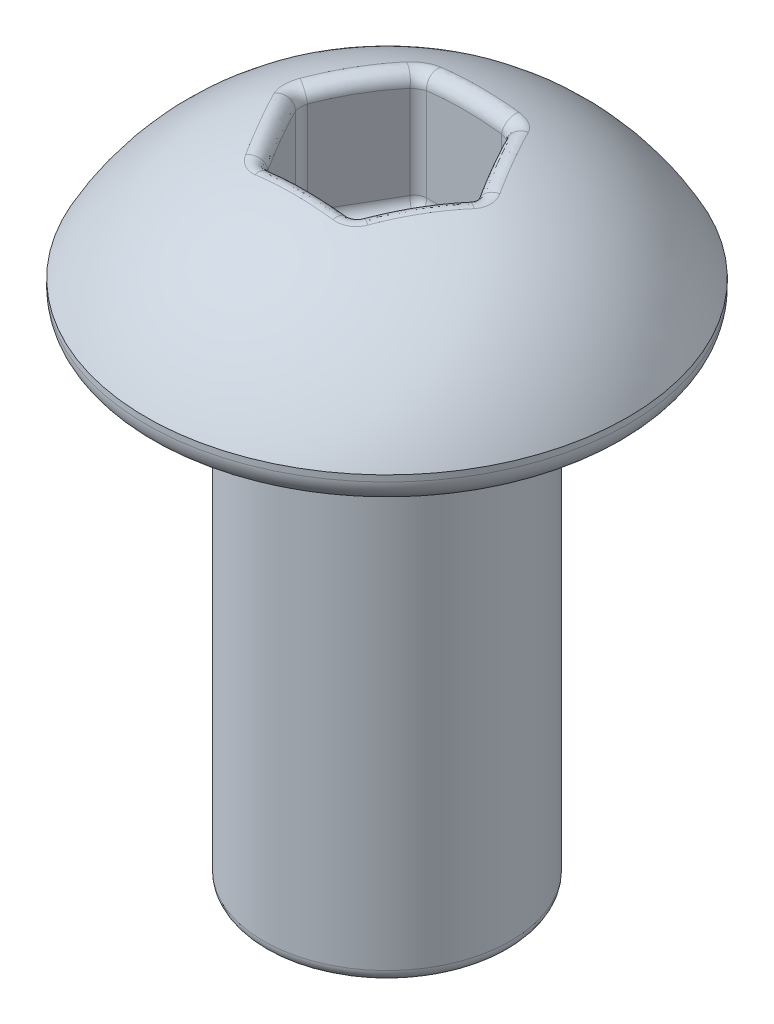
ISO-10303-21;
HEADER;
FILE_DESCRIPTION(('STEP AP214'),'2;1');
FILE_NAME('part.step','',(''),(''),'','','');
FILE_SCHEMA(('AUTOMOTIVE_DESIGN { 1 0 10303 214 1 1 1 1 }'));
ENDSEC;
DATA;
#1=APPLICATION_CONTEXT('core data for automotive mechanical design processes');
#2=APPLICATION_PROTOCOL_DEFINITION('international standard','automotive_design',2000,#1);
#3=PRODUCT_CONTEXT('',#1,'mechanical');
#4=PRODUCT('Part','Part','',(#3));
#5=PRODUCT_RELATED_PRODUCT_CATEGORY('part','',(#4));
#6=PRODUCT_DEFINITION_FORMATION('','',#4);
#7=PRODUCT_DEFINITION_CONTEXT('part definition',#1,'design');
#8=PRODUCT_DEFINITION('design','',#6,#7);
#9=PRODUCT_DEFINITION_SHAPE('','',#8);
#10=(LENGTH_UNIT() NAMED_UNIT(*) SI_UNIT(.MILLI.,.METRE.));
#11=(NAMED_UNIT(*) PLANE_ANGLE_UNIT() SI_UNIT($,.RADIAN.));
#12=(NAMED_UNIT(*) SI_UNIT($,.STERADIAN.) SOLID_ANGLE_UNIT());
#13=UNCERTAINTY_MEASURE_WITH_UNIT(LENGTH_MEASURE(1.E-05),#10,'distance_accuracy_value','');
#14=(GEOMETRIC_REPRESENTATION_CONTEXT(3) GLOBAL_UNCERTAINTY_ASSIGNED_CONTEXT((#13)) GLOBAL_UNIT_ASSIGNED_CONTEXT((#10,
#11,#12)) REPRESENTATION_CONTEXT('',''));
#15=CARTESIAN_POINT('',(0.,0.,0.));
#16=DIRECTION('',(0.,0.,1.));
#17=DIRECTION('',(1.,0.,0.));
#18=AXIS2_PLACEMENT_3D('',#15,#16,#17);
#19=CARTESIAN_POINT('',(0.,-1.40483557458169,0.));
#20=DIRECTION('',(0.,-1.,0.));
#21=DIRECTION('',(1.,0.,0.));
#22=AXIS2_PLACEMENT_3D('',#19,#20,#21);
#23=DEGENERATE_TOROIDAL_SURFACE('',#22,0.382671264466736,4.,.T.);
#24=CARTESIAN_POINT('',(0.,0.499999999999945,0.));
#25=DIRECTION('',(0.,-1.,0.));
#26=DIRECTION('',(1.,0.,0.));
#27=AXIS2_PLACEMENT_3D('',#24,#25,#26);
#28=CIRCLE('',#27,3.9);
#29=CARTESIAN_POINT('',(3.9,0.499999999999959,0.));
#30=VERTEX_POINT('',#29);
#31=EDGE_CURVE('E635',#30,#30,#28,.T.);
#32=ORIENTED_EDGE('',*,*,#31,.F.);
#33=EDGE_LOOP('',(#32));
#34=FACE_BOUND('',#33,.T.);
#35=CARTESIAN_POINT('',(0.80225286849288,2.22494840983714,1.08962631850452));
#36=CARTESIAN_POINT('',(0.792994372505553,2.47502003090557,1.1354289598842));
#37=CARTESIAN_POINT('',(1.03748979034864,2.41598967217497,1.17359733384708));
#38=CARTESIAN_POINT('',(0.800130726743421,2.22092681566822,1.10016747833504));
#39=CARTESIAN_POINT('',(0.788639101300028,2.47408201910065,1.14413494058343));
#40=CARTESIAN_POINT('',(1.03319383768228,2.4117564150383,1.19563735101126));
#41=CARTESIAN_POINT('',(0.797137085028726,2.21716295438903,1.11055944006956));
#42=CARTESIAN_POINT('',(0.783823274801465,2.47334294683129,1.15207870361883));
#43=CARTESIAN_POINT('',(1.02707222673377,2.40779445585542,1.21736065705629));
#44=CARTESIAN_POINT('',(0.789497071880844,2.21026593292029,1.13077496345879));
#45=CARTESIAN_POINT('',(0.773530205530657,2.47216795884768,1.16670382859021));
#46=CARTESIAN_POINT('',(1.01136582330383,2.40053443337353,1.2596087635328));
#47=CARTESIAN_POINT('',(0.784850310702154,2.20713292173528,1.14059839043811));
#48=CARTESIAN_POINT('',(0.768055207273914,2.4717369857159,1.17335474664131));
#49=CARTESIAN_POINT('',(1.00178021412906,2.3972365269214,1.28013328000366));
#50=CARTESIAN_POINT('',(0.77397082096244,2.20160233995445,1.15944421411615));
#51=CARTESIAN_POINT('',(0.756776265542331,2.47109906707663,1.18550632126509));
#52=CARTESIAN_POINT('',(0.979285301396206,2.3914148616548,1.31949677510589));
#53=CARTESIAN_POINT('',(0.767731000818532,2.19920816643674,1.16846277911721));
#54=CARTESIAN_POINT('',(0.75098278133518,2.47089626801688,1.1909736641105));
#55=CARTESIAN_POINT('',(0.966361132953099,2.38889467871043,1.33832769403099));
#56=CARTESIAN_POINT('',(0.753836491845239,2.19526686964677,1.18538255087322));
#57=CARTESIAN_POINT('',(0.739291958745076,2.47062328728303,1.20096446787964));
#58=CARTESIAN_POINT('',(0.937546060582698,2.3847459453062,1.37364181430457));
#59=CARTESIAN_POINT('',(0.746182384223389,2.1937193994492,1.19328421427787));
#60=CARTESIAN_POINT('',(0.733411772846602,2.4705544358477,1.20546616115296));
#61=CARTESIAN_POINT('',(0.921656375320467,2.38311702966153,1.39012597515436));
#62=CARTESIAN_POINT('',(0.729656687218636,2.1915315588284,1.20774500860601));
#63=CARTESIAN_POINT('',(0.721569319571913,2.4704718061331,1.21380986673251));
#64=CARTESIAN_POINT('',(0.887323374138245,2.38081403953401,1.42027498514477));
#65=CARTESIAN_POINT('',(0.720784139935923,2.19089190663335,1.21430307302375));
#66=CARTESIAN_POINT('',(0.715626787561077,2.47045843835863,1.21763445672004));
#67=CARTESIAN_POINT('',(0.868878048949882,2.38014072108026,1.43393759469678));
#68=CARTESIAN_POINT('',(0.702078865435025,2.19054838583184,1.22587378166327));
#69=CARTESIAN_POINT('',(0.703516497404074,2.47045010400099,1.22484326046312));
#70=CARTESIAN_POINT('',(0.829972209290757,2.37977912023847,1.45801871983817));
#71=CARTESIAN_POINT('',(0.692246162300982,2.19084449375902,1.23088646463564));
#72=CARTESIAN_POINT('',(0.697369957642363,2.47045516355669,1.22821448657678));
#73=CARTESIAN_POINT('',(0.809511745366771,2.38009081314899,1.46843731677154));
#74=CARTESIAN_POINT('',(0.671998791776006,2.19235333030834,1.23918639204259));
#75=CARTESIAN_POINT('',(0.684651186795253,2.470501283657,1.23456470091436));
#76=CARTESIAN_POINT('',(0.767366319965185,2.38167906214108,1.48565433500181));
#77=CARTESIAN_POINT('',(0.661590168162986,2.19355777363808,1.24248878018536));
#78=CARTESIAN_POINT('',(0.678106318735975,2.47054184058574,1.2375371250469));
#79=CARTESIAN_POINT('',(0.745694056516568,2.3829468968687,1.49248453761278));
#80=CARTESIAN_POINT('',(0.640403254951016,2.19682566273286,1.24735656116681));
#81=CARTESIAN_POINT('',(0.664287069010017,2.47072306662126,1.24302027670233));
#82=CARTESIAN_POINT('',(0.701570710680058,2.38638678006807,1.50250021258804));
#83=CARTESIAN_POINT('',(0.629624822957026,2.19888944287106,1.24892127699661));
#84=CARTESIAN_POINT('',(0.657038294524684,2.470862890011,1.24552507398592));
#85=CARTESIAN_POINT('',(0.679119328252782,2.38855918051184,1.50568426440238));
#86=CARTESIAN_POINT('',(0.607916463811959,2.2038170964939,1.25029007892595));
#87=CARTESIAN_POINT('',(0.641580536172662,2.47133696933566,1.2498303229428));
#88=CARTESIAN_POINT('',(0.633895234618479,2.39374618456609,1.5083578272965));
#89=CARTESIAN_POINT('',(0.596986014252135,2.20668722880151,1.25008000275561));
#90=CARTESIAN_POINT('',(0.633393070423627,2.47167040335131,1.25162573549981));
#91=CARTESIAN_POINT('',(0.611121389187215,2.39676737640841,1.50781762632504));
#92=CARTESIAN_POINT('',(0.575352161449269,2.21310977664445,1.2479051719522));
#93=CARTESIAN_POINT('',(0.616144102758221,2.47262377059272,1.2541134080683));
#94=CARTESIAN_POINT('',(0.566043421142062,2.40352795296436,1.50305641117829));
#95=CARTESIAN_POINT('',(0.564648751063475,2.21666217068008,1.24594047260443));
#96=CARTESIAN_POINT('',(0.60711138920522,2.47323944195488,1.25481529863));
#97=CARTESIAN_POINT('',(0.54373928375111,2.4072673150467,1.49883551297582));
#98=CARTESIAN_POINT('',(0.554205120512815,2.22050042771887,1.24311831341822));
#99=CARTESIAN_POINT('',(0.597594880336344,2.47404409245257,1.25480450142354));
#100=CARTESIAN_POINT('',(0.521975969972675,2.41130758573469,1.49281613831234));
#101=(BOUNDED_SURFACE() B_SPLINE_SURFACE(3,2,((#35,#36,#37),(#38,#39,#40),(#41,#42,#43),(#44,
#45,#46),(#47,#48,#49),(#50,#51,#52),(#53,#54,#55),(#56,#57,#58),(#59,#60,#61),(#62,#63,#64),
(#65,#66,#67),(#68,#69,#70),(#71,#72,#73),(#74,#75,#76),(#77,#78,#79),(#80,#81,#82),(#83,#84,
#85),(#86,#87,#88),(#89,#90,#91),(#92,#93,#94),(#95,#96,#97),(#98,#99,#100)),.UNSPECIFIED.,.F.,
.F.,.F.) B_SPLINE_SURFACE_WITH_KNOTS((4,2,2,2,2,2,2,2,2,2,4),(3,3),(0.,0.0655698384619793,
0.131155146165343,0.197037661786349,0.262893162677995,0.3288007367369,0.394706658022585,
0.460018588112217,0.525355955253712,0.591215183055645,0.6570723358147),(0.,1.),
.UNSPECIFIED.) GEOMETRIC_REPRESENTATION_ITEM() RATIONAL_B_SPLINE_SURFACE(((1.,0.618039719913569,
1.),(1.,0.61387587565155,1.),(1.,0.609937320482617,1.),(1.,0.602664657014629,1.),(1.,
0.599330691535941,1.),(1.,0.593409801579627,1.),(1.,0.59082633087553,1.),(1.,0.586556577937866,
1.),(1.,0.584869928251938,1.),(1.,0.58248135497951,1.),(1.,0.581780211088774,1.),(1.,
0.581403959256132,1.),(1.,0.581728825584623,1.),(1.,0.583378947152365,1.),(1.,0.58469515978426,
1.),(1.,0.588247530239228,1.),(1.,0.590484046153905,1.),(1.,0.595785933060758,1.),(1.,
0.598857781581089,1.),(1.,0.605672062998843,1.),(1.,0.609414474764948,1.),(1.,0.613417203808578,1.))) REPRESENTATION_ITEM('') SURFACE());
#102=CARTESIAN_POINT('',(0.521975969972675,2.41130758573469,1.49281613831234));
#103=CARTESIAN_POINT('',(0.54373928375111,2.4072673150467,1.49883551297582));
#104=CARTESIAN_POINT('',(0.566043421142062,2.40352795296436,1.50305641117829));
#105=CARTESIAN_POINT('',(0.611121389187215,2.39676737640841,1.50781762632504));
#106=CARTESIAN_POINT('',(0.633895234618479,2.39374618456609,1.5083578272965));
#107=CARTESIAN_POINT('',(0.679119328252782,2.38855918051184,1.50568426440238));
#108=CARTESIAN_POINT('',(0.701570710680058,2.38638678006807,1.50250021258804));
#109=CARTESIAN_POINT('',(0.745694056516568,2.3829468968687,1.49248453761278));
#110=CARTESIAN_POINT('',(0.767366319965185,2.38167906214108,1.48565433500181));
#111=CARTESIAN_POINT('',(0.809511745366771,2.38009081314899,1.46843731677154));
#112=CARTESIAN_POINT('',(0.829972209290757,2.37977912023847,1.45801871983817));
#113=CARTESIAN_POINT('',(0.868878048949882,2.38014072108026,1.43393759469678));
#114=CARTESIAN_POINT('',(0.887323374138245,2.38081403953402,1.42027498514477));
#115=CARTESIAN_POINT('',(0.921656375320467,2.38311702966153,1.39012597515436));
#116=CARTESIAN_POINT('',(0.937546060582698,2.3847459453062,1.37364181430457));
#117=CARTESIAN_POINT('',(0.966361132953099,2.38889467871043,1.33832769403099));
#118=CARTESIAN_POINT('',(0.979285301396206,2.3914148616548,1.31949677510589));
#119=CARTESIAN_POINT('',(1.00178021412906,2.3972365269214,1.28013328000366));
#120=CARTESIAN_POINT('',(1.01136582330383,2.40053443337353,1.2596087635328));
#121=CARTESIAN_POINT('',(1.02707222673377,2.40779445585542,1.21736065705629));
#122=CARTESIAN_POINT('',(1.03319383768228,2.4117564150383,1.19563735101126));
#123=CARTESIAN_POINT('',(1.03748979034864,2.41598967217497,1.17359733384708));
#124=B_SPLINE_CURVE_WITH_KNOTS('',3,(#102,#103,#104,#105,#106,#107,#108,#109,#110,#111,#112,
#113,#114,#115,#116,#117,#118,#119,#120,#121,#122,#123),.UNSPECIFIED.,.F.,.F.,(4,2,2,2,2,2,2,2,
2,2,4),(0.,0.0658571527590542,0.131716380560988,0.197053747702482,0.262365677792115,
0.328271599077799,0.394179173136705,0.460034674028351,0.525917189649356,0.59150249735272,
0.6570723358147),.UNSPECIFIED.);
#125=CARTESIAN_POINT('',(0.630355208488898,2.39433227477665,1.50773381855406));
#126=VERTEX_POINT('',#125);
#127=CARTESIAN_POINT('',(0.990558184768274,2.39433227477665,1.29977053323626));
#128=VERTEX_POINT('',#127);
#129=EDGE_CURVE('E762',#126,#128,#124,.T.);
#130=ORIENTED_EDGE('',*,*,#129,.F.);
#131=CARTESIAN_POINT('',(1.5825878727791,1.9610549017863,1.25));
#132=CARTESIAN_POINT('',(1.68229510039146,2.2191246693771,1.25));
#133=CARTESIAN_POINT('',(1.65103195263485,2.13820703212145,1.51270989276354));
#134=CARTESIAN_POINT('',(1.48468181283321,1.99890158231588,1.25));
#135=CARTESIAN_POINT('',(1.57733935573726,2.25894578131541,1.25));
#136=CARTESIAN_POINT('',(1.54839880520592,2.17804564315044,1.51225685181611));
#137=CARTESIAN_POINT('',(1.38530075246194,2.03271678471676,1.25));
#138=CARTESIAN_POINT('',(1.47078384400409,2.29441622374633,1.25));
#139=CARTESIAN_POINT('',(1.44427208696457,2.2136405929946,1.5117610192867));
#140=CARTESIAN_POINT('',(1.18425424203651,2.09248392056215,1.25));
#141=CARTESIAN_POINT('',(1.25559846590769,2.35675122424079,1.25));
#142=CARTESIAN_POINT('',(1.23380907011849,2.27655336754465,1.51072161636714));
#143=CARTESIAN_POINT('',(1.08259003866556,2.11844003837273,1.25));
#144=CARTESIAN_POINT('',(1.14701274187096,2.3836422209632,1.25));
#145=CARTESIAN_POINT('',(1.12747397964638,2.30387559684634,1.5101780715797));
#146=CARTESIAN_POINT('',(0.776068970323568,2.18464430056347,1.25));
#147=CARTESIAN_POINT('',(0.820838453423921,2.45157572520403,1.25));
#148=CARTESIAN_POINT('',(0.807259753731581,2.37356429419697,1.50853741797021));
#149=CARTESIAN_POINT('',(0.568660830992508,2.21361392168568,1.25));
#150=CARTESIAN_POINT('',(0.600536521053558,2.48072990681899,1.25));
#151=CARTESIAN_POINT('',(0.591097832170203,2.40405863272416,1.50742484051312));
#152=CARTESIAN_POINT('',(0.30062101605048,2.23340321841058,1.25));
#153=CARTESIAN_POINT('',(0.317016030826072,2.50043208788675,1.25));
#154=CARTESIAN_POINT('',(0.312341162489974,2.42488947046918,1.50658191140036));
#155=CARTESIAN_POINT('',(0.240614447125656,2.23669997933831,1.25));
#156=CARTESIAN_POINT('',(0.253676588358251,2.50369293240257,1.25));
#157=CARTESIAN_POINT('',(0.249973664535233,2.42835974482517,1.50643140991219));
#158=CARTESIAN_POINT('',(0.120500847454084,2.24109180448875,1.25));
#159=CARTESIAN_POINT('',(0.127012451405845,2.5080285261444,1.25));
#160=CARTESIAN_POINT('',(0.12517022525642,2.43298271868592,1.50622769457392));
#161=CARTESIAN_POINT('',(0.0603938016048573,2.24218650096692,1.25));
#162=CARTESIAN_POINT('',(0.0636448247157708,2.50910592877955,1.25));
#163=CARTESIAN_POINT('',(0.0627342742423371,2.43413503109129,1.50617449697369));
#164=CARTESIAN_POINT('',(-0.124942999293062,2.24220310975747,1.25));
#165=CARTESIAN_POINT('',(-0.131669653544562,2.50912529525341,1.25));
#166=CARTESIAN_POINT('',(-0.129784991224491,2.43415251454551,1.50617665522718));
#167=CARTESIAN_POINT('',(-0.250191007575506,2.2374871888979,1.25));
#168=CARTESIAN_POINT('',(-0.263869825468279,2.50448722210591,1.25));
#169=CARTESIAN_POINT('',(-0.259888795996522,2.42918838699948,1.50641200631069));
#170=CARTESIAN_POINT('',(-0.499965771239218,2.21828107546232,1.25));
#171=CARTESIAN_POINT('',(-0.527718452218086,2.48538380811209,1.25));
#172=CARTESIAN_POINT('',(-0.519662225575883,2.40897142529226,1.507221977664));
#173=CARTESIAN_POINT('',(-0.624492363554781,2.20378875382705,1.25));
#174=CARTESIAN_POINT('',(-0.659680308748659,2.47086560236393,1.25));
#175=CARTESIAN_POINT('',(-0.649331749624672,2.39371635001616,1.50779667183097));
#176=CARTESIAN_POINT('',(-0.872466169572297,2.16420424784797,1.25));
#177=CARTESIAN_POINT('',(-0.923053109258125,2.43068633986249,1.25));
#178=CARTESIAN_POINT('',(-0.907937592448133,2.35204844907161,1.50904113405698));
#179=CARTESIAN_POINT('',(-0.995905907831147,2.13906419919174,1.25));
#180=CARTESIAN_POINT('',(-1.05454241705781,2.40491217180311,1.25));
#181=CARTESIAN_POINT('',(-1.03686790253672,2.32558523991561,1.50971132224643));
#182=CARTESIAN_POINT('',(-1.24006641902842,2.07763690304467,1.25));
#183=CARTESIAN_POINT('',(-1.31537060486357,2.34132227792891,1.25));
#184=CARTESIAN_POINT('',(-1.29219136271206,2.26092492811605,1.51102010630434));
#185=CARTESIAN_POINT('',(-1.36078507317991,2.04134127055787,1.25));
#186=CARTESIAN_POINT('',(-1.44467062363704,2.30344731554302,1.25));
#187=CARTESIAN_POINT('',(-1.41858252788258,2.22271899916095,1.51165867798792));
#188=CARTESIAN_POINT('',(-1.47951759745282,1.99921553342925,1.25));
#189=CARTESIAN_POINT('',(-1.57167076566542,2.25928023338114,1.25));
#190=CARTESIAN_POINT('',(-1.5430026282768,2.17837611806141,1.51221845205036));
#191=(BOUNDED_SURFACE() B_SPLINE_SURFACE(3,2,((#131,#132,#133),(#134,#135,#136),(#137,#138,
#139),(#140,#141,#142),(#143,#144,#145),(#146,#147,#148),(#149,#150,#151),(#152,#153,#154),
(#155,#156,#157),(#158,#159,#160),(#161,#162,#163),(#164,#165,#166),(#167,#168,#169),(#170,#171,
#172),(#173,#174,#175),(#176,#177,#178),(#179,#180,#181),(#182,#183,#184),(#185,#186,#187),
(#188,#189,#190)),.UNSPECIFIED.,.F.,.F.,.F.) B_SPLINE_SURFACE_WITH_KNOTS((4,2,2,2,2,2,2,2,2,4),
(3,3),(0.,0.314674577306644,0.629181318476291,1.25494831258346,1.43522970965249,
1.61554121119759,1.99115984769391,2.36686031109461,2.74426787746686,3.12195981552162),(0.,1.),
.UNSPECIFIED.) GEOMETRIC_REPRESENTATION_ITEM() RATIONAL_B_SPLINE_SURFACE(((1.,0.585854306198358,
1.),(1.,0.586820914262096,1.),(1.,0.587876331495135,1.),(1.,0.590082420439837,1.),(1.,
0.591233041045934,1.),(1.,0.594694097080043,1.),(1.,0.59702538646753,1.),(1.,0.598786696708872,
1.),(1.,0.599100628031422,1.),(1.,0.599525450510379,1.),(1.,0.599636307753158,1.),(1.,
0.599631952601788,1.),(1.,0.599141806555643,1.),(1.,0.597449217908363,1.),(1.,0.596246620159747,
1.),(1.,0.593631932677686,1.),(1.,0.592218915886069,1.),(1.,0.589450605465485,1.),(1.,
0.5880953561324,1.),(1.,0.586901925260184,1.))) REPRESENTATION_ITEM('') SURFACE());
#192=CARTESIAN_POINT('',(1.65103195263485,2.13820703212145,1.51270989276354));
#193=CARTESIAN_POINT('',(1.54839880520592,2.17804564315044,1.51225685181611));
#194=CARTESIAN_POINT('',(1.44427208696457,2.2136405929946,1.5117610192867));
#195=CARTESIAN_POINT('',(1.23380907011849,2.27655336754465,1.51072161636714));
#196=CARTESIAN_POINT('',(1.12747397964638,2.30387559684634,1.5101780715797));
#197=CARTESIAN_POINT('',(0.807259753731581,2.37356429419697,1.50853741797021));
#198=CARTESIAN_POINT('',(0.591097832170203,2.40405863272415,1.50742484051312));
#199=CARTESIAN_POINT('',(0.312341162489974,2.42488947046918,1.50658191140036));
#200=CARTESIAN_POINT('',(0.249973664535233,2.42835974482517,1.50643140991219));
#201=CARTESIAN_POINT('',(0.12517022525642,2.43298271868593,1.50622769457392));
#202=CARTESIAN_POINT('',(0.0627342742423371,2.43413503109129,1.50617449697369));
#203=CARTESIAN_POINT('',(-0.129784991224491,2.43415251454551,1.50617665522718));
#204=CARTESIAN_POINT('',(-0.259888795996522,2.42918838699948,1.50641200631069));
#205=CARTESIAN_POINT('',(-0.519662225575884,2.40897142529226,1.507221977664));
#206=CARTESIAN_POINT('',(-0.649331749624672,2.39371635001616,1.50779667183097));
#207=CARTESIAN_POINT('',(-0.907937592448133,2.35204844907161,1.50904113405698));
#208=CARTESIAN_POINT('',(-1.03686790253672,2.32558523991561,1.50971132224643));
#209=CARTESIAN_POINT('',(-1.29219136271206,2.26092492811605,1.51102010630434));
#210=CARTESIAN_POINT('',(-1.41858252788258,2.22271899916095,1.51165867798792));
#211=CARTESIAN_POINT('',(-1.5430026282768,2.17837611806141,1.51221845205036));
#212=B_SPLINE_CURVE_WITH_KNOTS('',3,(#192,#193,#194,#195,#196,#197,#198,#199,#200,#201,#202,
#203,#204,#205,#206,#207,#208,#209,#210,#211),.UNSPECIFIED.,.F.,.F.,(4,2,2,2,2,2,2,2,2,4),(0.,
0.314674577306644,0.629181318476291,1.25494831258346,1.43522970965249,1.61554121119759,
1.99115984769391,2.36686031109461,2.74426787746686,3.12195981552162),.UNSPECIFIED.);
#213=CARTESIAN_POINT('',(-0.630355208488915,2.39433227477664,1.50773381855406));
#214=VERTEX_POINT('',#213);
#215=EDGE_CURVE('E765',#126,#214,#212,.T.);
#216=ORIENTED_EDGE('',*,*,#215,.T.);
#217=CARTESIAN_POINT('',(-0.542686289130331,2.2248819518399,1.23964110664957));
#218=CARTESIAN_POINT('',(-0.586972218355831,2.4750046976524,1.25447729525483));
#219=CARTESIAN_POINT('',(-0.497971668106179,2.4159197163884,1.48541150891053));
#220=CARTESIAN_POINT('',(-0.552851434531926,2.22087427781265,1.24305533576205));
#221=CARTESIAN_POINT('',(-0.5966589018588,2.47407135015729,1.25504835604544));
#222=CARTESIAN_POINT('',(-0.519155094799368,2.41170111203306,1.49267198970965));
#223=CARTESIAN_POINT('',(-0.563320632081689,2.21712326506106,1.24564459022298));
#224=CARTESIAN_POINT('',(-0.60591770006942,2.47333566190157,1.2548447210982));
#225=CARTESIAN_POINT('',(-0.540971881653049,2.40775267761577,1.49820220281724));
#226=CARTESIAN_POINT('',(-0.584590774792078,2.21024872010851,1.24911689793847));
#227=CARTESIAN_POINT('',(-0.623676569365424,2.47216559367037,1.25324097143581));
#228=CARTESIAN_POINT('',(-0.585294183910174,2.40051631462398,1.50568369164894));
#229=CARTESIAN_POINT('',(-0.595391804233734,2.20712534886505,1.24999951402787));
#230=CARTESIAN_POINT('',(-0.632149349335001,2.47173611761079,1.25182768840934));
#231=CARTESIAN_POINT('',(-0.607799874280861,2.39722855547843,1.50763405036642));
#232=CARTESIAN_POINT('',(-0.61712267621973,2.20160235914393,1.25000048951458));
#233=CARTESIAN_POINT('',(-0.648290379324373,2.47109907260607,1.24814064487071));
#234=CARTESIAN_POINT('',(-0.653074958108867,2.39141488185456,1.5078343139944));
#235=CARTESIAN_POINT('',(-0.628052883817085,2.19920818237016,1.24910594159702));
#236=CARTESIAN_POINT('',(-0.655922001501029,2.47089627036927,1.24585701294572));
#237=CARTESIAN_POINT('',(-0.675845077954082,2.38889469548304,1.50605714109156));
#238=CARTESIAN_POINT('',(-0.649653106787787,2.19526687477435,1.24553284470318));
#239=CARTESIAN_POINT('',(-0.670419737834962,2.47062328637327,1.24072786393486));
#240=CARTESIAN_POINT('',(-0.72083557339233,2.38474595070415,1.49875964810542));
#241=CARTESIAN_POINT('',(-0.660323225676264,2.1937194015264,1.24285501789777));
#242=CARTESIAN_POINT('',(-0.677258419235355,2.47055443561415,1.23788631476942));
#243=CARTESIAN_POINT('',(-0.743056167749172,2.38311703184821,1.49324084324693));
#244=CARTESIAN_POINT('',(-0.681109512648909,2.19153155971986,1.23577373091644));
#245=CARTESIAN_POINT('',(-0.690405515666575,2.4704718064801,1.23180229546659));
#246=CARTESIAN_POINT('',(-0.786332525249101,2.38081404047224,1.47858207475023));
#247=CARTESIAN_POINT('',(-0.691225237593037,2.19089190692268,1.23136891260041));
#248=CARTESIAN_POINT('',(-0.696688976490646,2.47045843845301,1.22856820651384));
#249=CARTESIAN_POINT('',(-0.807387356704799,2.38014072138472,1.4694392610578));
#250=CARTESIAN_POINT('',(-0.710598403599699,2.19054838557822,1.22095502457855));
#251=CARTESIAN_POINT('',(-0.708987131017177,2.47045010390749,1.22168478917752));
#252=CARTESIAN_POINT('',(-0.847695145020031,2.37977911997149,1.44778637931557));
#253=CARTESIAN_POINT('',(-0.719855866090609,2.19084449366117,1.21494599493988));
#254=CARTESIAN_POINT('',(-0.714979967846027,2.47045516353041,1.21804734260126));
#255=CARTESIAN_POINT('',(-0.866948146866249,2.38009081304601,1.43527639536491));
#256=CARTESIAN_POINT('',(-0.737167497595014,2.19235333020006,1.20156122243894));
#257=CARTESIAN_POINT('',(-0.726838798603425,2.47050128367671,1.21020767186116));
#258=CARTESIAN_POINT('',(-0.902931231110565,2.38167906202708,1.40738589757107));
#259=CARTESIAN_POINT('',(-0.745231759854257,2.19355777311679,1.19419828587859));
#260=CARTESIAN_POINT('',(-0.732685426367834,2.47054184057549,1.20602586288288));
#261=CARTESIAN_POINT('',(-0.919682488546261,2.38294689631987,1.3920322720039));
#262=CARTESIAN_POINT('',(-0.760040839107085,2.19682566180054,1.17828377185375));
#263=CARTESIAN_POINT('',(-0.744343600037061,2.47072306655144,1.19679961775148));
#264=CARTESIAN_POINT('',(-0.950417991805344,2.38638677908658,1.35882817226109));
#265=CARTESIAN_POINT('',(-0.766785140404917,2.19888944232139,1.16973173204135));
#266=CARTESIAN_POINT('',(-0.750137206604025,2.47086288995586,1.19177439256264));
#267=CARTESIAN_POINT('',(-0.964401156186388,2.38855917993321,1.34097672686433));
#268=CARTESIAN_POINT('',(-0.778824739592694,2.20381709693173,1.15161613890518));
#269=CARTESIAN_POINT('',(-0.76159454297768,2.47133696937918,1.18054020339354));
#270=CARTESIAN_POINT('',(-0.989328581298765,2.393746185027,1.30314828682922));
#271=CARTESIAN_POINT('',(-0.78410803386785,2.20668722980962,1.14204505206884));
#272=CARTESIAN_POINT('',(-0.767243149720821,2.47167040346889,1.17434735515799));
#273=CARTESIAN_POINT('',(-1.00024767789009,2.3967673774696,1.28315545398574));
#274=CARTESIAN_POINT('',(-0.793041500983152,2.21310977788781,1.12222217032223));
#275=CARTESIAN_POINT('',(-0.778022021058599,2.47262377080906,1.16065314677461));
#276=CARTESIAN_POINT('',(-1.01866332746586,2.40352795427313,1.24173618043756));
#277=CARTESIAN_POINT('',(-0.796691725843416,2.21666217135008,1.11197039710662));
#278=CARTESIAN_POINT('',(-0.783146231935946,2.47323944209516,1.15318153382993));
#279=CARTESIAN_POINT('',(-1.02615998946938,2.40726731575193,1.22030978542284));
#280=CARTESIAN_POINT('',(-0.799469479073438,2.22050042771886,1.10151486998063));
#281=CARTESIAN_POINT('',(-0.787895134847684,2.47404409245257,1.14493459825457));
#282=CARTESIAN_POINT('',(-1.03182871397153,2.41130758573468,1.19845251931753));
#283=(BOUNDED_SURFACE() B_SPLINE_SURFACE(3,2,((#217,#218,#219),(#220,#221,#222),(#223,#224,
#225),(#226,#227,#228),(#229,#230,#231),(#232,#233,#234),(#235,#236,#237),(#238,#239,#240),
(#241,#242,#243),(#244,#245,#246),(#247,#248,#249),(#250,#251,#252),(#253,#254,#255),(#256,#257,
#258),(#259,#260,#261),(#262,#263,#264),(#265,#266,#267),(#268,#269,#270),(#271,#272,#273),
(#274,#275,#276),(#277,#278,#279),(#280,#281,#282)),.UNSPECIFIED.,.F.,.F.,
.F.) B_SPLINE_SURFACE_WITH_KNOTS((4,2,2,2,2,2,2,2,2,2,4),(3,3),(0.,0.0653888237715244,
0.130794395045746,0.196676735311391,0.26253241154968,0.328439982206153,0.394345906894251,
0.459657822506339,0.52499520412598,0.590854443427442,0.656711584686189),(0.,1.),
.UNSPECIFIED.) GEOMETRIC_REPRESENTATION_ITEM() RATIONAL_B_SPLINE_SURFACE(((1.,0.617970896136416,
1.),(1.,0.613821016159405,1.),(1.,0.609895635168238,1.),(1.,0.602646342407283,1.),(1.,
0.599322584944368,1.),(1.,0.593409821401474,1.),(1.,0.590826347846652,1.),(1.,0.586556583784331,
1.),(1.,0.584869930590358,1.),(1.,0.582481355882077,1.),(1.,0.581780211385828,1.),(1.,
0.581403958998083,1.),(1.,0.581728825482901,1.),(1.,0.583378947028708,1.),(1.,0.584695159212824,
1.),(1.,0.588247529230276,1.),(1.,0.590484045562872,1.),(1.,0.595785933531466,1.),(1.,
0.598857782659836,1.),(1.,0.605672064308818,1.),(1.,0.609414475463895,1.),(1.,0.613417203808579,1.))) REPRESENTATION_ITEM('') SURFACE());
#284=CARTESIAN_POINT('',(-1.03182871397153,2.41130758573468,1.19845251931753));
#285=CARTESIAN_POINT('',(-1.02615998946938,2.40726731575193,1.22030978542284));
#286=CARTESIAN_POINT('',(-1.01866332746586,2.40352795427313,1.24173618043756));
#287=CARTESIAN_POINT('',(-1.00024767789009,2.3967673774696,1.28315545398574));
#288=CARTESIAN_POINT('',(-0.989328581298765,2.393746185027,1.30314828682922));
#289=CARTESIAN_POINT('',(-0.964401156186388,2.38855917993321,1.34097672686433));
#290=CARTESIAN_POINT('',(-0.950417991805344,2.38638677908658,1.35882817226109));
#291=CARTESIAN_POINT('',(-0.919682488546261,2.38294689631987,1.3920322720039));
#292=CARTESIAN_POINT('',(-0.902931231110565,2.38167906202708,1.40738589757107));
#293=CARTESIAN_POINT('',(-0.866948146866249,2.38009081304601,1.43527639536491));
#294=CARTESIAN_POINT('',(-0.847695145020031,2.37977911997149,1.44778637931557));
#295=CARTESIAN_POINT('',(-0.807387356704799,2.38014072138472,1.4694392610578));
#296=CARTESIAN_POINT('',(-0.786332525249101,2.38081404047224,1.47858207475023));
#297=CARTESIAN_POINT('',(-0.743056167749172,2.38311703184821,1.49324084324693));
#298=CARTESIAN_POINT('',(-0.72083557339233,2.38474595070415,1.49875964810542));
#299=CARTESIAN_POINT('',(-0.675845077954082,2.38889469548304,1.50605714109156));
#300=CARTESIAN_POINT('',(-0.653074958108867,2.39141488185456,1.5078343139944));
#301=CARTESIAN_POINT('',(-0.607799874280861,2.39722855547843,1.50763405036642));
#302=CARTESIAN_POINT('',(-0.585294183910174,2.40051631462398,1.50568369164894));
#303=CARTESIAN_POINT('',(-0.540971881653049,2.40775267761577,1.49820220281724));
#304=CARTESIAN_POINT('',(-0.519155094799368,2.41170111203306,1.49267198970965));
#305=CARTESIAN_POINT('',(-0.497971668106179,2.4159197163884,1.48541150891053));
#306=B_SPLINE_CURVE_WITH_KNOTS('',3,(#284,#285,#286,#287,#288,#289,#290,#291,#292,#293,#294,
#295,#296,#297,#298,#299,#300,#301,#302,#303,#304,#305),.UNSPECIFIED.,.F.,.F.,(4,2,2,2,2,2,2,2,
2,2,4),(0.,0.0658571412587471,0.131716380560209,0.19705376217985,0.262365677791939,
0.328271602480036,0.394179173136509,0.460034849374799,0.525917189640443,0.591322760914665,
0.656711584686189),.UNSPECIFIED.);
#307=CARTESIAN_POINT('',(-0.990558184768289,2.39433227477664,1.29977053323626));
#308=VERTEX_POINT('',#307);
#309=EDGE_CURVE('E769',#308,#214,#306,.T.);
#310=ORIENTED_EDGE('',*,*,#309,.F.);
#311=CARTESIAN_POINT('',(-0.291353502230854,1.96114428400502,1.99536093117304));
#312=CARTESIAN_POINT('',(-0.241508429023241,2.21921887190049,2.08169513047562));
#313=CARTESIAN_POINT('',(-0.484649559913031,2.13830111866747,2.18597996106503));
#314=CARTESIAN_POINT('',(-0.340308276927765,1.998985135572,1.9105687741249));
#315=CARTESIAN_POINT('',(-0.293988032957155,2.25903357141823,1.99079779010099));
#316=CARTESIAN_POINT('',(-0.535575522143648,2.17813359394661,2.09686742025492));
#317=CARTESIAN_POINT('',(-0.390000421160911,2.0327944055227,1.82449945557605));
#318=CARTESIAN_POINT('',(-0.347267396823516,2.29449749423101,1.8985152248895));
#319=CARTESIAN_POINT('',(-0.587211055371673,2.21372229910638,2.00644026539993));
#320=CARTESIAN_POINT('',(-0.490526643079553,2.0925496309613,1.65038293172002));
#321=CARTESIAN_POINT('',(-0.454862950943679,2.35681945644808,1.71215425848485));
#322=CARTESIAN_POINT('',(-0.691545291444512,2.27662253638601,1.82364906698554));
#323=CARTESIAN_POINT('',(-0.541360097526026,2.11849977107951,1.56233680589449));
#324=CARTESIAN_POINT('',(-0.509157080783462,2.38370394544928,1.61811406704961));
#325=CARTESIAN_POINT('',(-0.744243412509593,2.30393847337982,1.7312860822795));
#326=CARTESIAN_POINT('',(-0.694624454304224,2.18468639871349,1.29687515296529));
#327=CARTESIAN_POINT('',(-0.672247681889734,2.45161846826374,1.3356328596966));
#328=CARTESIAN_POINT('',(-0.902933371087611,2.37360860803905,1.4531456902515));
#329=CARTESIAN_POINT('',(-0.798330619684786,2.21364448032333,1.11725080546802));
#330=CARTESIAN_POINT('',(-0.782400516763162,2.48076050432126,1.14484255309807));
#331=CARTESIAN_POINT('',(-1.01005285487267,2.40409079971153,1.26538440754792));
#332=CARTESIAN_POINT('',(-0.932353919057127,2.23341948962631,0.88511564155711));
#333=CARTESIAN_POINT('',(-0.924163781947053,2.50044820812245,0.899301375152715));
#334=CARTESIAN_POINT('',(-1.14870492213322,2.42490659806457,1.02354708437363));
#335=CARTESIAN_POINT('',(-0.962358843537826,2.2367131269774,0.833145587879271));
#336=CARTESIAN_POINT('',(-0.955835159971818,2.5037059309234,0.844444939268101));
#337=CARTESIAN_POINT('',(-1.17976010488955,2.42837358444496,0.969457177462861));
#338=CARTESIAN_POINT('',(-1.02241885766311,2.24109852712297,0.729118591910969));
#339=CARTESIAN_POINT('',(-1.01917051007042,2.50803515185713,0.734744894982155));
#340=CARTESIAN_POINT('',(-1.24198892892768,2.43298979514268,0.861266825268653));
#341=CARTESIAN_POINT('',(-1.05247395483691,2.24218992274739,0.677061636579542));
#342=CARTESIAN_POINT('',(-1.05085595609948,2.50910930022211,0.679864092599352));
#343=CARTESIAN_POINT('',(-1.2731625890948,2.43413863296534,0.807166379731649));
#344=CARTESIAN_POINT('',(-1.1451439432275,2.24219600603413,0.516552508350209));
#345=CARTESIAN_POINT('',(-1.14851492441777,2.50911829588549,0.510713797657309));
#346=CARTESIAN_POINT('',(-1.36942617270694,2.43414503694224,0.640438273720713));
#347=CARTESIAN_POINT('',(-1.20776785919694,2.23747296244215,0.408084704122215));
#348=CARTESIAN_POINT('',(-1.21461503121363,2.50447317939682,0.396225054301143));
#349=CARTESIAN_POINT('',(-1.43468216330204,2.42917341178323,0.527882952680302));
#350=CARTESIAN_POINT('',(-1.33265475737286,2.21825212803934,0.191774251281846));
#351=CARTESIAN_POINT('',(-1.34653927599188,2.48535488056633,0.167725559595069));
#352=CARTESIAN_POINT('',(-1.56527047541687,2.4089409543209,0.303318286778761));
#353=CARTESIAN_POINT('',(-1.39491765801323,2.2037522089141,0.0839317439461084));
#354=CARTESIAN_POINT('',(-1.41252003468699,2.47082880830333,0.0534435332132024));
#355=CARTESIAN_POINT('',(-1.63060281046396,2.39367788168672,0.191309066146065));
#356=CARTESIAN_POINT('',(-1.51890349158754,2.16415189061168,-0.130818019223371));
#357=CARTESIAN_POINT('',(-1.54420588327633,2.4306328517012,-0.174643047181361));
#358=CARTESIAN_POINT('',(-1.76098277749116,2.35199333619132,-0.0320264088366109));
#359=CARTESIAN_POINT('',(-1.58062268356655,2.13900360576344,-0.237718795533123));
#360=CARTESIAN_POINT('',(-1.60995007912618,2.40484983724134,-0.288515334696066));
#361=CARTESIAN_POINT('',(-1.82602776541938,2.32552145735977,-0.143347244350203));
#362=CARTESIAN_POINT('',(-1.70270115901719,2.07755945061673,-0.449164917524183));
#363=CARTESIAN_POINT('',(-1.74036275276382,2.34124165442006,-0.514396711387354));
#364=CARTESIAN_POINT('',(-1.95482125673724,2.26084339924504,-0.363806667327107));
#365=CARTESIAN_POINT('',(-1.76305938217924,2.04125519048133,-0.553708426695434));
#366=CARTESIAN_POINT('',(-1.80501176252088,2.30335726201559,-0.626372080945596));
#367=CARTESIAN_POINT('',(-2.0185687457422,2.22262838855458,-0.472943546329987));
#368=CARTESIAN_POINT('',(-1.8224242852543,1.99912074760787,-0.656531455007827));
#369=CARTESIAN_POINT('',(-1.86851059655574,2.25918065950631,-0.736355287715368));
#370=CARTESIAN_POINT('',(-2.08126216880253,2.17827634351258,-0.580412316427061));
#371=(BOUNDED_SURFACE() B_SPLINE_SURFACE(3,2,((#311,#312,#313),(#314,#315,#316),(#317,#318,
#319),(#320,#321,#322),(#323,#324,#325),(#326,#327,#328),(#329,#330,#331),(#332,#333,#334),
(#335,#336,#337),(#338,#339,#340),(#341,#342,#343),(#344,#345,#346),(#347,#348,#349),(#350,#351,
#352),(#353,#354,#355),(#356,#357,#358),(#359,#360,#361),(#362,#363,#364),(#365,#366,#367),
(#368,#369,#370)),.UNSPECIFIED.,.F.,.F.,.F.) B_SPLINE_SURFACE_WITH_KNOTS((4,2,2,2,2,2,2,2,2,4),
(3,3),(0.,0.314678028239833,0.629188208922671,1.25496303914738,1.43525374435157,
1.61557450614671,1.99119339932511,2.36689408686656,2.74430254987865,3.12199553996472),(0.,1.),
.UNSPECIFIED.) GEOMETRIC_REPRESENTATION_ITEM() RATIONAL_B_SPLINE_SURFACE(((1.,0.585856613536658,
1.),(1.,0.586823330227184,1.),(1.,0.587878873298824,1.),(1.,0.590085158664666,1.),(1.,
0.591235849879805,1.),(1.,0.59469690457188,1.),(1.,0.597027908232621,1.),(1.,0.598788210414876,
1.),(1.,0.599101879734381,1.),(1.,0.599526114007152,1.),(1.,0.599636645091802,1.),(1.,
0.59963125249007,1.),(1.,0.599140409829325,1.),(1.,0.597446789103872,1.),(1.,0.596243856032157,
1.),(1.,0.593628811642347,1.),(1.,0.592215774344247,1.),(1.,0.589447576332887,1.),(1.,
0.588092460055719,1.),(1.,0.586899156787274,1.))) REPRESENTATION_ITEM('') SURFACE());
#372=CARTESIAN_POINT('',(-0.484649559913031,2.13830111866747,2.18597996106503));
#373=CARTESIAN_POINT('',(-0.535575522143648,2.17813359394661,2.09686742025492));
#374=CARTESIAN_POINT('',(-0.587211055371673,2.21372229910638,2.00644026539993));
#375=CARTESIAN_POINT('',(-0.691545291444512,2.27662253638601,1.82364906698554));
#376=CARTESIAN_POINT('',(-0.744243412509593,2.30393847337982,1.7312860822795));
#377=CARTESIAN_POINT('',(-0.902933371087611,2.37360860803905,1.4531456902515));
#378=CARTESIAN_POINT('',(-1.01005285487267,2.40409079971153,1.26538440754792));
#379=CARTESIAN_POINT('',(-1.14870492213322,2.42490659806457,1.02354708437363));
#380=CARTESIAN_POINT('',(-1.17976010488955,2.42837358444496,0.969457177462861));
#381=CARTESIAN_POINT('',(-1.24198892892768,2.43298979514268,0.861266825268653));
#382=CARTESIAN_POINT('',(-1.2731625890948,2.43413863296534,0.807166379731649));
#383=CARTESIAN_POINT('',(-1.36942617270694,2.43414503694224,0.640438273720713));
#384=CARTESIAN_POINT('',(-1.43468216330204,2.42917341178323,0.527882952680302));
#385=CARTESIAN_POINT('',(-1.56527047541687,2.4089409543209,0.303318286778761));
#386=CARTESIAN_POINT('',(-1.63060281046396,2.39367788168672,0.191309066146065));
#387=CARTESIAN_POINT('',(-1.76098277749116,2.35199333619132,-0.0320264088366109));
#388=CARTESIAN_POINT('',(-1.82602776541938,2.32552145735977,-0.143347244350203));
#389=CARTESIAN_POINT('',(-1.95482125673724,2.26084339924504,-0.363806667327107));
#390=CARTESIAN_POINT('',(-2.0185687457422,2.22262838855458,-0.472943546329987));
#391=CARTESIAN_POINT('',(-2.08126216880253,2.17827634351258,-0.580412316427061));
#392=B_SPLINE_CURVE_WITH_KNOTS('',3,(#372,#373,#374,#375,#376,#377,#378,#379,#380,#381,#382,
#383,#384,#385,#386,#387,#388,#389,#390,#391),.UNSPECIFIED.,.F.,.F.,(4,2,2,2,2,2,2,2,2,4),(0.,
0.314678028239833,0.629188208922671,1.25496303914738,1.43525374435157,1.61557450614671,
1.99119339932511,2.36689408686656,2.74430254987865,3.12199553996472),.UNSPECIFIED.);
#393=CARTESIAN_POINT('',(-1.6209133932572,2.39433227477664,0.207963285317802));
#394=VERTEX_POINT('',#393);
#395=EDGE_CURVE('E210',#308,#394,#392,.T.);
#396=ORIENTED_EDGE('',*,*,#395,.T.);
#397=CARTESIAN_POINT('',(-1.3428289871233,2.22591566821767,0.151649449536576));
#398=CARTESIAN_POINT('',(-1.37851971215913,2.47524573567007,0.120961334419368));
#399=CARTESIAN_POINT('',(-1.53103355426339,2.41700783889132,0.31520073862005));
#400=CARTESIAN_POINT('',(-1.35131198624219,2.22169122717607,0.144368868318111));
#401=CARTESIAN_POINT('',(-1.38423647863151,2.47423873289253,0.112528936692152));
#402=CARTESIAN_POINT('',(-1.54884462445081,2.41256105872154,0.300105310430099));
#403=CARTESIAN_POINT('',(-1.35919309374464,2.2177400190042,0.136343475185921));
#404=CARTESIAN_POINT('',(-1.38898063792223,2.47344974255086,0.104063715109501));
#405=CARTESIAN_POINT('',(-1.56539092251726,2.40840189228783,0.283451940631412));
#406=CARTESIAN_POINT('',(-1.37353541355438,2.2105156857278,0.119046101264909));
#407=CARTESIAN_POINT('',(-1.39691979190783,2.47220239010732,0.0871843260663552));
#408=CARTESIAN_POINT('',(-1.59550121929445,2.40079733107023,0.247537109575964));
#409=CARTESIAN_POINT('',(-1.37999672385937,2.20724251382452,0.109774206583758));
#410=CARTESIAN_POINT('',(-1.40008664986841,2.47174955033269,0.0787890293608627));
#411=CARTESIAN_POINT('',(-1.60906542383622,2.39735188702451,0.228275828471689));
#412=CARTESIAN_POINT('',(-1.39109409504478,2.20160206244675,0.090555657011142));
#413=CARTESIAN_POINT('',(-1.40506713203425,2.47109898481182,0.0626332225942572));
#414=CARTESIAN_POINT('',(-1.63236151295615,2.39141456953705,0.188336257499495));
#415=CARTESIAN_POINT('',(-1.39578439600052,2.1992079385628,0.0806423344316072));
#416=CARTESIAN_POINT('',(-1.40690506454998,2.47089623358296,0.0548825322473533));
#417=CARTESIAN_POINT('',(-1.64220728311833,2.38889443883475,0.167727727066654));
#418=CARTESIAN_POINT('',(-1.40348978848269,2.19526679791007,0.0601495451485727));
#419=CARTESIAN_POINT('',(-1.40971170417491,2.4706233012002,0.0397630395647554));
#420=CARTESIAN_POINT('',(-1.65838203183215,2.38474586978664,0.125116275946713));
#421=CARTESIAN_POINT('',(-1.4065056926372,2.19371937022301,0.0495704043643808));
#422=CARTESIAN_POINT('',(-1.41067020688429,2.47055443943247,0.0324199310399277));
#423=CARTESIAN_POINT('',(-1.66471271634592,2.38311699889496,0.103114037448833));
#424=CARTESIAN_POINT('',(-1.41076622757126,2.19153154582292,0.0280286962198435));
#425=CARTESIAN_POINT('',(-1.41197486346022,2.47047180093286,0.017992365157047));
#426=CARTESIAN_POINT('',(-1.67365595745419,2.38081402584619,0.0583070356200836));
#427=CARTESIAN_POINT('',(-1.4120093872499,2.19089190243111,0.017065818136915));
#428=CARTESIAN_POINT('',(-1.41231577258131,2.47045843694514,0.0109337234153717));
#429=CARTESIAN_POINT('',(-1.67626542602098,2.38014071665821,0.0355016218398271));
#430=CARTESIAN_POINT('',(-1.41267726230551,2.19054838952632,-0.00491876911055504));
#431=CARTESIAN_POINT('',(-1.4125036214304,2.47045010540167,-0.00315846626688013));
#432=CARTESIAN_POINT('',(-1.67766734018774,2.37977912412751,-0.0102323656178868));
#433=CARTESIAN_POINT('',(-1.41210202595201,2.19084449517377,-0.0159404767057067));
#434=CARTESIAN_POINT('',(-1.41234992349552,2.47045516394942,-0.010167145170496));
#435=CARTESIAN_POINT('',(-1.67645988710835,2.38009081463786,-0.033160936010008));
#436=CARTESIAN_POINT('',(-1.40916628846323,2.19235333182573,-0.0376252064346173));
#437=CARTESIAN_POINT('',(-1.41148998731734,2.470501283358,-0.0243570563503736));
#438=CARTESIAN_POINT('',(-1.67029754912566,2.38167906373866,-0.078268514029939));
#439=CARTESIAN_POINT('',(-1.40682191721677,2.19355778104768,-0.048290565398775));
#440=CARTESIAN_POINT('',(-1.41079174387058,2.47054184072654,-0.0315113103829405));
#441=CARTESIAN_POINT('',(-1.66537652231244,2.38294690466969,-0.100452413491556));
#442=CARTESIAN_POINT('',(-1.4004440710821,2.19682567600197,-0.0690728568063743));
#443=CARTESIAN_POINT('',(-1.40863066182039,2.47072306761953,-0.0462207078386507));
#444=CARTESIAN_POINT('',(-1.65198865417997,2.38638679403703,-0.143672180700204));
#445=CARTESIAN_POINT('',(-1.39640994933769,2.19888945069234,-0.0791895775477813));
#446=CARTESIAN_POINT('',(-1.40717549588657,2.47086289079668,-0.0537507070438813));
#447=CARTESIAN_POINT('',(-1.6435204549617,2.38855918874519,-0.164707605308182));
#448=CARTESIAN_POINT('',(-1.386741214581,2.20381709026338,-0.0986739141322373));
#449=CARTESIAN_POINT('',(-1.40317508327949,2.47133696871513,-0.0692900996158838));
#450=CARTESIAN_POINT('',(-1.62322383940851,2.39374617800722,-0.205209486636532));
#451=CARTESIAN_POINT('',(-1.38109407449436,2.20668721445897,-0.10803490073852));
#452=CARTESIAN_POINT('',(-1.40063623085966,2.47167040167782,-0.0772783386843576));
#453=CARTESIAN_POINT('',(-1.61136912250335,2.39676736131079,-0.224662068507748));
#454=CARTESIAN_POINT('',(-1.36839369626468,2.21310975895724,-0.125682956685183));
#455=CARTESIAN_POINT('',(-1.39416614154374,2.47262376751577,-0.0934602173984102));
#456=CARTESIAN_POINT('',(-1.58470681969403,2.40352793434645,-0.261320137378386));
#457=CARTESIAN_POINT('',(-1.36134049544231,2.21666216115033,-0.133970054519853));
#458=CARTESIAN_POINT('',(-1.39025763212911,2.47323943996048,-0.101633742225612));
#459=CARTESIAN_POINT('',(-1.56989931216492,2.40726730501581,-0.278525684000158));
#460=CARTESIAN_POINT('',(-1.35367459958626,2.22050042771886,-0.141603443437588));
#461=CARTESIAN_POINT('',(-1.38549001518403,2.47404409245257,-0.109869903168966));
#462=CARTESIAN_POINT('',(-1.55380468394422,2.41130758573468,-0.294363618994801));
#463=(BOUNDED_SURFACE() B_SPLINE_SURFACE(3,2,((#397,#398,#399),(#400,#401,#402),(#403,#404,
#405),(#406,#407,#408),(#409,#410,#411),(#412,#413,#414),(#415,#416,#417),(#418,#419,#420),
(#421,#422,#423),(#424,#425,#426),(#427,#428,#429),(#430,#431,#432),(#433,#434,#435),(#436,#437,
#438),(#439,#440,#441),(#442,#443,#444),(#445,#446,#447),(#448,#449,#450),(#451,#452,#453),
(#454,#455,#456),(#457,#458,#459),(#460,#461,#462)),.UNSPECIFIED.,.F.,.F.,
.F.) B_SPLINE_SURFACE_WITH_KNOTS((4,2,2,2,2,2,2,2,2,2,4),(3,3),(0.,0.0681908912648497,
0.136377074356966,0.202262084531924,0.268115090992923,0.33402271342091,0.399928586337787,
0.465240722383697,0.530577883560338,0.596436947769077,0.662294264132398),(0.,1.),
.UNSPECIFIED.) GEOMETRIC_REPRESENTATION_ITEM() RATIONAL_B_SPLINE_SURFACE(((1.,0.619040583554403,
1.),(1.,0.614673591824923,1.),(1.,0.610543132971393,1.),(1.,0.60293036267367,1.),(1.,
0.599448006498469,1.),(1.,0.593409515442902,1.),(1.,0.590826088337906,1.),(1.,0.5865564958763,
1.),(1.,0.58486989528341,1.),(1.,0.582481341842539,1.),(1.,0.581780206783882,1.),(1.,
0.581403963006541,1.),(1.,0.581728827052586,1.),(1.,0.583378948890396,1.),(1.,0.584695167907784,
1.),(1.,0.588247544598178,1.),(1.,0.59048405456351,1.),(1.,0.595785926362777,1.),(1.,
0.598857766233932,1.),(1.,0.605672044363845,1.),(1.,0.609414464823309,1.),(1.,0.613417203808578,1.))) REPRESENTATION_ITEM('') SURFACE());
#464=CARTESIAN_POINT('',(-1.55380468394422,2.41130758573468,-0.294363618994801));
#465=CARTESIAN_POINT('',(-1.56989931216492,2.40726730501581,-0.278525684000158));
#466=CARTESIAN_POINT('',(-1.58470681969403,2.40352793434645,-0.261320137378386));
#467=CARTESIAN_POINT('',(-1.61136912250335,2.39676736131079,-0.224662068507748));
#468=CARTESIAN_POINT('',(-1.62322383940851,2.39374617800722,-0.205209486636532));
#469=CARTESIAN_POINT('',(-1.6435204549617,2.38855918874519,-0.164707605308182));
#470=CARTESIAN_POINT('',(-1.65198865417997,2.38638679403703,-0.143672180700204));
#471=CARTESIAN_POINT('',(-1.66537652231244,2.38294690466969,-0.100452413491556));
#472=CARTESIAN_POINT('',(-1.67029754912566,2.38167906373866,-0.078268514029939));
#473=CARTESIAN_POINT('',(-1.67645988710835,2.38009081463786,-0.033160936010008));
#474=CARTESIAN_POINT('',(-1.67766734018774,2.37977912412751,-0.0102323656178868));
#475=CARTESIAN_POINT('',(-1.67626542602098,2.38014071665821,0.0355016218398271));
#476=CARTESIAN_POINT('',(-1.67365595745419,2.38081402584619,0.0583070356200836));
#477=CARTESIAN_POINT('',(-1.66471271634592,2.38311699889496,0.103114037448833));
#478=CARTESIAN_POINT('',(-1.65838203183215,2.38474586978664,0.125116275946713));
#479=CARTESIAN_POINT('',(-1.64220728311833,2.38889443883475,0.167727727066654));
#480=CARTESIAN_POINT('',(-1.63236151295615,2.39141456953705,0.188336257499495));
#481=CARTESIAN_POINT('',(-1.60906542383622,2.39735188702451,0.228275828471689));
#482=CARTESIAN_POINT('',(-1.59550121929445,2.40079733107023,0.247537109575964));
#483=CARTESIAN_POINT('',(-1.56539092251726,2.40840189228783,0.283451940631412));
#484=CARTESIAN_POINT('',(-1.54884462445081,2.41256105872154,0.300105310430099));
#485=CARTESIAN_POINT('',(-1.53103355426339,2.41700783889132,0.31520073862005));
#486=B_SPLINE_CURVE_WITH_KNOTS('',3,(#464,#465,#466,#467,#468,#469,#470,#471,#472,#473,#474,
#475,#476,#477,#478,#479,#480,#481,#482,#483,#484,#485),.UNSPECIFIED.,.F.,.F.,(4,2,2,2,2,2,2,2,
2,2,4),(0.,0.0658573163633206,0.131716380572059,0.197053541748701,0.262365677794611,
0.328271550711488,0.394179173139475,0.460032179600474,0.525917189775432,0.594103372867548,
0.662294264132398),.UNSPECIFIED.);
#487=CARTESIAN_POINT('',(-1.6209133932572,2.39433227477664,-0.207963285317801));
#488=VERTEX_POINT('',#487);
#489=EDGE_CURVE('E206',#488,#394,#486,.T.);
#490=ORIENTED_EDGE('',*,*,#489,.F.);
#491=CARTESIAN_POINT('',(-1.87371000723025,1.96114428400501,0.745360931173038));
#492=CARTESIAN_POINT('',(-1.92355508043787,2.21921887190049,0.831695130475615));
#493=CARTESIAN_POINT('',(-2.13543895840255,2.13830111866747,0.673271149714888));
#494=CARTESIAN_POINT('',(-1.82475523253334,1.998985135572,0.660568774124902));
#495=CARTESIAN_POINT('',(-1.87107547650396,2.25903357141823,0.740797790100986));
#496=CARTESIAN_POINT('',(-2.08372821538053,2.17813359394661,0.584611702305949));
#497=CARTESIAN_POINT('',(-1.7750630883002,2.03279440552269,0.574499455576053));
#498=CARTESIAN_POINT('',(-1.8177961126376,2.29449749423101,0.6485152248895));
#499=CARTESIAN_POINT('',(-2.03123376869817,2.21372229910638,0.494680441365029));
#500=CARTESIAN_POINT('',(-1.67453686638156,2.0925496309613,0.400382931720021));
#501=CARTESIAN_POINT('',(-1.71020055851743,2.35681945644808,0.462154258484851));
#502=CARTESIAN_POINT('',(-1.92509906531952,2.276622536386,0.312928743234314));
#503=CARTESIAN_POINT('',(-1.62370341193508,2.11849977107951,0.312336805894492));
#504=CARTESIAN_POINT('',(-1.65590642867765,2.38370394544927,0.368114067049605));
#505=CARTESIAN_POINT('',(-1.87145943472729,2.30393847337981,0.221109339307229));
#506=CARTESIAN_POINT('',(-1.47043905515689,2.18468639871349,0.0468751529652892));
#507=CARTESIAN_POINT('',(-1.49281582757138,2.45161846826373,0.0856328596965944));
#508=CARTESIAN_POINT('',(-1.70992776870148,2.37360860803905,-0.0553903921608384));
#509=CARTESIAN_POINT('',(-1.36673288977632,2.21364448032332,-0.132749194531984));
#510=CARTESIAN_POINT('',(-1.38266299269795,2.48076050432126,-0.105157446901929));
#511=CARTESIAN_POINT('',(-1.60088146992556,2.40409079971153,-0.242039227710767));
#512=CARTESIAN_POINT('',(-1.23270959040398,2.23341948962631,-0.364884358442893));
#513=CARTESIAN_POINT('',(-1.24089972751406,2.50044820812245,-0.350698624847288));
#514=CARTESIAN_POINT('',(-1.46077023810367,2.42490659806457,-0.483034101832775));
#515=CARTESIAN_POINT('',(-1.20270466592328,2.2367131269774,-0.416854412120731));
#516=CARTESIAN_POINT('',(-1.20922834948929,2.5037059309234,-0.405555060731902));
#517=CARTESIAN_POINT('',(-1.42945459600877,2.42837358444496,-0.536973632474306));
#518=CARTESIAN_POINT('',(-1.142644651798,2.24109852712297,-0.520881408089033));
#519=CARTESIAN_POINT('',(-1.14589299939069,2.50803515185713,-0.515255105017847));
#520=CARTESIAN_POINT('',(-1.36687341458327,2.43298979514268,-0.64496055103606));
#521=CARTESIAN_POINT('',(-1.11258955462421,2.24218992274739,-0.572938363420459));
#522=CARTESIAN_POINT('',(-1.11420755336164,2.50910930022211,-0.570135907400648));
#523=CARTESIAN_POINT('',(-1.33560788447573,2.43413863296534,-0.699007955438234));
#524=CARTESIAN_POINT('',(-1.01991956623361,2.24219600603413,-0.733447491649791));
#525=CARTESIAN_POINT('',(-1.01654858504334,2.50911829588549,-0.73928620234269));
#526=CARTESIAN_POINT('',(-1.23934890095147,2.43414503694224,-0.865738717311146));
#527=CARTESIAN_POINT('',(-0.95729565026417,2.23747296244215,-0.841915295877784));
#528=CARTESIAN_POINT('',(-0.95044847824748,2.50447317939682,-0.853774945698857));
#529=CARTESIAN_POINT('',(-1.17450112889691,2.42917341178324,-0.978529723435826));
#530=CARTESIAN_POINT('',(-0.832408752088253,2.21825212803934,-1.05822574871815));
#531=CARTESIAN_POINT('',(-0.818524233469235,2.48535488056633,-1.08227444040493));
#532=CARTESIAN_POINT('',(-1.04531657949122,2.4089409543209,-1.20390485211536));
#533=CARTESIAN_POINT('',(-0.770145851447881,2.20375220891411,-1.16606825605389));
#534=CARTESIAN_POINT('',(-0.752543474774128,2.47082880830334,-1.1965564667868));
#535=CARTESIAN_POINT('',(-0.980979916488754,2.39367788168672,-1.31648892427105));
#536=CARTESIAN_POINT('',(-0.646160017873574,2.16415189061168,-1.38081801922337));
#537=CARTESIAN_POINT('',(-0.620857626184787,2.4306328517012,-1.42464304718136));
#538=CARTESIAN_POINT('',(-0.852755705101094,2.35199333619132,-1.54106902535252));
#539=CARTESIAN_POINT('',(-0.584440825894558,2.13900360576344,-1.48771879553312));
#540=CARTESIAN_POINT('',(-0.555113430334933,2.40484983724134,-1.53851533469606));
#541=CARTESIAN_POINT('',(-0.788871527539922,2.32552145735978,-1.65306005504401));
#542=CARTESIAN_POINT('',(-0.462362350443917,2.07755945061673,-1.69916491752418));
#543=CARTESIAN_POINT('',(-0.424700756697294,2.34124165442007,-1.76439671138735));
#544=CARTESIAN_POINT('',(-0.662344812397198,2.26084339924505,-1.87482820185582));
#545=CARTESIAN_POINT('',(-0.402004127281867,2.04125519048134,-1.80370842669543));
#546=CARTESIAN_POINT('',(-0.360051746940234,2.30335726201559,-1.8763720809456));
#547=CARTESIAN_POINT('',(-0.599703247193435,2.22262838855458,-1.98460358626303));
#548=CARTESIAN_POINT('',(-0.342639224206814,1.99912074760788,-1.90653145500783));
#549=CARTESIAN_POINT('',(-0.296552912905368,2.25918065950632,-1.98635528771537));
#550=CARTESIAN_POINT('',(-0.537979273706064,2.17827634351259,-2.09263206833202));
#551=(BOUNDED_SURFACE() B_SPLINE_SURFACE(3,2,((#491,#492,#493),(#494,#495,#496),(#497,#498,
#499),(#500,#501,#502),(#503,#504,#505),(#506,#507,#508),(#509,#510,#511),(#512,#513,#514),
(#515,#516,#517),(#518,#519,#520),(#521,#522,#523),(#524,#525,#526),(#527,#528,#529),(#530,#531,
#532),(#533,#534,#535),(#536,#537,#538),(#539,#540,#541),(#542,#543,#544),(#545,#546,#547),
(#548,#549,#550)),.UNSPECIFIED.,.F.,.F.,.F.) B_SPLINE_SURFACE_WITH_KNOTS((4,2,2,2,2,2,2,2,2,4),
(3,3),(0.,0.314678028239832,0.629188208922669,1.25496303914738,1.43525374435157,1.6155745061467,
1.99119339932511,2.36689408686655,2.74430254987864,3.12199553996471),(0.,1.),
.UNSPECIFIED.) GEOMETRIC_REPRESENTATION_ITEM() RATIONAL_B_SPLINE_SURFACE(((1.,0.585856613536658,
1.),(1.,0.586823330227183,1.),(1.,0.587878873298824,1.),(1.,0.590085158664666,1.),(1.,
0.591235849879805,1.),(1.,0.59469690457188,1.),(1.,0.59702790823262,1.),(1.,0.598788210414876,
1.),(1.,0.599101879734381,1.),(1.,0.599526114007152,1.),(1.,0.599636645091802,1.),(1.,
0.59963125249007,1.),(1.,0.599140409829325,1.),(1.,0.597446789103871,1.),(1.,0.596243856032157,
1.),(1.,0.593628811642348,1.),(1.,0.592215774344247,1.),(1.,0.589447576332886,1.),(1.,
0.588092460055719,1.),(1.,0.586899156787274,1.))) REPRESENTATION_ITEM('') SURFACE());
#552=CARTESIAN_POINT('',(-2.13543895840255,2.13830111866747,0.673271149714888));
#553=CARTESIAN_POINT('',(-2.08372821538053,2.17813359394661,0.584611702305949));
#554=CARTESIAN_POINT('',(-2.03123376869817,2.21372229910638,0.494680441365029));
#555=CARTESIAN_POINT('',(-1.92509906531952,2.276622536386,0.312928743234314));
#556=CARTESIAN_POINT('',(-1.87145943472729,2.30393847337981,0.221109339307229));
#557=CARTESIAN_POINT('',(-1.70992776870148,2.37360860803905,-0.0553903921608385));
#558=CARTESIAN_POINT('',(-1.60088146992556,2.40409079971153,-0.242039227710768));
#559=CARTESIAN_POINT('',(-1.46077023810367,2.42490659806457,-0.483034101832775));
#560=CARTESIAN_POINT('',(-1.42945459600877,2.42837358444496,-0.536973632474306));
#561=CARTESIAN_POINT('',(-1.36687341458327,2.43298979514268,-0.64496055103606));
#562=CARTESIAN_POINT('',(-1.33560788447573,2.43413863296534,-0.699007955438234));
#563=CARTESIAN_POINT('',(-1.23934890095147,2.43414503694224,-0.865738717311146));
#564=CARTESIAN_POINT('',(-1.17450112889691,2.42917341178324,-0.978529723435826));
#565=CARTESIAN_POINT('',(-1.04531657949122,2.4089409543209,-1.20390485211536));
#566=CARTESIAN_POINT('',(-0.980979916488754,2.39367788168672,-1.31648892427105));
#567=CARTESIAN_POINT('',(-0.852755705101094,2.35199333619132,-1.54106902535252));
#568=CARTESIAN_POINT('',(-0.788871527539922,2.32552145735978,-1.653060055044));
#569=CARTESIAN_POINT('',(-0.662344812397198,2.26084339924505,-1.87482820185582));
#570=CARTESIAN_POINT('',(-0.599703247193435,2.22262838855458,-1.98460358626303));
#571=CARTESIAN_POINT('',(-0.537979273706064,2.17827634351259,-2.09263206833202));
#572=B_SPLINE_CURVE_WITH_KNOTS('',3,(#552,#553,#554,#555,#556,#557,#558,#559,#560,#561,#562,
#563,#564,#565,#566,#567,#568,#569,#570,#571),.UNSPECIFIED.,.F.,.F.,(4,2,2,2,2,2,2,2,2,4),(0.,
0.314678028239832,0.629188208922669,1.25496303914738,1.43525374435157,1.6155745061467,
1.99119339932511,2.36689408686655,2.74430254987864,3.12199553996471),.UNSPECIFIED.);
#573=CARTESIAN_POINT('',(-0.990558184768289,2.39433227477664,-1.29977053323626));
#574=VERTEX_POINT('',#573);
#575=EDGE_CURVE('E207',#488,#574,#572,.T.);
#576=ORIENTED_EDGE('',*,*,#575,.T.);
#577=CARTESIAN_POINT('',(-0.802252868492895,2.22494840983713,-1.08962631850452));
#578=CARTESIAN_POINT('',(-0.792994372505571,2.47502003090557,-1.1354289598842));
#579=CARTESIAN_POINT('',(-1.03748979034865,2.41598967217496,-1.17359733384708));
#580=CARTESIAN_POINT('',(-0.800130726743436,2.22092681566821,-1.10016747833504));
#581=CARTESIAN_POINT('',(-0.788639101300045,2.47408201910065,-1.14413494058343));
#582=CARTESIAN_POINT('',(-1.0331938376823,2.41175641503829,-1.19563735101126));
#583=CARTESIAN_POINT('',(-0.797137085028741,2.21716295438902,-1.11055944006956));
#584=CARTESIAN_POINT('',(-0.783823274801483,2.47334294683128,-1.15207870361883));
#585=CARTESIAN_POINT('',(-1.02707222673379,2.40779445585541,-1.21736065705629));
#586=CARTESIAN_POINT('',(-0.789497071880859,2.21026593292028,-1.13077496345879));
#587=CARTESIAN_POINT('',(-0.773530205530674,2.47216795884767,-1.16670382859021));
#588=CARTESIAN_POINT('',(-1.01136582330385,2.40053443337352,-1.2596087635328));
#589=CARTESIAN_POINT('',(-0.784850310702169,2.20713292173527,-1.14059839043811));
#590=CARTESIAN_POINT('',(-0.76805520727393,2.47173698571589,-1.17335474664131));
#591=CARTESIAN_POINT('',(-1.00178021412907,2.39723652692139,-1.28013328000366));
#592=CARTESIAN_POINT('',(-0.773970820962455,2.20160233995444,-1.15944421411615));
#593=CARTESIAN_POINT('',(-0.756776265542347,2.47109906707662,-1.18550632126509));
#594=CARTESIAN_POINT('',(-0.979285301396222,2.39141486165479,-1.31949677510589));
#595=CARTESIAN_POINT('',(-0.767731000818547,2.19920816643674,-1.16846277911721));
#596=CARTESIAN_POINT('',(-0.750982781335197,2.47089626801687,-1.1909736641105));
#597=CARTESIAN_POINT('',(-0.966361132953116,2.38889467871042,-1.33832769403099));
#598=CARTESIAN_POINT('',(-0.753836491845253,2.19526686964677,-1.18538255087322));
#599=CARTESIAN_POINT('',(-0.739291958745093,2.47062328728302,-1.20096446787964));
#600=CARTESIAN_POINT('',(-0.937546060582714,2.38474594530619,-1.37364181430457));
#601=CARTESIAN_POINT('',(-0.746182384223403,2.19371939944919,-1.19328421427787));
#602=CARTESIAN_POINT('',(-0.733411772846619,2.4705544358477,-1.20546616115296));
#603=CARTESIAN_POINT('',(-0.921656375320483,2.38311702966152,-1.39012597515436));
#604=CARTESIAN_POINT('',(-0.729656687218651,2.1915315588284,-1.20774500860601));
#605=CARTESIAN_POINT('',(-0.72156931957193,2.47047180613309,-1.21380986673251));
#606=CARTESIAN_POINT('',(-0.887323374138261,2.38081403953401,-1.42027498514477));
#607=CARTESIAN_POINT('',(-0.720784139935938,2.19089190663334,-1.21430307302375));
#608=CARTESIAN_POINT('',(-0.715626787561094,2.47045843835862,-1.21763445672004));
#609=CARTESIAN_POINT('',(-0.868878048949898,2.38014072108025,-1.43393759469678));
#610=CARTESIAN_POINT('',(-0.702078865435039,2.19054838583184,-1.22587378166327));
#611=CARTESIAN_POINT('',(-0.703516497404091,2.47045010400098,-1.22484326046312));
#612=CARTESIAN_POINT('',(-0.829972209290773,2.37977912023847,-1.45801871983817));
#613=CARTESIAN_POINT('',(-0.692246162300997,2.19084449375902,-1.23088646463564));
#614=CARTESIAN_POINT('',(-0.69736995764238,2.47045516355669,-1.22821448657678));
#615=CARTESIAN_POINT('',(-0.809511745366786,2.38009081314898,-1.46843731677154));
#616=CARTESIAN_POINT('',(-0.671998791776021,2.19235333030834,-1.23918639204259));
#617=CARTESIAN_POINT('',(-0.68465118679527,2.470501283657,-1.23456470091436));
#618=CARTESIAN_POINT('',(-0.767366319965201,2.38167906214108,-1.48565433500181));
#619=CARTESIAN_POINT('',(-0.661590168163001,2.19355777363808,-1.24248878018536));
#620=CARTESIAN_POINT('',(-0.678106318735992,2.47054184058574,-1.2375371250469));
#621=CARTESIAN_POINT('',(-0.745694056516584,2.38294689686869,-1.49248453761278));
#622=CARTESIAN_POINT('',(-0.640403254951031,2.19682566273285,-1.24735656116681));
#623=CARTESIAN_POINT('',(-0.664287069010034,2.47072306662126,-1.24302027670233));
#624=CARTESIAN_POINT('',(-0.701570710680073,2.38638678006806,-1.50250021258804));
#625=CARTESIAN_POINT('',(-0.629624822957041,2.19888944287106,-1.24892127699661));
#626=CARTESIAN_POINT('',(-0.657038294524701,2.47086289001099,-1.24552507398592));
#627=CARTESIAN_POINT('',(-0.679119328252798,2.38855918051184,-1.50568426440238));
#628=CARTESIAN_POINT('',(-0.607916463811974,2.20381709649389,-1.25029007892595));
#629=CARTESIAN_POINT('',(-0.641580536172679,2.47133696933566,-1.2498303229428));
#630=CARTESIAN_POINT('',(-0.633895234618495,2.39374618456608,-1.5083578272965));
#631=CARTESIAN_POINT('',(-0.59698601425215,2.2066872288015,-1.25008000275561));
#632=CARTESIAN_POINT('',(-0.633393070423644,2.47167040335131,-1.25162573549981));
#633=CARTESIAN_POINT('',(-0.611121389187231,2.39676737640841,-1.50781762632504));
#634=CARTESIAN_POINT('',(-0.575352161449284,2.21310977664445,-1.2479051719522));
#635=CARTESIAN_POINT('',(-0.616144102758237,2.47262377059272,-1.2541134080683));
#636=CARTESIAN_POINT('',(-0.566043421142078,2.40352795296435,-1.50305641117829));
#637=CARTESIAN_POINT('',(-0.564648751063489,2.21666217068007,-1.24594047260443));
#638=CARTESIAN_POINT('',(-0.607111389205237,2.47323944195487,-1.25481529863));
#639=CARTESIAN_POINT('',(-0.543739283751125,2.4072673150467,-1.49883551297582));
#640=CARTESIAN_POINT('',(-0.55420512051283,2.22050042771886,-1.24311831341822));
#641=CARTESIAN_POINT('',(-0.59759488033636,2.47404409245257,-1.25480450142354));
#642=CARTESIAN_POINT('',(-0.521975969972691,2.41130758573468,-1.49281613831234));
#643=(BOUNDED_SURFACE() B_SPLINE_SURFACE(3,2,((#577,#578,#579),(#580,#581,#582),(#583,#584,
#585),(#586,#587,#588),(#589,#590,#591),(#592,#593,#594),(#595,#596,#597),(#598,#599,#600),
(#601,#602,#603),(#604,#605,#606),(#607,#608,#609),(#610,#611,#612),(#613,#614,#615),(#616,#617,
#618),(#619,#620,#621),(#622,#623,#624),(#625,#626,#627),(#628,#629,#630),(#631,#632,#633),
(#634,#635,#636),(#637,#638,#639),(#640,#641,#642)),.UNSPECIFIED.,.F.,.F.,
.F.) B_SPLINE_SURFACE_WITH_KNOTS((4,2,2,2,2,2,2,2,2,2,4),(3,3),(0.,0.0655698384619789,
0.131155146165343,0.197037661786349,0.262893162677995,0.3288007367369,0.394706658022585,
0.460018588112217,0.525355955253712,0.591215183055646,0.6570723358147),(0.,1.),
.UNSPECIFIED.) GEOMETRIC_REPRESENTATION_ITEM() RATIONAL_B_SPLINE_SURFACE(((1.,0.61803971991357,
1.),(1.,0.613875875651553,1.),(1.,0.609937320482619,1.),(1.,0.60266465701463,1.),(1.,
0.599330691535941,1.),(1.,0.593409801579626,1.),(1.,0.590826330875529,1.),(1.,0.586556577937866,
1.),(1.,0.584869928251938,1.),(1.,0.58248135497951,1.),(1.,0.581780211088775,1.),(1.,
0.581403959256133,1.),(1.,0.581728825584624,1.),(1.,0.583378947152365,1.),(1.,0.58469515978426,
1.),(1.,0.588247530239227,1.),(1.,0.590484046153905,1.),(1.,0.595785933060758,1.),(1.,
0.598857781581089,1.),(1.,0.605672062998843,1.),(1.,0.609414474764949,1.),(1.,0.613417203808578,1.))) REPRESENTATION_ITEM('') SURFACE());
#644=CARTESIAN_POINT('',(-0.521975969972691,2.41130758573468,-1.49281613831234));
#645=CARTESIAN_POINT('',(-0.543739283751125,2.4072673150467,-1.49883551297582));
#646=CARTESIAN_POINT('',(-0.566043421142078,2.40352795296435,-1.50305641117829));
#647=CARTESIAN_POINT('',(-0.611121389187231,2.39676737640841,-1.50781762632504));
#648=CARTESIAN_POINT('',(-0.633895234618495,2.39374618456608,-1.5083578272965));
#649=CARTESIAN_POINT('',(-0.679119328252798,2.38855918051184,-1.50568426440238));
#650=CARTESIAN_POINT('',(-0.701570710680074,2.38638678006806,-1.50250021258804));
#651=CARTESIAN_POINT('',(-0.745694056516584,2.38294689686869,-1.49248453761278));
#652=CARTESIAN_POINT('',(-0.767366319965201,2.38167906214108,-1.48565433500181));
#653=CARTESIAN_POINT('',(-0.809511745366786,2.38009081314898,-1.46843731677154));
#654=CARTESIAN_POINT('',(-0.829972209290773,2.37977912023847,-1.45801871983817));
#655=CARTESIAN_POINT('',(-0.868878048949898,2.38014072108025,-1.43393759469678));
#656=CARTESIAN_POINT('',(-0.887323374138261,2.38081403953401,-1.42027498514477));
#657=CARTESIAN_POINT('',(-0.921656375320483,2.38311702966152,-1.39012597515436));
#658=CARTESIAN_POINT('',(-0.937546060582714,2.38474594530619,-1.37364181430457));
#659=CARTESIAN_POINT('',(-0.966361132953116,2.38889467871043,-1.33832769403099));
#660=CARTESIAN_POINT('',(-0.979285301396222,2.39141486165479,-1.31949677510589));
#661=CARTESIAN_POINT('',(-1.00178021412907,2.39723652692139,-1.28013328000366));
#662=CARTESIAN_POINT('',(-1.01136582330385,2.40053443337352,-1.2596087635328));
#663=CARTESIAN_POINT('',(-1.02707222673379,2.40779445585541,-1.21736065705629));
#664=CARTESIAN_POINT('',(-1.0331938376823,2.4117564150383,-1.19563735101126));
#665=CARTESIAN_POINT('',(-1.03748979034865,2.41598967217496,-1.17359733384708));
#666=B_SPLINE_CURVE_WITH_KNOTS('',3,(#644,#645,#646,#647,#648,#649,#650,#651,#652,#653,#654,
#655,#656,#657,#658,#659,#660,#661,#662,#663,#664,#665),.UNSPECIFIED.,.F.,.F.,(4,2,2,2,2,2,2,2,
2,2,4),(0.,0.0658571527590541,0.131716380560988,0.197053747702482,0.262365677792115,
0.3282715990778,0.394179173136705,0.460034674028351,0.525917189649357,0.591502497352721,
0.6570723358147),.UNSPECIFIED.);
#667=CARTESIAN_POINT('',(-0.630355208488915,2.39433227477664,-1.50773381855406));
#668=VERTEX_POINT('',#667);
#669=EDGE_CURVE('E212',#668,#574,#666,.T.);
#670=ORIENTED_EDGE('',*,*,#669,.F.);
#671=CARTESIAN_POINT('',(-1.58258787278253,1.96105490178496,-1.25));
#672=CARTESIAN_POINT('',(-1.68229510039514,2.2191246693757,-1.25));
#673=CARTESIAN_POINT('',(-1.65103195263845,2.13820703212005,-1.51270989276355));
#674=CARTESIAN_POINT('',(-1.48468181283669,1.99890158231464,-1.25));
#675=CARTESIAN_POINT('',(-1.57733935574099,2.25894578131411,-1.25));
#676=CARTESIAN_POINT('',(-1.54839880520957,2.17804564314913,-1.51225685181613));
#677=CARTESIAN_POINT('',(-1.38530075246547,2.03271678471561,-1.25));
#678=CARTESIAN_POINT('',(-1.47078384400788,2.29441622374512,-1.25));
#679=CARTESIAN_POINT('',(-1.44427208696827,2.21364059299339,-1.51176101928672));
#680=CARTESIAN_POINT('',(-1.18425424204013,2.09248392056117,-1.25));
#681=CARTESIAN_POINT('',(-1.25559846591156,2.35675122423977,-1.25));
#682=CARTESIAN_POINT('',(-1.23380907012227,2.27655336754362,-1.51072161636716));
#683=CARTESIAN_POINT('',(-1.08259003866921,2.11844003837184,-1.25));
#684=CARTESIAN_POINT('',(-1.14701274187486,2.38364222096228,-1.25));
#685=CARTESIAN_POINT('',(-1.1274739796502,2.30387559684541,-1.51017807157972));
#686=CARTESIAN_POINT('',(-0.776068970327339,2.18464430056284,-1.25));
#687=CARTESIAN_POINT('',(-0.820838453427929,2.45157572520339,-1.25));
#688=CARTESIAN_POINT('',(-0.807259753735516,2.3735642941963,-1.50853741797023));
#689=CARTESIAN_POINT('',(-0.568660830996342,2.21361392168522,-1.25));
#690=CARTESIAN_POINT('',(-0.600536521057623,2.48072990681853,-1.25));
#691=CARTESIAN_POINT('',(-0.591097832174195,2.40405863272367,-1.50742484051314));
#692=CARTESIAN_POINT('',(-0.300621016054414,2.23340321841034,-1.25));
#693=CARTESIAN_POINT('',(-0.317016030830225,2.50043208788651,-1.25));
#694=CARTESIAN_POINT('',(-0.312341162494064,2.42488947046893,-1.50658191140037));
#695=CARTESIAN_POINT('',(-0.240614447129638,2.23669997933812,-1.25));
#696=CARTESIAN_POINT('',(-0.253676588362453,2.50369293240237,-1.25));
#697=CARTESIAN_POINT('',(-0.249973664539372,2.42835974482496,-1.5064314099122));
#698=CARTESIAN_POINT('',(-0.120500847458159,2.24109180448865,-1.25));
#699=CARTESIAN_POINT('',(-0.127012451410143,2.5080285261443,-1.25));
#700=CARTESIAN_POINT('',(-0.125170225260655,2.43298271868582,-1.50622769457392));
#701=CARTESIAN_POINT('',(-0.0603938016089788,2.24218650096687,-1.25));
#702=CARTESIAN_POINT('',(-0.063644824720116,2.5091059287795,-1.25));
#703=CARTESIAN_POINT('',(-0.0627342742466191,2.43413503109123,-1.5061744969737));
#704=CARTESIAN_POINT('',(0.124942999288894,2.24220310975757,-1.25));
#705=CARTESIAN_POINT('',(0.131669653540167,2.50912529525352,-1.25));
#706=CARTESIAN_POINT('',(0.129784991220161,2.43415251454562,-1.50617665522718));
#707=CARTESIAN_POINT('',(0.250191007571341,2.23748718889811,-1.25));
#708=CARTESIAN_POINT('',(0.263869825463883,2.50448722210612,-1.25));
#709=CARTESIAN_POINT('',(0.259888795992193,2.4291883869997,-1.50641200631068));
#710=CARTESIAN_POINT('',(0.499965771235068,2.21828107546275,-1.25));
#711=CARTESIAN_POINT('',(0.527718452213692,2.48538380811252,-1.25));
#712=CARTESIAN_POINT('',(0.519662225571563,2.40897142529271,-1.50722197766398));
#713=CARTESIAN_POINT('',(0.624492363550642,2.2037887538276,-1.25));
#714=CARTESIAN_POINT('',(0.65968030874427,2.47086560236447,-1.25));
#715=CARTESIAN_POINT('',(0.649331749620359,2.39371635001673,-1.50779667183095));
#716=CARTESIAN_POINT('',(0.87246616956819,2.16420424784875,-1.25));
#717=CARTESIAN_POINT('',(0.923053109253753,2.43068633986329,-1.25));
#718=CARTESIAN_POINT('',(0.907937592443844,2.35204844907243,-1.50904113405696));
#719=CARTESIAN_POINT('',(0.995905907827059,2.13906419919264,-1.25));
#720=CARTESIAN_POINT('',(1.05454241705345,2.40491217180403,-1.25));
#721=CARTESIAN_POINT('',(1.03686790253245,2.32558523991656,-1.50971132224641));
#722=CARTESIAN_POINT('',(1.24006641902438,2.07763690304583,-1.25));
#723=CARTESIAN_POINT('',(1.31537060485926,2.34132227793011,-1.25));
#724=CARTESIAN_POINT('',(1.29219136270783,2.26092492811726,-1.51102010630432));
#725=CARTESIAN_POINT('',(1.3607850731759,2.04134127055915,-1.25));
#726=CARTESIAN_POINT('',(1.44467062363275,2.30344731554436,-1.25));
#727=CARTESIAN_POINT('',(1.41858252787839,2.2227189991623,-1.5116586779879));
#728=CARTESIAN_POINT('',(1.47951759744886,1.99921553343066,-1.25));
#729=CARTESIAN_POINT('',(1.57167076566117,2.25928023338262,-1.25));
#730=CARTESIAN_POINT('',(1.54300262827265,2.17837611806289,-1.51221845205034));
#731=(BOUNDED_SURFACE() B_SPLINE_SURFACE(3,2,((#671,#672,#673),(#674,#675,#676),(#677,#678,
#679),(#680,#681,#682),(#683,#684,#685),(#686,#687,#688),(#689,#690,#691),(#692,#693,#694),
(#695,#696,#697),(#698,#699,#700),(#701,#702,#703),(#704,#705,#706),(#707,#708,#709),(#710,#711,
#712),(#713,#714,#715),(#716,#717,#718),(#719,#720,#721),(#722,#723,#724),(#725,#726,#727),
(#728,#729,#730)),.UNSPECIFIED.,.F.,.F.,.F.) B_SPLINE_SURFACE_WITH_KNOTS((4,2,2,2,2,2,2,2,2,4),
(3,3),(0.,0.314674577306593,0.629181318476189,1.25494831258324,1.43522970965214,1.6155412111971,
1.99115984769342,2.36686031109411,2.74426787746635,3.1219598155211),(0.,1.),
.UNSPECIFIED.) GEOMETRIC_REPRESENTATION_ITEM() RATIONAL_B_SPLINE_SURFACE(((1.,0.585854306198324,
1.),(1.,0.58682091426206,1.),(1.,0.587876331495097,1.),(1.,0.590082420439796,1.),(1.,
0.591233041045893,1.),(1.,0.594694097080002,1.),(1.,0.597025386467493,1.),(1.,0.598786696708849,
1.),(1.,0.599100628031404,1.),(1.,0.599525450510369,1.),(1.,0.599636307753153,1.),(1.,
0.599631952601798,1.),(1.,0.599141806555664,1.),(1.,0.597449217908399,1.),(1.,0.596246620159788,
1.),(1.,0.593631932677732,1.),(1.,0.592218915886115,1.),(1.,0.58945060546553,1.),(1.,
0.588095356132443,1.),(1.,0.586901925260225,1.))) REPRESENTATION_ITEM('') SURFACE());
#732=CARTESIAN_POINT('',(-1.65103195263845,2.13820703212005,-1.51270989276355));
#733=CARTESIAN_POINT('',(-1.54839880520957,2.17804564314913,-1.51225685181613));
#734=CARTESIAN_POINT('',(-1.44427208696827,2.21364059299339,-1.51176101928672));
#735=CARTESIAN_POINT('',(-1.23380907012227,2.27655336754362,-1.51072161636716));
#736=CARTESIAN_POINT('',(-1.1274739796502,2.30387559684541,-1.51017807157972));
#737=CARTESIAN_POINT('',(-0.807259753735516,2.3735642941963,-1.50853741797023));
#738=CARTESIAN_POINT('',(-0.591097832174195,2.40405863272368,-1.50742484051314));
#739=CARTESIAN_POINT('',(-0.312341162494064,2.42488947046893,-1.50658191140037));
#740=CARTESIAN_POINT('',(-0.249973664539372,2.42835974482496,-1.5064314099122));
#741=CARTESIAN_POINT('',(-0.125170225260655,2.43298271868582,-1.50622769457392));
#742=CARTESIAN_POINT('',(-0.0627342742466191,2.43413503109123,-1.5061744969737));
#743=CARTESIAN_POINT('',(0.129784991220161,2.43415251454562,-1.50617665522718));
#744=CARTESIAN_POINT('',(0.259888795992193,2.4291883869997,-1.50641200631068));
#745=CARTESIAN_POINT('',(0.519662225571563,2.40897142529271,-1.50722197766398));
#746=CARTESIAN_POINT('',(0.649331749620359,2.39371635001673,-1.50779667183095));
#747=CARTESIAN_POINT('',(0.907937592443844,2.35204844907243,-1.50904113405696));
#748=CARTESIAN_POINT('',(1.03686790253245,2.32558523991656,-1.50971132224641));
#749=CARTESIAN_POINT('',(1.29219136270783,2.26092492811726,-1.51102010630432));
#750=CARTESIAN_POINT('',(1.41858252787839,2.2227189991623,-1.5116586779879));
#751=CARTESIAN_POINT('',(1.54300262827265,2.17837611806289,-1.51221845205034));
#752=B_SPLINE_CURVE_WITH_KNOTS('',3,(#732,#733,#734,#735,#736,#737,#738,#739,#740,#741,#742,
#743,#744,#745,#746,#747,#748,#749,#750,#751),.UNSPECIFIED.,.F.,.F.,(4,2,2,2,2,2,2,2,2,4),(0.,
0.314674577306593,0.629181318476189,1.25494831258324,1.43522970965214,1.6155412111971,
1.99115984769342,2.36686031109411,2.74426787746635,3.1219598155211),.UNSPECIFIED.);
#753=CARTESIAN_POINT('',(0.630355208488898,2.39433227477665,-1.50773381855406));
#754=VERTEX_POINT('',#753);
#755=EDGE_CURVE('E186',#668,#754,#752,.T.);
#756=ORIENTED_EDGE('',*,*,#755,.T.);
#757=CARTESIAN_POINT('',(0.542686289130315,2.2248819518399,-1.23964110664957));
#758=CARTESIAN_POINT('',(0.586972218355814,2.4750046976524,-1.25447729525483));
#759=CARTESIAN_POINT('',(0.497971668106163,2.4159197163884,-1.48541150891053));
#760=CARTESIAN_POINT('',(0.55285143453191,2.22087427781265,-1.24305533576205));
#761=CARTESIAN_POINT('',(0.596658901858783,2.4740713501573,-1.25504835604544));
#762=CARTESIAN_POINT('',(0.519155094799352,2.41170111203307,-1.49267198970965));
#763=CARTESIAN_POINT('',(0.563320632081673,2.21712326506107,-1.24564459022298));
#764=CARTESIAN_POINT('',(0.605917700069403,2.47333566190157,-1.2548447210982));
#765=CARTESIAN_POINT('',(0.540971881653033,2.40775267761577,-1.49820220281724));
#766=CARTESIAN_POINT('',(0.584590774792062,2.21024872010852,-1.24911689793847));
#767=CARTESIAN_POINT('',(0.623676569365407,2.47216559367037,-1.25324097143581));
#768=CARTESIAN_POINT('',(0.585294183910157,2.40051631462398,-1.50568369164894));
#769=CARTESIAN_POINT('',(0.595391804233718,2.20712534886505,-1.24999951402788));
#770=CARTESIAN_POINT('',(0.632149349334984,2.47173611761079,-1.25182768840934));
#771=CARTESIAN_POINT('',(0.607799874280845,2.39722855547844,-1.50763405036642));
#772=CARTESIAN_POINT('',(0.617122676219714,2.20160235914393,-1.25000048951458));
#773=CARTESIAN_POINT('',(0.648290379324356,2.47109907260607,-1.24814064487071));
#774=CARTESIAN_POINT('',(0.653074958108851,2.39141488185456,-1.5078343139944));
#775=CARTESIAN_POINT('',(0.62805288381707,2.19920818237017,-1.24910594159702));
#776=CARTESIAN_POINT('',(0.655922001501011,2.47089627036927,-1.24585701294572));
#777=CARTESIAN_POINT('',(0.675845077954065,2.38889469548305,-1.50605714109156));
#778=CARTESIAN_POINT('',(0.649653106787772,2.19526687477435,-1.24553284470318));
#779=CARTESIAN_POINT('',(0.670419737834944,2.47062328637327,-1.24072786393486));
#780=CARTESIAN_POINT('',(0.720835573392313,2.38474595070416,-1.49875964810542));
#781=CARTESIAN_POINT('',(0.660323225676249,2.1937194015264,-1.24285501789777));
#782=CARTESIAN_POINT('',(0.677258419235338,2.47055443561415,-1.23788631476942));
#783=CARTESIAN_POINT('',(0.743056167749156,2.38311703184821,-1.49324084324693));
#784=CARTESIAN_POINT('',(0.681109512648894,2.19153155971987,-1.23577373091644));
#785=CARTESIAN_POINT('',(0.690405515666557,2.4704718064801,-1.23180229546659));
#786=CARTESIAN_POINT('',(0.786332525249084,2.38081404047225,-1.47858207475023));
#787=CARTESIAN_POINT('',(0.691225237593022,2.19089190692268,-1.23136891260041));
#788=CARTESIAN_POINT('',(0.696688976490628,2.47045843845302,-1.22856820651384));
#789=CARTESIAN_POINT('',(0.807387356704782,2.38014072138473,-1.4694392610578));
#790=CARTESIAN_POINT('',(0.710598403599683,2.19054838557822,-1.22095502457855));
#791=CARTESIAN_POINT('',(0.708987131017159,2.4704501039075,-1.22168478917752));
#792=CARTESIAN_POINT('',(0.847695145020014,2.3797791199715,-1.44778637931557));
#793=CARTESIAN_POINT('',(0.719855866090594,2.19084449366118,-1.21494599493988));
#794=CARTESIAN_POINT('',(0.714979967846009,2.47045516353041,-1.21804734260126));
#795=CARTESIAN_POINT('',(0.866948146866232,2.38009081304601,-1.43527639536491));
#796=CARTESIAN_POINT('',(0.737167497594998,2.19235333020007,-1.20156122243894));
#797=CARTESIAN_POINT('',(0.726838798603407,2.47050128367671,-1.21020767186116));
#798=CARTESIAN_POINT('',(0.902931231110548,2.38167906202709,-1.40738589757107));
#799=CARTESIAN_POINT('',(0.745231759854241,2.19355777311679,-1.19419828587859));
#800=CARTESIAN_POINT('',(0.732685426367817,2.47054184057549,-1.20602586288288));
#801=CARTESIAN_POINT('',(0.919682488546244,2.38294689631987,-1.3920322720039));
#802=CARTESIAN_POINT('',(0.76004083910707,2.19682566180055,-1.17828377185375));
#803=CARTESIAN_POINT('',(0.744343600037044,2.47072306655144,-1.19679961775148));
#804=CARTESIAN_POINT('',(0.950417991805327,2.38638677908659,-1.35882817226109));
#805=CARTESIAN_POINT('',(0.766785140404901,2.1988894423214,-1.16973173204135));
#806=CARTESIAN_POINT('',(0.750137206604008,2.47086288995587,-1.19177439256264));
#807=CARTESIAN_POINT('',(0.964401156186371,2.38855917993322,-1.34097672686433));
#808=CARTESIAN_POINT('',(0.778824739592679,2.20381709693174,-1.15161613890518));
#809=CARTESIAN_POINT('',(0.761594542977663,2.47133696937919,-1.18054020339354));
#810=CARTESIAN_POINT('',(0.989328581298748,2.393746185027,-1.30314828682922));
#811=CARTESIAN_POINT('',(0.784108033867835,2.20668722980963,-1.14204505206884));
#812=CARTESIAN_POINT('',(0.767243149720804,2.4716704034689,-1.17434735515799));
#813=CARTESIAN_POINT('',(1.00024767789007,2.39676737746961,-1.28315545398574));
#814=CARTESIAN_POINT('',(0.793041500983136,2.21310977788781,-1.12222217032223));
#815=CARTESIAN_POINT('',(0.778022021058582,2.47262377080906,-1.16065314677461));
#816=CARTESIAN_POINT('',(1.01866332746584,2.40352795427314,-1.24173618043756));
#817=CARTESIAN_POINT('',(0.7966917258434,2.21666217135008,-1.11197039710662));
#818=CARTESIAN_POINT('',(0.783146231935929,2.47323944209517,-1.15318153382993));
#819=CARTESIAN_POINT('',(1.02615998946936,2.40726731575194,-1.22030978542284));
#820=CARTESIAN_POINT('',(0.799469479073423,2.22050042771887,-1.10151486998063));
#821=CARTESIAN_POINT('',(0.787895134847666,2.47404409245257,-1.14493459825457));
#822=CARTESIAN_POINT('',(1.03182871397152,2.41130758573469,-1.19845251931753));
#823=(BOUNDED_SURFACE() B_SPLINE_SURFACE(3,2,((#757,#758,#759),(#760,#761,#762),(#763,#764,
#765),(#766,#767,#768),(#769,#770,#771),(#772,#773,#774),(#775,#776,#777),(#778,#779,#780),
(#781,#782,#783),(#784,#785,#786),(#787,#788,#789),(#790,#791,#792),(#793,#794,#795),(#796,#797,
#798),(#799,#800,#801),(#802,#803,#804),(#805,#806,#807),(#808,#809,#810),(#811,#812,#813),
(#814,#815,#816),(#817,#818,#819),(#820,#821,#822)),.UNSPECIFIED.,.F.,.F.,
.F.) B_SPLINE_SURFACE_WITH_KNOTS((4,2,2,2,2,2,2,2,2,2,4),(3,3),(0.,0.0653888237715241,
0.130794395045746,0.19667673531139,0.262532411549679,0.328439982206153,0.39434590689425,
0.459657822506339,0.524995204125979,0.590854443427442,0.656711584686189),(0.,1.),
.UNSPECIFIED.) GEOMETRIC_REPRESENTATION_ITEM() RATIONAL_B_SPLINE_SURFACE(((1.,0.617970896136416,
1.),(1.,0.613821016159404,1.),(1.,0.609895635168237,1.),(1.,0.602646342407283,1.),(1.,
0.599322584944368,1.),(1.,0.593409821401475,1.),(1.,0.590826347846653,1.),(1.,0.586556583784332,
1.),(1.,0.584869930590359,1.),(1.,0.582481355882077,1.),(1.,0.581780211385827,1.),(1.,
0.581403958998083,1.),(1.,0.5817288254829,1.),(1.,0.583378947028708,1.),(1.,0.584695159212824,
1.),(1.,0.588247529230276,1.),(1.,0.590484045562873,1.),(1.,0.595785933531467,1.),(1.,
0.598857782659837,1.),(1.,0.605672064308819,1.),(1.,0.609414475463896,1.),(1.,0.613417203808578,1.))) REPRESENTATION_ITEM('') SURFACE());
#824=CARTESIAN_POINT('',(1.03182871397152,2.41130758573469,-1.19845251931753));
#825=CARTESIAN_POINT('',(1.02615998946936,2.40726731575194,-1.22030978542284));
#826=CARTESIAN_POINT('',(1.01866332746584,2.40352795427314,-1.24173618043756));
#827=CARTESIAN_POINT('',(1.00024767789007,2.39676737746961,-1.28315545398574));
#828=CARTESIAN_POINT('',(0.989328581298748,2.393746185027,-1.30314828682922));
#829=CARTESIAN_POINT('',(0.964401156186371,2.38855917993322,-1.34097672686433));
#830=CARTESIAN_POINT('',(0.950417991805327,2.38638677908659,-1.35882817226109));
#831=CARTESIAN_POINT('',(0.919682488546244,2.38294689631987,-1.3920322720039));
#832=CARTESIAN_POINT('',(0.902931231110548,2.38167906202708,-1.40738589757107));
#833=CARTESIAN_POINT('',(0.866948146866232,2.38009081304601,-1.43527639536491));
#834=CARTESIAN_POINT('',(0.847695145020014,2.3797791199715,-1.44778637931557));
#835=CARTESIAN_POINT('',(0.807387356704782,2.38014072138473,-1.4694392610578));
#836=CARTESIAN_POINT('',(0.786332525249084,2.38081404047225,-1.47858207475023));
#837=CARTESIAN_POINT('',(0.743056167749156,2.38311703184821,-1.49324084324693));
#838=CARTESIAN_POINT('',(0.720835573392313,2.38474595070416,-1.49875964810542));
#839=CARTESIAN_POINT('',(0.675845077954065,2.38889469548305,-1.50605714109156));
#840=CARTESIAN_POINT('',(0.65307495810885,2.39141488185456,-1.5078343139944));
#841=CARTESIAN_POINT('',(0.607799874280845,2.39722855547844,-1.50763405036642));
#842=CARTESIAN_POINT('',(0.585294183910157,2.40051631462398,-1.50568369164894));
#843=CARTESIAN_POINT('',(0.540971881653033,2.40775267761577,-1.49820220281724));
#844=CARTESIAN_POINT('',(0.519155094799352,2.41170111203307,-1.49267198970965));
#845=CARTESIAN_POINT('',(0.497971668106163,2.4159197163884,-1.48541150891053));
#846=B_SPLINE_CURVE_WITH_KNOTS('',3,(#824,#825,#826,#827,#828,#829,#830,#831,#832,#833,#834,
#835,#836,#837,#838,#839,#840,#841,#842,#843,#844,#845),.UNSPECIFIED.,.F.,.F.,(4,2,2,2,2,2,2,2,
2,2,4),(0.,0.0658571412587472,0.13171638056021,0.19705376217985,0.262365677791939,
0.328271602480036,0.39417917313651,0.460034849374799,0.525917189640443,0.591322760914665,
0.656711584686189),.UNSPECIFIED.);
#847=CARTESIAN_POINT('',(0.990558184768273,2.39433227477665,-1.29977053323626));
#848=VERTEX_POINT('',#847);
#849=EDGE_CURVE('E181',#848,#754,#846,.T.);
#850=ORIENTED_EDGE('',*,*,#849,.F.);
#851=CARTESIAN_POINT('',(0.291353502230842,1.96114428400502,-1.99536093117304));
#852=CARTESIAN_POINT('',(0.241508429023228,2.21921887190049,-2.08169513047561));
#853=CARTESIAN_POINT('',(0.484649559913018,2.13830111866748,-2.18597996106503));
#854=CARTESIAN_POINT('',(0.340308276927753,1.99898513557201,-1.9105687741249));
#855=CARTESIAN_POINT('',(0.293988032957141,2.25903357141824,-1.99079779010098));
#856=CARTESIAN_POINT('',(0.535575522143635,2.17813359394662,-2.09686742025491));
#857=CARTESIAN_POINT('',(0.390000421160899,2.0327944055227,-1.82449945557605));
#858=CARTESIAN_POINT('',(0.347267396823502,2.29449749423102,-1.8985152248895));
#859=CARTESIAN_POINT('',(0.587211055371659,2.21372229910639,-2.00644026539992));
#860=CARTESIAN_POINT('',(0.490526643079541,2.0925496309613,-1.65038293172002));
#861=CARTESIAN_POINT('',(0.454862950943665,2.35681945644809,-1.71215425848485));
#862=CARTESIAN_POINT('',(0.691545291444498,2.27662253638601,-1.82364906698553));
#863=CARTESIAN_POINT('',(0.541360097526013,2.11849977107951,-1.56233680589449));
#864=CARTESIAN_POINT('',(0.509157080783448,2.38370394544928,-1.6181140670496));
#865=CARTESIAN_POINT('',(0.744243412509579,2.30393847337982,-1.7312860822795));
#866=CARTESIAN_POINT('',(0.694624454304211,2.18468639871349,-1.29687515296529));
#867=CARTESIAN_POINT('',(0.672247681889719,2.45161846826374,-1.33563285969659));
#868=CARTESIAN_POINT('',(0.902933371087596,2.37360860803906,-1.45314569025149));
#869=CARTESIAN_POINT('',(0.798330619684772,2.21364448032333,-1.11725080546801));
#870=CARTESIAN_POINT('',(0.782400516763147,2.48076050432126,-1.14484255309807));
#871=CARTESIAN_POINT('',(1.01005285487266,2.40409079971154,-1.26538440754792));
#872=CARTESIAN_POINT('',(0.932353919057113,2.23341948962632,-0.885115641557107));
#873=CARTESIAN_POINT('',(0.924163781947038,2.50044820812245,-0.899301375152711));
#874=CARTESIAN_POINT('',(1.1487049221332,2.42490659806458,-1.02354708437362));
#875=CARTESIAN_POINT('',(0.962358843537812,2.23671312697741,-0.833145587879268));
#876=CARTESIAN_POINT('',(0.955835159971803,2.50370593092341,-0.844444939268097));
#877=CARTESIAN_POINT('',(1.17976010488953,2.42837358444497,-0.969457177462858));
#878=CARTESIAN_POINT('',(1.0224188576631,2.24109852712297,-0.729118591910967));
#879=CARTESIAN_POINT('',(1.01917051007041,2.50803515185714,-0.734744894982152));
#880=CARTESIAN_POINT('',(1.24198892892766,2.43298979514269,-0.861266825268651));
#881=CARTESIAN_POINT('',(1.05247395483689,2.2421899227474,-0.677061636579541));
#882=CARTESIAN_POINT('',(1.05085595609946,2.50910930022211,-0.679864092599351));
#883=CARTESIAN_POINT('',(1.27316258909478,2.43413863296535,-0.807166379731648));
#884=CARTESIAN_POINT('',(1.14514394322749,2.24219600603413,-0.516552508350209));
#885=CARTESIAN_POINT('',(1.14851492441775,2.5091182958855,-0.510713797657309));
#886=CARTESIAN_POINT('',(1.36942617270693,2.43414503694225,-0.640438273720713));
#887=CARTESIAN_POINT('',(1.20776785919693,2.23747296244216,-0.408084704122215));
#888=CARTESIAN_POINT('',(1.21461503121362,2.50447317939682,-0.396225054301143));
#889=CARTESIAN_POINT('',(1.43468216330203,2.42917341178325,-0.527882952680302));
#890=CARTESIAN_POINT('',(1.33265475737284,2.21825212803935,-0.191774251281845));
#891=CARTESIAN_POINT('',(1.34653927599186,2.48535488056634,-0.167725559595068));
#892=CARTESIAN_POINT('',(1.56527047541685,2.40894095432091,-0.30331828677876));
#893=CARTESIAN_POINT('',(1.39491765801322,2.20375220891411,-0.0839317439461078));
#894=CARTESIAN_POINT('',(1.41252003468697,2.47082880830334,-0.0534435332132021));
#895=CARTESIAN_POINT('',(1.63060281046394,2.39367788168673,-0.191309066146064));
#896=CARTESIAN_POINT('',(1.51890349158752,2.16415189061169,0.130818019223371));
#897=CARTESIAN_POINT('',(1.54420588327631,2.43063285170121,0.174643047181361));
#898=CARTESIAN_POINT('',(1.76098277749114,2.35199333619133,0.0320264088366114));
#899=CARTESIAN_POINT('',(1.58062268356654,2.13900360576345,0.237718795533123));
#900=CARTESIAN_POINT('',(1.60995007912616,2.40484983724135,0.288515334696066));
#901=CARTESIAN_POINT('',(1.82602776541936,2.32552145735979,0.143347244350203));
#902=CARTESIAN_POINT('',(1.70270115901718,2.07755945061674,0.449164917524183));
#903=CARTESIAN_POINT('',(1.7403627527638,2.34124165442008,0.514396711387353));
#904=CARTESIAN_POINT('',(1.95482125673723,2.26084339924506,0.363806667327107));
#905=CARTESIAN_POINT('',(1.76305938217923,2.04125519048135,0.553708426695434));
#906=CARTESIAN_POINT('',(1.80501176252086,2.3033572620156,0.626372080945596));
#907=CARTESIAN_POINT('',(2.01856874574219,2.22262838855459,0.472943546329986));
#908=CARTESIAN_POINT('',(1.82242428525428,1.99912074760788,0.656531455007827));
#909=CARTESIAN_POINT('',(1.86851059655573,2.25918065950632,0.736355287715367));
#910=CARTESIAN_POINT('',(2.08126216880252,2.1782763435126,0.580412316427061));
#911=(BOUNDED_SURFACE() B_SPLINE_SURFACE(3,2,((#851,#852,#853),(#854,#855,#856),(#857,#858,
#859),(#860,#861,#862),(#863,#864,#865),(#866,#867,#868),(#869,#870,#871),(#872,#873,#874),
(#875,#876,#877),(#878,#879,#880),(#881,#882,#883),(#884,#885,#886),(#887,#888,#889),(#890,#891,
#892),(#893,#894,#895),(#896,#897,#898),(#899,#900,#901),(#902,#903,#904),(#905,#906,#907),
(#908,#909,#910)),.UNSPECIFIED.,.F.,.F.,.F.) B_SPLINE_SURFACE_WITH_KNOTS((4,2,2,2,2,2,2,2,2,4),
(3,3),(0.,0.314678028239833,0.629188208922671,1.25496303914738,1.43525374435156,1.6155745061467,
1.99119339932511,2.36689408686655,2.74430254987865,3.12199553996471),(0.,1.),
.UNSPECIFIED.) GEOMETRIC_REPRESENTATION_ITEM() RATIONAL_B_SPLINE_SURFACE(((1.,0.585856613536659,
1.),(1.,0.586823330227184,1.),(1.,0.587878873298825,1.),(1.,0.590085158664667,1.),(1.,
0.591235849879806,1.),(1.,0.594696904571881,1.),(1.,0.597027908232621,1.),(1.,0.598788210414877,
1.),(1.,0.599101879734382,1.),(1.,0.599526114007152,1.),(1.,0.599636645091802,1.),(1.,
0.599631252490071,1.),(1.,0.599140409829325,1.),(1.,0.597446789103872,1.),(1.,0.596243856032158,
1.),(1.,0.593628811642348,1.),(1.,0.592215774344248,1.),(1.,0.589447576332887,1.),(1.,
0.58809246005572,1.),(1.,0.586899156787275,1.))) REPRESENTATION_ITEM('') SURFACE());
#912=CARTESIAN_POINT('',(0.484649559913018,2.13830111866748,-2.18597996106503));
#913=CARTESIAN_POINT('',(0.535575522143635,2.17813359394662,-2.09686742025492));
#914=CARTESIAN_POINT('',(0.587211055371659,2.21372229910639,-2.00644026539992));
#915=CARTESIAN_POINT('',(0.691545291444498,2.27662253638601,-1.82364906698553));
#916=CARTESIAN_POINT('',(0.744243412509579,2.30393847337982,-1.7312860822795));
#917=CARTESIAN_POINT('',(0.902933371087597,2.37360860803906,-1.45314569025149));
#918=CARTESIAN_POINT('',(1.01005285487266,2.40409079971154,-1.26538440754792));
#919=CARTESIAN_POINT('',(1.1487049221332,2.42490659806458,-1.02354708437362));
#920=CARTESIAN_POINT('',(1.17976010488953,2.42837358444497,-0.969457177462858));
#921=CARTESIAN_POINT('',(1.24198892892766,2.43298979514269,-0.861266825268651));
#922=CARTESIAN_POINT('',(1.27316258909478,2.43413863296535,-0.807166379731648));
#923=CARTESIAN_POINT('',(1.36942617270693,2.43414503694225,-0.640438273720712));
#924=CARTESIAN_POINT('',(1.43468216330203,2.42917341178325,-0.527882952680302));
#925=CARTESIAN_POINT('',(1.56527047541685,2.40894095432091,-0.30331828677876));
#926=CARTESIAN_POINT('',(1.63060281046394,2.39367788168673,-0.191309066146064));
#927=CARTESIAN_POINT('',(1.76098277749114,2.35199333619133,0.0320264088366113));
#928=CARTESIAN_POINT('',(1.82602776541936,2.32552145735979,0.143347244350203));
#929=CARTESIAN_POINT('',(1.95482125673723,2.26084339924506,0.363806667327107));
#930=CARTESIAN_POINT('',(2.01856874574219,2.22262838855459,0.472943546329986));
#931=CARTESIAN_POINT('',(2.08126216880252,2.1782763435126,0.580412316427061));
#932=B_SPLINE_CURVE_WITH_KNOTS('',3,(#912,#913,#914,#915,#916,#917,#918,#919,#920,#921,#922,
#923,#924,#925,#926,#927,#928,#929,#930,#931),.UNSPECIFIED.,.F.,.F.,(4,2,2,2,2,2,2,2,2,4),(0.,
0.314678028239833,0.629188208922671,1.25496303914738,1.43525374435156,1.6155745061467,
1.99119339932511,2.36689408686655,2.74430254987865,3.12199553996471),.UNSPECIFIED.);
#933=CARTESIAN_POINT('',(1.62091339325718,2.39433227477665,-0.207963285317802));
#934=VERTEX_POINT('',#933);
#935=EDGE_CURVE('E184',#848,#934,#932,.T.);
#936=ORIENTED_EDGE('',*,*,#935,.T.);
#937=CARTESIAN_POINT('',(1.34282898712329,2.22591566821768,-0.151649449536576));
#938=CARTESIAN_POINT('',(1.37851971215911,2.47524573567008,-0.120961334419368));
#939=CARTESIAN_POINT('',(1.53103355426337,2.41700783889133,-0.31520073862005));
#940=CARTESIAN_POINT('',(1.35131198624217,2.22169122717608,-0.144368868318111));
#941=CARTESIAN_POINT('',(1.3842364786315,2.47423873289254,-0.112528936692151));
#942=CARTESIAN_POINT('',(1.54884462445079,2.41256105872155,-0.300105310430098));
#943=CARTESIAN_POINT('',(1.35919309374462,2.21774001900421,-0.13634347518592));
#944=CARTESIAN_POINT('',(1.38898063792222,2.47344974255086,-0.1040637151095));
#945=CARTESIAN_POINT('',(1.56539092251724,2.40840189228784,-0.283451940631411));
#946=CARTESIAN_POINT('',(1.37353541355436,2.21051568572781,-0.119046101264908));
#947=CARTESIAN_POINT('',(1.39691979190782,2.47220239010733,-0.0871843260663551));
#948=CARTESIAN_POINT('',(1.59550121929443,2.40079733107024,-0.247537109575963));
#949=CARTESIAN_POINT('',(1.37999672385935,2.20724251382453,-0.109774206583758));
#950=CARTESIAN_POINT('',(1.40008664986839,2.47174955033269,-0.0787890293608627));
#951=CARTESIAN_POINT('',(1.60906542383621,2.39735188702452,-0.228275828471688));
#952=CARTESIAN_POINT('',(1.39109409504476,2.20160206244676,-0.0905556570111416));
#953=CARTESIAN_POINT('',(1.40506713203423,2.47109898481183,-0.062633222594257));
#954=CARTESIAN_POINT('',(1.63236151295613,2.39141456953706,-0.188336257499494));
#955=CARTESIAN_POINT('',(1.3957843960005,2.19920793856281,-0.0806423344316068));
#956=CARTESIAN_POINT('',(1.40690506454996,2.47089623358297,-0.0548825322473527));
#957=CARTESIAN_POINT('',(1.64220728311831,2.38889443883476,-0.167727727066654));
#958=CARTESIAN_POINT('',(1.40348978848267,2.19526679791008,-0.0601495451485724));
#959=CARTESIAN_POINT('',(1.40971170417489,2.47062330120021,-0.0397630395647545));
#960=CARTESIAN_POINT('',(1.65838203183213,2.38474586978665,-0.125116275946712));
#961=CARTESIAN_POINT('',(1.40650569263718,2.19371937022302,-0.0495704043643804));
#962=CARTESIAN_POINT('',(1.41067020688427,2.47055443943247,-0.032419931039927));
#963=CARTESIAN_POINT('',(1.6647127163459,2.38311699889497,-0.103114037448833));
#964=CARTESIAN_POINT('',(1.41076622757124,2.19153154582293,-0.0280286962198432));
#965=CARTESIAN_POINT('',(1.4119748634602,2.47047180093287,-0.0179923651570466));
#966=CARTESIAN_POINT('',(1.67365595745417,2.3808140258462,-0.0583070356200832));
#967=CARTESIAN_POINT('',(1.41200938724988,2.19089190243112,-0.0170658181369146));
#968=CARTESIAN_POINT('',(1.41231577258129,2.47045843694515,-0.0109337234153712));
#969=CARTESIAN_POINT('',(1.67626542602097,2.38014071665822,-0.0355016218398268));
#970=CARTESIAN_POINT('',(1.41267726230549,2.19054838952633,0.00491876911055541));
#971=CARTESIAN_POINT('',(1.41250362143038,2.47045010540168,0.00315846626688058));
#972=CARTESIAN_POINT('',(1.67766734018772,2.37977912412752,0.0102323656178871));
#973=CARTESIAN_POINT('',(1.412102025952,2.19084449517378,0.0159404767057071));
#974=CARTESIAN_POINT('',(1.4123499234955,2.47045516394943,0.0101671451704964));
#975=CARTESIAN_POINT('',(1.67645988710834,2.38009081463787,0.0331609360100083));
#976=CARTESIAN_POINT('',(1.40916628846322,2.19235333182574,0.0376252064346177));
#977=CARTESIAN_POINT('',(1.41148998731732,2.47050128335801,0.0243570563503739));
#978=CARTESIAN_POINT('',(1.67029754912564,2.38167906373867,0.0782685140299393));
#979=CARTESIAN_POINT('',(1.40682191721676,2.19355778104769,0.0482905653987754));
#980=CARTESIAN_POINT('',(1.41079174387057,2.47054184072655,0.0315113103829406));
#981=CARTESIAN_POINT('',(1.66537652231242,2.3829469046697,0.100452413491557));
#982=CARTESIAN_POINT('',(1.40044407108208,2.19682567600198,0.0690728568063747));
#983=CARTESIAN_POINT('',(1.40863066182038,2.47072306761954,0.0462207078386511));
#984=CARTESIAN_POINT('',(1.65198865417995,2.38638679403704,0.143672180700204));
#985=CARTESIAN_POINT('',(1.39640994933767,2.19888945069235,0.0791895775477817));
#986=CARTESIAN_POINT('',(1.40717549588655,2.47086289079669,0.053750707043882));
#987=CARTESIAN_POINT('',(1.64352045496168,2.3885591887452,0.164707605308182));
#988=CARTESIAN_POINT('',(1.38674121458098,2.20381709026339,0.0986739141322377));
#989=CARTESIAN_POINT('',(1.40317508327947,2.47133696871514,0.0692900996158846));
#990=CARTESIAN_POINT('',(1.62322383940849,2.39374617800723,0.205209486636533));
#991=CARTESIAN_POINT('',(1.38109407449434,2.20668721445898,0.10803490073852));
#992=CARTESIAN_POINT('',(1.40063623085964,2.47167040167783,0.0772783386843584));
#993=CARTESIAN_POINT('',(1.61136912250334,2.3967673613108,0.224662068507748));
#994=CARTESIAN_POINT('',(1.36839369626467,2.21310975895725,0.125682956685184));
#995=CARTESIAN_POINT('',(1.39416614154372,2.47262376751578,0.0934602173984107));
#996=CARTESIAN_POINT('',(1.58470681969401,2.40352793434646,0.261320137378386));
#997=CARTESIAN_POINT('',(1.36134049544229,2.21666216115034,0.133970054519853));
#998=CARTESIAN_POINT('',(1.39025763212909,2.47323943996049,0.101633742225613));
#999=CARTESIAN_POINT('',(1.5698993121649,2.40726730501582,0.278525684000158));
#1000=CARTESIAN_POINT('',(1.35367459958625,2.22050042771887,0.141603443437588));
#1001=CARTESIAN_POINT('',(1.38549001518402,2.47404409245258,0.109869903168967));
#1002=CARTESIAN_POINT('',(1.5538046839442,2.41130758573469,0.294363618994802));
#1003=(BOUNDED_SURFACE() B_SPLINE_SURFACE(3,2,((#937,#938,#939),(#940,#941,#942),(#943,#944,
#945),(#946,#947,#948),(#949,#950,#951),(#952,#953,#954),(#955,#956,#957),(#958,#959,#960),
(#961,#962,#963),(#964,#965,#966),(#967,#968,#969),(#970,#971,#972),(#973,#974,#975),(#976,#977,
#978),(#979,#980,#981),(#982,#983,#984),(#985,#986,#987),(#988,#989,#990),(#991,#992,#993),
(#994,#995,#996),(#997,#998,#999),(#1000,#1001,#1002)),.UNSPECIFIED.,.F.,.F.,
.F.) B_SPLINE_SURFACE_WITH_KNOTS((4,2,2,2,2,2,2,2,2,2,4),(3,3),(0.,0.06819089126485,
0.136377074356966,0.202262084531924,0.268115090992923,0.33402271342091,0.399928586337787,
0.465240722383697,0.530577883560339,0.596436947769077,0.662294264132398),(0.,1.),
.UNSPECIFIED.) GEOMETRIC_REPRESENTATION_ITEM() RATIONAL_B_SPLINE_SURFACE(((1.,0.619040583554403,
1.),(1.,0.614673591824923,1.),(1.,0.610543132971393,1.),(1.,0.60293036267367,1.),(1.,
0.59944800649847,1.),(1.,0.593409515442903,1.),(1.,0.590826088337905,1.),(1.,0.586556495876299,
1.),(1.,0.58486989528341,1.),(1.,0.582481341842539,1.),(1.,0.581780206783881,1.),(1.,
0.58140396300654,1.),(1.,0.581728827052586,1.),(1.,0.583378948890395,1.),(1.,0.584695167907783,
1.),(1.,0.588247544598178,1.),(1.,0.590484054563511,1.),(1.,0.595785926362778,1.),(1.,
0.598857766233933,1.),(1.,0.605672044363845,1.),(1.,0.609414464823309,1.),(1.,0.613417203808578,1.))) REPRESENTATION_ITEM('') SURFACE());
#1004=CARTESIAN_POINT('',(1.5538046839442,2.41130758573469,0.294363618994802));
#1005=CARTESIAN_POINT('',(1.5698993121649,2.40726730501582,0.278525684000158));
#1006=CARTESIAN_POINT('',(1.58470681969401,2.40352793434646,0.261320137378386));
#1007=CARTESIAN_POINT('',(1.61136912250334,2.3967673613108,0.224662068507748));
#1008=CARTESIAN_POINT('',(1.62322383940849,2.39374617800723,0.205209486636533));
#1009=CARTESIAN_POINT('',(1.64352045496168,2.3885591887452,0.164707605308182));
#1010=CARTESIAN_POINT('',(1.65198865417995,2.38638679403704,0.143672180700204));
#1011=CARTESIAN_POINT('',(1.66537652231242,2.3829469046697,0.100452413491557));
#1012=CARTESIAN_POINT('',(1.67029754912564,2.38167906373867,0.0782685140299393));
#1013=CARTESIAN_POINT('',(1.67645988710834,2.38009081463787,0.0331609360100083));
#1014=CARTESIAN_POINT('',(1.67766734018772,2.37977912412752,0.0102323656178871));
#1015=CARTESIAN_POINT('',(1.67626542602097,2.38014071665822,-0.0355016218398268));
#1016=CARTESIAN_POINT('',(1.67365595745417,2.3808140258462,-0.0583070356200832));
#1017=CARTESIAN_POINT('',(1.6647127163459,2.38311699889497,-0.103114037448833));
#1018=CARTESIAN_POINT('',(1.65838203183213,2.38474586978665,-0.125116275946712));
#1019=CARTESIAN_POINT('',(1.64220728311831,2.38889443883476,-0.167727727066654));
#1020=CARTESIAN_POINT('',(1.63236151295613,2.39141456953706,-0.188336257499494));
#1021=CARTESIAN_POINT('',(1.60906542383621,2.39735188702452,-0.228275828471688));
#1022=CARTESIAN_POINT('',(1.59550121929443,2.40079733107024,-0.247537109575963));
#1023=CARTESIAN_POINT('',(1.56539092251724,2.40840189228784,-0.283451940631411));
#1024=CARTESIAN_POINT('',(1.54884462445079,2.41256105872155,-0.300105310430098));
#1025=CARTESIAN_POINT('',(1.53103355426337,2.41700783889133,-0.31520073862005));
#1026=B_SPLINE_CURVE_WITH_KNOTS('',3,(#1004,#1005,#1006,#1007,#1008,#1009,#1010,#1011,#1012,
#1013,#1014,#1015,#1016,#1017,#1018,#1019,#1020,#1021,#1022,#1023,#1024,#1025),.UNSPECIFIED.,
.F.,.F.,(4,2,2,2,2,2,2,2,2,2,4),(0.,0.0658573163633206,0.131716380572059,0.197053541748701,
0.262365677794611,0.328271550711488,0.394179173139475,0.460032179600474,0.525917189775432,
0.594103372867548,0.662294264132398),.UNSPECIFIED.);
#1027=CARTESIAN_POINT('',(1.62091339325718,2.39433227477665,0.207963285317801));
#1028=VERTEX_POINT('',#1027);
#1029=EDGE_CURVE('E853',#1028,#934,#1026,.T.);
#1030=ORIENTED_EDGE('',*,*,#1029,.F.);
#1031=CARTESIAN_POINT('',(1.87371000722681,1.96114428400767,-0.745360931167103));
#1032=CARTESIAN_POINT('',(1.92355508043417,2.21921887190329,-0.831695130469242));
#1033=CARTESIAN_POINT('',(2.13543895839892,2.13830111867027,-0.673271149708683));
#1034=CARTESIAN_POINT('',(1.82475523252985,1.99898513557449,-0.660568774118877));
#1035=CARTESIAN_POINT('',(1.87107547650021,2.25903357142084,-0.740797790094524));
#1036=CARTESIAN_POINT('',(2.08372821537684,2.17813359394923,-0.584611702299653));
#1037=CARTESIAN_POINT('',(1.77506308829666,2.032794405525,-0.574499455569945));
#1038=CARTESIAN_POINT('',(1.8177961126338,2.29449749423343,-0.648515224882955));
#1039=CARTESIAN_POINT('',(2.03123376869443,2.21372229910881,-0.49468044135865));
#1040=CARTESIAN_POINT('',(1.67453686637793,2.09254963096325,-0.400382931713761));
#1041=CARTESIAN_POINT('',(1.71020055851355,2.35681945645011,-0.462154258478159));
#1042=CARTESIAN_POINT('',(1.92509906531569,2.27662253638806,-0.312928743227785));
#1043=CARTESIAN_POINT('',(1.62370341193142,2.11849977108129,-0.312336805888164));
#1044=CARTESIAN_POINT('',(1.65590642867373,2.38370394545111,-0.368114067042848));
#1045=CARTESIAN_POINT('',(1.87145943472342,2.30393847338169,-0.221109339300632));
#1046=CARTESIAN_POINT('',(1.4704390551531,2.18468639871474,-0.0468751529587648));
#1047=CARTESIAN_POINT('',(1.49281582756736,2.45161846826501,-0.0856328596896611));
#1048=CARTESIAN_POINT('',(1.7099277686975,2.37360860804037,0.0553903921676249));
#1049=CARTESIAN_POINT('',(1.36673288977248,2.21364448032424,0.132749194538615));
#1050=CARTESIAN_POINT('',(1.38266299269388,2.48076050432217,0.105157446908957));
#1051=CARTESIAN_POINT('',(1.60088146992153,2.40409079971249,0.242039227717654));
#1052=CARTESIAN_POINT('',(1.23270959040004,2.2334194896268,0.364884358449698));
#1053=CARTESIAN_POINT('',(1.2408997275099,2.50044820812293,0.350698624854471));
#1054=CARTESIAN_POINT('',(1.46077023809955,2.42490659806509,0.483034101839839));
#1055=CARTESIAN_POINT('',(1.20270466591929,2.2367131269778,0.41685441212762));
#1056=CARTESIAN_POINT('',(1.20922834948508,2.50370593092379,0.40555506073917));
#1057=CARTESIAN_POINT('',(1.42945459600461,2.42837358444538,0.536973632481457));
#1058=CARTESIAN_POINT('',(1.14264465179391,2.24109852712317,0.520881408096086));
#1059=CARTESIAN_POINT('',(1.14589299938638,2.50803515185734,0.515255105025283));
#1060=CARTESIAN_POINT('',(1.36687341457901,2.4329897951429,0.644960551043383));
#1061=CARTESIAN_POINT('',(1.11258955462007,2.2421899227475,0.572938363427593));
#1062=CARTESIAN_POINT('',(1.11420755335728,2.50910930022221,0.570135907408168));
#1063=CARTESIAN_POINT('',(1.33560788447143,2.43413863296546,0.699007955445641));
#1064=CARTESIAN_POINT('',(1.01991956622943,2.24219600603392,0.733447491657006));
#1065=CARTESIAN_POINT('',(1.01654858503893,2.50911829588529,0.739286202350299));
#1066=CARTESIAN_POINT('',(1.23934890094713,2.43414503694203,0.865738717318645));
#1067=CARTESIAN_POINT('',(0.957295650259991,2.23747296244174,0.841915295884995));
#1068=CARTESIAN_POINT('',(0.95044847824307,2.50447317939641,0.853774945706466));
#1069=CARTESIAN_POINT('',(1.17450112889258,2.4291734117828,0.978529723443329));
#1070=CARTESIAN_POINT('',(0.832408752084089,2.21825212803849,1.05822574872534));
#1071=CARTESIAN_POINT('',(0.818524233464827,2.48535488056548,1.08227444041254));
#1072=CARTESIAN_POINT('',(1.04531657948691,2.40894095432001,1.20390485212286));
#1073=CARTESIAN_POINT('',(0.770145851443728,2.20375220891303,1.16606825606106));
#1074=CARTESIAN_POINT('',(0.752543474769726,2.47082880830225,1.19655646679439));
#1075=CARTESIAN_POINT('',(0.980979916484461,2.39367788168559,1.31648892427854));
#1076=CARTESIAN_POINT('',(0.646160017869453,2.16415189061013,1.38081801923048));
#1077=CARTESIAN_POINT('',(0.6208576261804,2.43063285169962,1.42464304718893));
#1078=CARTESIAN_POINT('',(0.85275570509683,2.35199333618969,1.54106902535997));
#1079=CARTESIAN_POINT('',(0.584440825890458,2.13900360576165,1.4877187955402));
#1080=CARTESIAN_POINT('',(0.55511343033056,2.4048498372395,1.53851533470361));
#1081=CARTESIAN_POINT('',(0.788871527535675,2.32552145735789,1.65306005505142));
#1082=CARTESIAN_POINT('',(0.46236235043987,2.07755945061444,1.69916491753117));
#1083=CARTESIAN_POINT('',(0.424700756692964,2.34124165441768,1.76439671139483));
#1084=CARTESIAN_POINT('',(0.662344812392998,2.26084339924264,1.87482820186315));
#1085=CARTESIAN_POINT('',(0.402004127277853,2.04125519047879,1.80370842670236));
#1086=CARTESIAN_POINT('',(0.360051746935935,2.30335726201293,1.87637208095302));
#1087=CARTESIAN_POINT('',(0.599703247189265,2.2226283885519,1.9846035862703));
#1088=CARTESIAN_POINT('',(0.342639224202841,1.99912074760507,1.90653145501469));
#1089=CARTESIAN_POINT('',(0.296552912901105,2.25918065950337,1.98635528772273));
#1090=CARTESIAN_POINT('',(0.537979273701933,2.17827634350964,2.09263206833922));
#1091=(BOUNDED_SURFACE() B_SPLINE_SURFACE(3,2,((#1031,#1032,#1033),(#1034,#1035,#1036),(#1037,
#1038,#1039),(#1040,#1041,#1042),(#1043,#1044,#1045),(#1046,#1047,#1048),(#1049,#1050,#1051),
(#1052,#1053,#1054),(#1055,#1056,#1057),(#1058,#1059,#1060),(#1061,#1062,#1063),(#1064,#1065,
#1066),(#1067,#1068,#1069),(#1070,#1071,#1072),(#1073,#1074,#1075),(#1076,#1077,#1078),(#1079,
#1080,#1081),(#1082,#1083,#1084),(#1085,#1086,#1087),(#1088,#1089,#1090)),.UNSPECIFIED.,.F.,.F.,
.F.) B_SPLINE_SURFACE_WITH_KNOTS((4,2,2,2,2,2,2,2,2,4),(3,3),(0.,0.314678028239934,
0.629188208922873,1.25496303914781,1.43525374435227,1.61557450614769,1.9911933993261,
2.36689408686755,2.74430254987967,3.12199553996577),(0.,1.),
.UNSPECIFIED.) GEOMETRIC_REPRESENTATION_ITEM() RATIONAL_B_SPLINE_SURFACE(((1.,0.585856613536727,
1.),(1.,0.586823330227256,1.),(1.,0.5878788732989,1.),(1.,0.590085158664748,1.),(1.,
0.591235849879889,1.),(1.,0.594696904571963,1.),(1.,0.597027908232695,1.),(1.,0.598788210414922,
1.),(1.,0.599101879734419,1.),(1.,0.599526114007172,1.),(1.,0.599636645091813,1.),(1.,
0.59963125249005,1.),(1.,0.599140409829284,1.),(1.,0.5974467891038,1.),(1.,0.596243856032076,
1.),(1.,0.593628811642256,1.),(1.,0.592215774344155,1.),(1.,0.589447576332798,1.),(1.,
0.588092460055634,1.),(1.,0.586899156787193,1.))) REPRESENTATION_ITEM('') SURFACE());
#1092=CARTESIAN_POINT('',(2.13543895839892,2.13830111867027,-0.673271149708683));
#1093=CARTESIAN_POINT('',(2.08372821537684,2.17813359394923,-0.584611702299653));
#1094=CARTESIAN_POINT('',(2.03123376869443,2.21372229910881,-0.49468044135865));
#1095=CARTESIAN_POINT('',(1.92509906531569,2.27662253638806,-0.312928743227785));
#1096=CARTESIAN_POINT('',(1.87145943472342,2.30393847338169,-0.221109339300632));
#1097=CARTESIAN_POINT('',(1.7099277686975,2.37360860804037,0.0553903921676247));
#1098=CARTESIAN_POINT('',(1.60088146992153,2.40409079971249,0.242039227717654));
#1099=CARTESIAN_POINT('',(1.46077023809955,2.42490659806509,0.483034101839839));
#1100=CARTESIAN_POINT('',(1.42945459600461,2.42837358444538,0.536973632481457));
#1101=CARTESIAN_POINT('',(1.36687341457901,2.4329897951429,0.644960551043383));
#1102=CARTESIAN_POINT('',(1.33560788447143,2.43413863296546,0.699007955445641));
#1103=CARTESIAN_POINT('',(1.23934890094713,2.43414503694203,0.865738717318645));
#1104=CARTESIAN_POINT('',(1.17450112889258,2.4291734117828,0.978529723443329));
#1105=CARTESIAN_POINT('',(1.04531657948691,2.40894095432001,1.20390485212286));
#1106=CARTESIAN_POINT('',(0.980979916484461,2.39367788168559,1.31648892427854));
#1107=CARTESIAN_POINT('',(0.85275570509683,2.35199333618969,1.54106902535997));
#1108=CARTESIAN_POINT('',(0.788871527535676,2.3255214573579,1.65306005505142));
#1109=CARTESIAN_POINT('',(0.662344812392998,2.26084339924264,1.87482820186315));
#1110=CARTESIAN_POINT('',(0.599703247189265,2.2226283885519,1.9846035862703));
#1111=CARTESIAN_POINT('',(0.537979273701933,2.17827634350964,2.09263206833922));
#1112=B_SPLINE_CURVE_WITH_KNOTS('',3,(#1092,#1093,#1094,#1095,#1096,#1097,#1098,#1099,#1100,
#1101,#1102,#1103,#1104,#1105,#1106,#1107,#1108,#1109,#1110,#1111),.UNSPECIFIED.,.F.,.F.,(4,2,2,
2,2,2,2,2,2,4),(0.,0.314678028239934,0.629188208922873,1.25496303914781,1.43525374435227,
1.61557450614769,1.9911933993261,2.36689408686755,2.74430254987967,3.12199553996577),.UNSPECIFIED.);
#1113=EDGE_CURVE('E706',#1028,#128,#1112,.T.);
#1114=ORIENTED_EDGE('',*,*,#1113,.T.);
#1115=EDGE_LOOP('',(#130,#216,#310,#396,#490,#576,#670,#756,#850,#936,#1030,#1114));
#1116=FACE_BOUND('',#1115,.T.);
#1117=ADVANCED_FACE('F38',(#34,#1116),#23,.T.);
#1118=CARTESIAN_POINT('',(0.,-8.,0.));
#1119=DIRECTION('',(0.,1.,0.));
#1120=DIRECTION('',(0.,0.,1.));
#1121=AXIS2_PLACEMENT_3D('',#1118,#1119,#1120);
#1122=CYLINDRICAL_SURFACE('',#1121,2.);
#1123=CARTESIAN_POINT('',(0.,-7.8,0.));
#1124=DIRECTION('',(0.,1.,0.));
#1125=DIRECTION('',(0.,0.,1.));
#1126=AXIS2_PLACEMENT_3D('',#1123,#1124,#1125);
#1127=CIRCLE('',#1126,2.);
#1128=CARTESIAN_POINT('',(0.,-7.8,2.));
#1129=VERTEX_POINT('',#1128);
#1130=EDGE_CURVE('E641',#1129,#1129,#1127,.T.);
#1131=ORIENTED_EDGE('',*,*,#1130,.T.);
#1132=EDGE_LOOP('',(#1131));
#1133=FACE_BOUND('',#1132,.T.);
#1134=CARTESIAN_POINT('',(0.,0.,0.));
#1135=DIRECTION('',(0.,1.,0.));
#1136=DIRECTION('',(0.,0.,1.));
#1137=AXIS2_PLACEMENT_3D('',#1134,#1135,#1136);
#1138=CIRCLE('',#1137,2.);
#1139=CARTESIAN_POINT('',(0.,0.,2.));
#1140=VERTEX_POINT('',#1139);
#1141=EDGE_CURVE('E637',#1140,#1140,#1138,.T.);
#1142=ORIENTED_EDGE('',*,*,#1141,.F.);
#1143=EDGE_LOOP('',(#1142));
#1144=FACE_BOUND('',#1143,.T.);
#1145=ADVANCED_FACE('F625',(#1133,#1144),#1122,.T.);
#1146=CARTESIAN_POINT('',(0.,-8.,0.));
#1147=DIRECTION('',(0.,1.,0.));
#1148=DIRECTION('',(0.,0.,1.));
#1149=AXIS2_PLACEMENT_3D('',#1146,#1147,#1148);
#1150=PLANE('',#1149);
#1151=CARTESIAN_POINT('',(0.,-8.,0.));
#1152=DIRECTION('',(0.,1.,0.));
#1153=DIRECTION('',(0.,0.,1.));
#1154=AXIS2_PLACEMENT_3D('',#1151,#1152,#1153);
#1155=CIRCLE('',#1154,1.8);
#1156=CARTESIAN_POINT('',(0.,-8.,1.8));
#1157=VERTEX_POINT('',#1156);
#1158=EDGE_CURVE('E190',#1157,#1157,#1155,.F.);
#1159=ORIENTED_EDGE('',*,*,#1158,.T.);
#1160=EDGE_LOOP('',(#1159));
#1161=FACE_BOUND('',#1160,.T.);
#1162=ADVANCED_FACE('F630',(#1161),#1150,.F.);
#1163=CARTESIAN_POINT('',(3.49148133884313E-12,-1000.,0.));
#1164=DIRECTION('',(0.,-1.,0.));
#1165=DIRECTION('',(1.,0.,0.));
#1166=AXIS2_PLACEMENT_3D('',#1163,#1164,#1165);
#1167=CYLINDRICAL_SURFACE('',#1166,3.9);
#1168=CARTESIAN_POINT('',(0.,0.399999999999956,0.));
#1169=DIRECTION('',(0.,-1.,0.));
#1170=DIRECTION('',(1.,0.,0.));
#1171=AXIS2_PLACEMENT_3D('',#1168,#1169,#1170);
#1172=CIRCLE('',#1171,3.9);
#1173=CARTESIAN_POINT('',(3.9,0.39999999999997,0.));
#1174=VERTEX_POINT('',#1173);
#1175=EDGE_CURVE('E638',#1174,#1174,#1172,.T.);
#1176=ORIENTED_EDGE('',*,*,#1175,.F.);
#1177=EDGE_LOOP('',(#1176));
#1178=FACE_BOUND('',#1177,.T.);
#1179=ORIENTED_EDGE('',*,*,#31,.T.);
#1180=EDGE_LOOP('',(#1179));
#1181=FACE_BOUND('',#1180,.T.);
#1182=ADVANCED_FACE('F886',(#1178,#1181),#1167,.T.);
#1183=CARTESIAN_POINT('',(0.,0.4,0.));
#1184=DIRECTION('',(0.,-1.,0.));
#1185=DIRECTION('',(1.,0.,0.));
#1186=AXIS2_PLACEMENT_3D('',#1183,#1184,#1185);
#1187=TOROIDAL_SURFACE('',#1186,3.5,0.4);
#1188=CARTESIAN_POINT('',(0.,0.,0.));
#1189=DIRECTION('',(0.,-1.,0.));
#1190=DIRECTION('',(1.,0.,0.));
#1191=AXIS2_PLACEMENT_3D('',#1188,#1189,#1190);
#1192=CIRCLE('',#1191,3.5);
#1193=CARTESIAN_POINT('',(3.5,0.,0.));
#1194=VERTEX_POINT('',#1193);
#1195=EDGE_CURVE('E644',#1194,#1194,#1192,.T.);
#1196=ORIENTED_EDGE('',*,*,#1195,.F.);
#1197=EDGE_LOOP('',(#1196));
#1198=FACE_BOUND('',#1197,.T.);
#1199=ORIENTED_EDGE('',*,*,#1175,.T.);
#1200=EDGE_LOOP('',(#1199));
#1201=FACE_BOUND('',#1200,.T.);
#1202=ADVANCED_FACE('F883',(#1198,#1201),#1187,.T.);
#1203=CARTESIAN_POINT('',(0.,0.,0.));
#1204=DIRECTION('',(0.,1.,0.));
#1205=DIRECTION('',(-1.,0.,0.));
#1206=AXIS2_PLACEMENT_3D('',#1203,#1204,#1205);
#1207=PLANE('',#1206);
#1208=ORIENTED_EDGE('',*,*,#1141,.T.);
#1209=EDGE_LOOP('',(#1208));
#1210=FACE_BOUND('',#1209,.T.);
#1211=ORIENTED_EDGE('',*,*,#1195,.T.);
#1212=EDGE_LOOP('',(#1211));
#1213=FACE_BOUND('',#1212,.T.);
#1214=ADVANCED_FACE('F881',(#1210,#1213),#1207,.F.);
#1215=CARTESIAN_POINT('',(1.44337567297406,2.50001199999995,0.));
#1216=DIRECTION('',(-0.866025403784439,0.,0.5));
#1217=DIRECTION('',(0.5,0.,0.866025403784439));
#1218=AXIS2_PLACEMENT_3D('',#1215,#1216,#1217);
#1219=PLANE('',#1218);
#1220=DIRECTION('',(-0.5,0.,-0.866025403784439));
#1221=VECTOR('',#1220,1.);
#1222=CARTESIAN_POINT('',(1.44337567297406,0.699999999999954,0.));
#1223=LINE('',#1222,#1221);
#1224=CARTESIAN_POINT('',(0.779422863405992,0.699999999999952,-1.15));
#1225=VERTEX_POINT('',#1224);
#1226=CARTESIAN_POINT('',(1.3856406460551,0.699999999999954,-0.1));
#1227=VERTEX_POINT('',#1226);
#1228=EDGE_CURVE('E767',#1225,#1227,#1223,.F.);
#1229=ORIENTED_EDGE('',*,*,#1228,.T.);
#1230=DIRECTION('',(0.,-1.,0.));
#1231=VECTOR('',#1230,1.);
#1232=CARTESIAN_POINT('',(1.38564064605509,2.45196441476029,-0.1));
#1233=LINE('',#1232,#1231);
#1234=CARTESIAN_POINT('',(1.38564064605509,2.20437388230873,-0.1));
#1235=VERTEX_POINT('',#1234);
#1236=EDGE_CURVE('E796',#1227,#1235,#1233,.F.);
#1237=ORIENTED_EDGE('',*,*,#1236,.T.);
#1238=CARTESIAN_POINT('',(1.82242428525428,1.99912074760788,0.656531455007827));
#1239=CARTESIAN_POINT('',(1.76305938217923,2.04125519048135,0.553708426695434));
#1240=CARTESIAN_POINT('',(1.70270115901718,2.07755945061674,0.449164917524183));
#1241=CARTESIAN_POINT('',(1.58062268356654,2.13900360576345,0.237718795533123));
#1242=CARTESIAN_POINT('',(1.51890349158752,2.16415189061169,0.130818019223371));
#1243=CARTESIAN_POINT('',(1.39491765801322,2.20375220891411,-0.0839317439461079));
#1244=CARTESIAN_POINT('',(1.33265475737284,2.21825212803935,-0.191774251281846));
#1245=CARTESIAN_POINT('',(1.20776785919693,2.23747296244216,-0.408084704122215));
#1246=CARTESIAN_POINT('',(1.14514394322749,2.24219600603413,-0.516552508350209));
#1247=CARTESIAN_POINT('',(1.05247395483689,2.2421899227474,-0.677061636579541));
#1248=CARTESIAN_POINT('',(1.0224188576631,2.24109852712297,-0.729118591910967));
#1249=CARTESIAN_POINT('',(0.962358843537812,2.23671312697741,-0.833145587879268));
#1250=CARTESIAN_POINT('',(0.932353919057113,2.23341948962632,-0.885115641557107));
#1251=CARTESIAN_POINT('',(0.798330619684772,2.21364448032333,-1.11725080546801));
#1252=CARTESIAN_POINT('',(0.694624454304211,2.18468639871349,-1.29687515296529));
#1253=CARTESIAN_POINT('',(0.541360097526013,2.11849977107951,-1.56233680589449));
#1254=CARTESIAN_POINT('',(0.490526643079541,2.0925496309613,-1.65038293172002));
#1255=CARTESIAN_POINT('',(0.390000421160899,2.0327944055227,-1.82449945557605));
#1256=CARTESIAN_POINT('',(0.340308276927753,1.99898513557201,-1.9105687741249));
#1257=CARTESIAN_POINT('',(0.291353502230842,1.96114428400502,-1.99536093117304));
#1258=B_SPLINE_CURVE_WITH_KNOTS('',3,(#1238,#1239,#1240,#1241,#1242,#1243,#1244,#1245,#1246,
#1247,#1248,#1249,#1250,#1251,#1252,#1253,#1254,#1255,#1256,#1257),.UNSPECIFIED.,.F.,.F.,(4,2,2,
2,2,2,2,2,2,4),(0.,0.377692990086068,0.755101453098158,1.1308021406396,1.50642103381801,
1.68674179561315,1.86703250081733,2.49280733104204,2.80731751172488,3.12199553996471),.UNSPECIFIED.);
#1259=CARTESIAN_POINT('',(0.779422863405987,2.20437388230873,-1.15));
#1260=VERTEX_POINT('',#1259);
#1261=EDGE_CURVE('E789',#1235,#1260,#1258,.T.);
#1262=ORIENTED_EDGE('',*,*,#1261,.T.);
#1263=DIRECTION('',(0.,-1.,0.));
#1264=VECTOR('',#1263,1.);
#1265=CARTESIAN_POINT('',(0.779422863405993,0.499999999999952,-1.15));
#1266=LINE('',#1265,#1264);
#1267=EDGE_CURVE('E764',#1260,#1225,#1266,.T.);
#1268=ORIENTED_EDGE('',*,*,#1267,.T.);
#1269=EDGE_LOOP('',(#1229,#1237,#1262,#1268));
#1270=FACE_BOUND('',#1269,.T.);
#1271=ADVANCED_FACE('F255',(#1270),#1219,.T.);
#1272=CARTESIAN_POINT('',(0.721687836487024,2.50001199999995,-1.25));
#1273=DIRECTION('',(0.,0.,1.));
#1274=DIRECTION('',(1.,0.,0.));
#1275=AXIS2_PLACEMENT_3D('',#1272,#1273,#1274);
#1276=PLANE('',#1275);
#1277=DIRECTION('',(0.,-1.,0.));
#1278=VECTOR('',#1277,1.);
#1279=CARTESIAN_POINT('',(0.606217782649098,2.45196441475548,-1.25));
#1280=LINE('',#1279,#1278);
#1281=CARTESIAN_POINT('',(0.606217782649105,0.699999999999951,-1.25));
#1282=VERTEX_POINT('',#1281);
#1283=CARTESIAN_POINT('',(0.606217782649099,2.20437388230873,-1.25));
#1284=VERTEX_POINT('',#1283);
#1285=EDGE_CURVE('E47',#1282,#1284,#1280,.F.);
#1286=ORIENTED_EDGE('',*,*,#1285,.T.);
#1287=CARTESIAN_POINT('',(1.47951759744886,1.99921553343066,-1.25));
#1288=CARTESIAN_POINT('',(1.3607850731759,2.04134127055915,-1.25));
#1289=CARTESIAN_POINT('',(1.24006641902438,2.07763690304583,-1.25));
#1290=CARTESIAN_POINT('',(0.995905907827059,2.13906419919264,-1.25));
#1291=CARTESIAN_POINT('',(0.87246616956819,2.16420424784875,-1.25));
#1292=CARTESIAN_POINT('',(0.624492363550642,2.2037887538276,-1.25));
#1293=CARTESIAN_POINT('',(0.499965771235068,2.21828107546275,-1.25));
#1294=CARTESIAN_POINT('',(0.250191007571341,2.23748718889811,-1.25));
#1295=CARTESIAN_POINT('',(0.124942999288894,2.24220310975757,-1.25));
#1296=CARTESIAN_POINT('',(-0.0603938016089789,2.24218650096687,-1.25));
#1297=CARTESIAN_POINT('',(-0.120500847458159,2.24109180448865,-1.25));
#1298=CARTESIAN_POINT('',(-0.240614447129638,2.23669997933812,-1.25));
#1299=CARTESIAN_POINT('',(-0.300621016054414,2.23340321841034,-1.25));
#1300=CARTESIAN_POINT('',(-0.568660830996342,2.21361392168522,-1.25));
#1301=CARTESIAN_POINT('',(-0.776068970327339,2.18464430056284,-1.25));
#1302=CARTESIAN_POINT('',(-1.08259003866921,2.11844003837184,-1.25));
#1303=CARTESIAN_POINT('',(-1.18425424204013,2.09248392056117,-1.25));
#1304=CARTESIAN_POINT('',(-1.38530075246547,2.03271678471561,-1.25));
#1305=CARTESIAN_POINT('',(-1.48468181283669,1.99890158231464,-1.25));
#1306=CARTESIAN_POINT('',(-1.58258787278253,1.96105490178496,-1.25));
#1307=B_SPLINE_CURVE_WITH_KNOTS('',3,(#1287,#1288,#1289,#1290,#1291,#1292,#1293,#1294,#1295,
#1296,#1297,#1298,#1299,#1300,#1301,#1302,#1303,#1304,#1305,#1306),.UNSPECIFIED.,.F.,.F.,(4,2,2,
2,2,2,2,2,2,4),(0.,0.37769193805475,0.755099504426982,1.13079996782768,1.506418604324,
1.68673010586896,1.86701150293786,2.49277849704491,2.8072852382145,3.1219598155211),.UNSPECIFIED.);
#1308=CARTESIAN_POINT('',(-0.606217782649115,2.20437388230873,-1.25));
#1309=VERTEX_POINT('',#1308);
#1310=EDGE_CURVE('E11',#1284,#1309,#1307,.T.);
#1311=ORIENTED_EDGE('',*,*,#1310,.T.);
#1312=DIRECTION('',(0.,-1.,0.));
#1313=VECTOR('',#1312,1.);
#1314=CARTESIAN_POINT('',(-0.606217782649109,0.499999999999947,-1.25));
#1315=LINE('',#1314,#1313);
#1316=CARTESIAN_POINT('',(-0.60621778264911,0.699999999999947,-1.25));
#1317=VERTEX_POINT('',#1316);
#1318=EDGE_CURVE('E715',#1309,#1317,#1315,.T.);
#1319=ORIENTED_EDGE('',*,*,#1318,.T.);
#1320=DIRECTION('',(-1.,0.,0.));
#1321=VECTOR('',#1320,1.);
#1322=CARTESIAN_POINT('',(0.72168783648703,0.699999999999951,-1.25));
#1323=LINE('',#1322,#1321);
#1324=EDGE_CURVE('E58',#1317,#1282,#1323,.F.);
#1325=ORIENTED_EDGE('',*,*,#1324,.T.);
#1326=EDGE_LOOP('',(#1286,#1311,#1319,#1325));
#1327=FACE_BOUND('',#1326,.T.);
#1328=ADVANCED_FACE('F364',(#1327),#1276,.T.);
#1329=CARTESIAN_POINT('',(-0.721687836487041,2.50001199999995,-1.25));
#1330=DIRECTION('',(0.866025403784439,0.,0.5));
#1331=DIRECTION('',(0.5,0.,-0.866025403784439));
#1332=AXIS2_PLACEMENT_3D('',#1329,#1330,#1331);
#1333=PLANE('',#1332);
#1334=CARTESIAN_POINT('',(-0.342639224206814,1.99912074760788,-1.90653145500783));
#1335=CARTESIAN_POINT('',(-0.402004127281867,2.04125519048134,-1.80370842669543));
#1336=CARTESIAN_POINT('',(-0.462362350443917,2.07755945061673,-1.69916491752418));
#1337=CARTESIAN_POINT('',(-0.584440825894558,2.13900360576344,-1.48771879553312));
#1338=CARTESIAN_POINT('',(-0.646160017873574,2.16415189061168,-1.38081801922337));
#1339=CARTESIAN_POINT('',(-0.770145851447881,2.20375220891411,-1.16606825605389));
#1340=CARTESIAN_POINT('',(-0.832408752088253,2.21825212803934,-1.05822574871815));
#1341=CARTESIAN_POINT('',(-0.95729565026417,2.23747296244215,-0.841915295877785));
#1342=CARTESIAN_POINT('',(-1.01991956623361,2.24219600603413,-0.733447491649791));
#1343=CARTESIAN_POINT('',(-1.11258955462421,2.24218992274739,-0.572938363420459));
#1344=CARTESIAN_POINT('',(-1.142644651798,2.24109852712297,-0.520881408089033));
#1345=CARTESIAN_POINT('',(-1.20270466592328,2.2367131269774,-0.416854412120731));
#1346=CARTESIAN_POINT('',(-1.23270959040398,2.23341948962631,-0.364884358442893));
#1347=CARTESIAN_POINT('',(-1.36673288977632,2.21364448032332,-0.132749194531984));
#1348=CARTESIAN_POINT('',(-1.47043905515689,2.18468639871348,0.046875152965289));
#1349=CARTESIAN_POINT('',(-1.62370341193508,2.11849977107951,0.312336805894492));
#1350=CARTESIAN_POINT('',(-1.67453686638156,2.0925496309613,0.400382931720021));
#1351=CARTESIAN_POINT('',(-1.7750630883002,2.03279440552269,0.574499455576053));
#1352=CARTESIAN_POINT('',(-1.82475523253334,1.998985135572,0.660568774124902));
#1353=CARTESIAN_POINT('',(-1.87371000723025,1.96114428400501,0.745360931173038));
#1354=B_SPLINE_CURVE_WITH_KNOTS('',3,(#1334,#1335,#1336,#1337,#1338,#1339,#1340,#1341,#1342,
#1343,#1344,#1345,#1346,#1347,#1348,#1349,#1350,#1351,#1352,#1353),.UNSPECIFIED.,.F.,.F.,(4,2,2,
2,2,2,2,2,2,4),(0.,0.377692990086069,0.75510145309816,1.1308021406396,1.50642103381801,
1.68674179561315,1.86703250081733,2.49280733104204,2.80731751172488,3.12199553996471),.UNSPECIFIED.);
#1355=CARTESIAN_POINT('',(-0.779422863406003,2.20437388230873,-1.15));
#1356=VERTEX_POINT('',#1355);
#1357=CARTESIAN_POINT('',(-1.38564064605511,2.20437388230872,-0.0999999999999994));
#1358=VERTEX_POINT('',#1357);
#1359=EDGE_CURVE('E678',#1356,#1358,#1354,.T.);
#1360=ORIENTED_EDGE('',*,*,#1359,.T.);
#1361=DIRECTION('',(0.,-1.,0.));
#1362=VECTOR('',#1361,1.);
#1363=CARTESIAN_POINT('',(-1.3856406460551,0.499999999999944,-0.0999999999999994));
#1364=LINE('',#1363,#1362);
#1365=CARTESIAN_POINT('',(-1.3856406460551,0.699999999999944,-0.0999999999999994));
#1366=VERTEX_POINT('',#1365);
#1367=EDGE_CURVE('E819',#1358,#1366,#1364,.T.);
#1368=ORIENTED_EDGE('',*,*,#1367,.T.);
#1369=DIRECTION('',(-0.5,0.,0.866025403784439));
#1370=VECTOR('',#1369,1.);
#1371=CARTESIAN_POINT('',(-0.721687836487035,0.699999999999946,-1.25));
#1372=LINE('',#1371,#1370);
#1373=CARTESIAN_POINT('',(-0.779422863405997,0.699999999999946,-1.15));
#1374=VERTEX_POINT('',#1373);
#1375=EDGE_CURVE('E812',#1366,#1374,#1372,.F.);
#1376=ORIENTED_EDGE('',*,*,#1375,.T.);
#1377=DIRECTION('',(0.,-1.,0.));
#1378=VECTOR('',#1377,1.);
#1379=CARTESIAN_POINT('',(-0.779422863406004,2.45196441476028,-1.15));
#1380=LINE('',#1379,#1378);
#1381=EDGE_CURVE('E810',#1374,#1356,#1380,.F.);
#1382=ORIENTED_EDGE('',*,*,#1381,.T.);
#1383=EDGE_LOOP('',(#1360,#1368,#1376,#1382));
#1384=FACE_BOUND('',#1383,.T.);
#1385=ADVANCED_FACE('F493',(#1384),#1333,.T.);
#1386=CARTESIAN_POINT('',(-1.44337567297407,2.50001199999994,0.));
#1387=DIRECTION('',(0.866025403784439,0.,-0.5));
#1388=DIRECTION('',(-0.5,0.,-0.866025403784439));
#1389=AXIS2_PLACEMENT_3D('',#1386,#1387,#1388);
#1390=PLANE('',#1389);
#1391=DIRECTION('',(0.,-1.,0.));
#1392=VECTOR('',#1391,1.);
#1393=CARTESIAN_POINT('',(-1.38564064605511,2.45196441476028,0.1));
#1394=LINE('',#1393,#1392);
#1395=CARTESIAN_POINT('',(-1.3856406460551,0.699999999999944,0.1));
#1396=VERTEX_POINT('',#1395);
#1397=CARTESIAN_POINT('',(-1.38564064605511,2.20437388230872,0.1));
#1398=VERTEX_POINT('',#1397);
#1399=EDGE_CURVE('E825',#1396,#1398,#1394,.F.);
#1400=ORIENTED_EDGE('',*,*,#1399,.T.);
#1401=CARTESIAN_POINT('',(-1.8224242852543,1.99912074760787,-0.656531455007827));
#1402=CARTESIAN_POINT('',(-1.76305938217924,2.04125519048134,-0.553708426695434));
#1403=CARTESIAN_POINT('',(-1.70270115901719,2.07755945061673,-0.449164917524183));
#1404=CARTESIAN_POINT('',(-1.58062268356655,2.13900360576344,-0.237718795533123));
#1405=CARTESIAN_POINT('',(-1.51890349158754,2.16415189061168,-0.130818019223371));
#1406=CARTESIAN_POINT('',(-1.39491765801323,2.2037522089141,0.0839317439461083));
#1407=CARTESIAN_POINT('',(-1.33265475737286,2.21825212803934,0.191774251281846));
#1408=CARTESIAN_POINT('',(-1.20776785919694,2.23747296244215,0.408084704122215));
#1409=CARTESIAN_POINT('',(-1.1451439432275,2.24219600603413,0.516552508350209));
#1410=CARTESIAN_POINT('',(-1.05247395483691,2.24218992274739,0.677061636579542));
#1411=CARTESIAN_POINT('',(-1.02241885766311,2.24109852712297,0.729118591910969));
#1412=CARTESIAN_POINT('',(-0.962358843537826,2.2367131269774,0.833145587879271));
#1413=CARTESIAN_POINT('',(-0.932353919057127,2.23341948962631,0.88511564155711));
#1414=CARTESIAN_POINT('',(-0.798330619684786,2.21364448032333,1.11725080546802));
#1415=CARTESIAN_POINT('',(-0.694624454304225,2.18468639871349,1.29687515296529));
#1416=CARTESIAN_POINT('',(-0.541360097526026,2.11849977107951,1.56233680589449));
#1417=CARTESIAN_POINT('',(-0.490526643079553,2.0925496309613,1.65038293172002));
#1418=CARTESIAN_POINT('',(-0.390000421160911,2.0327944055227,1.82449945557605));
#1419=CARTESIAN_POINT('',(-0.340308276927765,1.998985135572,1.9105687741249));
#1420=CARTESIAN_POINT('',(-0.291353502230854,1.96114428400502,1.99536093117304));
#1421=B_SPLINE_CURVE_WITH_KNOTS('',3,(#1401,#1402,#1403,#1404,#1405,#1406,#1407,#1408,#1409,
#1410,#1411,#1412,#1413,#1414,#1415,#1416,#1417,#1418,#1419,#1420),.UNSPECIFIED.,.F.,.F.,(4,2,2,
2,2,2,2,2,2,4),(0.,0.377692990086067,0.755101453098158,1.1308021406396,1.50642103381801,
1.68674179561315,1.86703250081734,2.49280733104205,2.80731751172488,3.12199553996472),.UNSPECIFIED.);
#1422=CARTESIAN_POINT('',(-0.779422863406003,2.20437388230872,1.15));
#1423=VERTEX_POINT('',#1422);
#1424=EDGE_CURVE('E827',#1398,#1423,#1421,.T.);
#1425=ORIENTED_EDGE('',*,*,#1424,.T.);
#1426=DIRECTION('',(0.,-1.,0.));
#1427=VECTOR('',#1426,1.);
#1428=CARTESIAN_POINT('',(-0.779422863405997,0.499999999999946,1.15));
#1429=LINE('',#1428,#1427);
#1430=CARTESIAN_POINT('',(-0.779422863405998,0.699999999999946,1.15));
#1431=VERTEX_POINT('',#1430);
#1432=EDGE_CURVE('E821',#1423,#1431,#1429,.T.);
#1433=ORIENTED_EDGE('',*,*,#1432,.T.);
#1434=DIRECTION('',(0.5,0.,0.866025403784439));
#1435=VECTOR('',#1434,1.);
#1436=CARTESIAN_POINT('',(-1.44337567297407,0.699999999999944,0.));
#1437=LINE('',#1436,#1435);
#1438=EDGE_CURVE('E823',#1431,#1396,#1437,.F.);
#1439=ORIENTED_EDGE('',*,*,#1438,.T.);
#1440=EDGE_LOOP('',(#1400,#1425,#1433,#1439));
#1441=FACE_BOUND('',#1440,.T.);
#1442=ADVANCED_FACE('F596',(#1441),#1390,.T.);
#1443=CARTESIAN_POINT('',(-0.721687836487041,2.50001199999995,1.25));
#1444=DIRECTION('',(0.,0.,-1.));
#1445=DIRECTION('',(-1.,0.,0.));
#1446=AXIS2_PLACEMENT_3D('',#1443,#1444,#1445);
#1447=PLANE('',#1446);
#1448=DIRECTION('',(0.,-1.,0.));
#1449=VECTOR('',#1448,1.);
#1450=CARTESIAN_POINT('',(-0.606217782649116,2.45196441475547,1.25));
#1451=LINE('',#1450,#1449);
#1452=CARTESIAN_POINT('',(-0.60621778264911,0.699999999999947,1.25));
#1453=VERTEX_POINT('',#1452);
#1454=CARTESIAN_POINT('',(-0.606217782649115,2.20437388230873,1.25));
#1455=VERTEX_POINT('',#1454);
#1456=EDGE_CURVE('E745',#1453,#1455,#1451,.F.);
#1457=ORIENTED_EDGE('',*,*,#1456,.T.);
#1458=CARTESIAN_POINT('',(-1.47951759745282,1.99921553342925,1.25));
#1459=CARTESIAN_POINT('',(-1.36078507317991,2.04134127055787,1.25));
#1460=CARTESIAN_POINT('',(-1.24006641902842,2.07763690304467,1.25));
#1461=CARTESIAN_POINT('',(-0.995905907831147,2.13906419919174,1.25));
#1462=CARTESIAN_POINT('',(-0.872466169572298,2.16420424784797,1.25));
#1463=CARTESIAN_POINT('',(-0.624492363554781,2.20378875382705,1.25));
#1464=CARTESIAN_POINT('',(-0.499965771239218,2.21828107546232,1.25));
#1465=CARTESIAN_POINT('',(-0.250191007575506,2.2374871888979,1.25));
#1466=CARTESIAN_POINT('',(-0.124942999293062,2.24220310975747,1.25));
#1467=CARTESIAN_POINT('',(0.0603938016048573,2.24218650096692,1.25));
#1468=CARTESIAN_POINT('',(0.120500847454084,2.24109180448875,1.25));
#1469=CARTESIAN_POINT('',(0.240614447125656,2.23669997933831,1.25));
#1470=CARTESIAN_POINT('',(0.30062101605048,2.23340321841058,1.25));
#1471=CARTESIAN_POINT('',(0.568660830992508,2.21361392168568,1.25));
#1472=CARTESIAN_POINT('',(0.776068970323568,2.18464430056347,1.25));
#1473=CARTESIAN_POINT('',(1.08259003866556,2.11844003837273,1.25));
#1474=CARTESIAN_POINT('',(1.18425424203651,2.09248392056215,1.25));
#1475=CARTESIAN_POINT('',(1.38530075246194,2.03271678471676,1.25));
#1476=CARTESIAN_POINT('',(1.48468181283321,1.99890158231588,1.25));
#1477=CARTESIAN_POINT('',(1.5825878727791,1.9610549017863,1.25));
#1478=B_SPLINE_CURVE_WITH_KNOTS('',3,(#1458,#1459,#1460,#1461,#1462,#1463,#1464,#1465,#1466,
#1467,#1468,#1469,#1470,#1471,#1472,#1473,#1474,#1475,#1476,#1477),.UNSPECIFIED.,.F.,.F.,(4,2,2,
2,2,2,2,2,2,4),(0.,0.377691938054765,0.755099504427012,1.13079996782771,1.50641860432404,
1.68673010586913,1.86701150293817,2.49277849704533,2.80728523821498,3.12195981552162),.UNSPECIFIED.);
#1479=CARTESIAN_POINT('',(0.6062177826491,2.20437388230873,1.25));
#1480=VERTEX_POINT('',#1479);
#1481=EDGE_CURVE('E711',#1455,#1480,#1478,.T.);
#1482=ORIENTED_EDGE('',*,*,#1481,.T.);
#1483=DIRECTION('',(0.,-1.,0.));
#1484=VECTOR('',#1483,1.);
#1485=CARTESIAN_POINT('',(0.606217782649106,0.499999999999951,1.25));
#1486=LINE('',#1485,#1484);
#1487=CARTESIAN_POINT('',(0.606217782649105,0.699999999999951,1.25));
#1488=VERTEX_POINT('',#1487);
#1489=EDGE_CURVE('E761',#1480,#1488,#1486,.T.);
#1490=ORIENTED_EDGE('',*,*,#1489,.T.);
#1491=DIRECTION('',(1.,0.,0.));
#1492=VECTOR('',#1491,1.);
#1493=CARTESIAN_POINT('',(-0.721687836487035,0.699999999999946,1.25));
#1494=LINE('',#1493,#1492);
#1495=EDGE_CURVE('E834',#1488,#1453,#1494,.F.);
#1496=ORIENTED_EDGE('',*,*,#1495,.T.);
#1497=EDGE_LOOP('',(#1457,#1482,#1490,#1496));
#1498=FACE_BOUND('',#1497,.T.);
#1499=ADVANCED_FACE('F471',(#1498),#1447,.T.);
#1500=CARTESIAN_POINT('',(0.721687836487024,2.50001199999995,1.25));
#1501=DIRECTION('',(-0.866025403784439,0.,-0.5));
#1502=DIRECTION('',(-0.5,0.,0.866025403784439));
#1503=AXIS2_PLACEMENT_3D('',#1500,#1501,#1502);
#1504=PLANE('',#1503);
#1505=DIRECTION('',(0.,-1.,0.));
#1506=VECTOR('',#1505,1.);
#1507=CARTESIAN_POINT('',(0.779422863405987,2.45196441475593,1.15));
#1508=LINE('',#1507,#1506);
#1509=CARTESIAN_POINT('',(0.779422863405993,0.699999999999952,1.15));
#1510=VERTEX_POINT('',#1509);
#1511=CARTESIAN_POINT('',(0.779422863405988,2.20437388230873,1.15));
#1512=VERTEX_POINT('',#1511);
#1513=EDGE_CURVE('E714',#1510,#1512,#1508,.F.);
#1514=ORIENTED_EDGE('',*,*,#1513,.T.);
#1515=CARTESIAN_POINT('',(0.342639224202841,1.99912074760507,1.90653145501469));
#1516=CARTESIAN_POINT('',(0.402004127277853,2.04125519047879,1.80370842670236));
#1517=CARTESIAN_POINT('',(0.46236235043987,2.07755945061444,1.69916491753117));
#1518=CARTESIAN_POINT('',(0.584440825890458,2.13900360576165,1.4877187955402));
#1519=CARTESIAN_POINT('',(0.646160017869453,2.16415189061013,1.38081801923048));
#1520=CARTESIAN_POINT('',(0.770145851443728,2.20375220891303,1.16606825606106));
#1521=CARTESIAN_POINT('',(0.832408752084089,2.21825212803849,1.05822574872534));
#1522=CARTESIAN_POINT('',(0.957295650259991,2.23747296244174,0.841915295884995));
#1523=CARTESIAN_POINT('',(1.01991956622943,2.24219600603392,0.733447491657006));
#1524=CARTESIAN_POINT('',(1.11258955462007,2.2421899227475,0.572938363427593));
#1525=CARTESIAN_POINT('',(1.14264465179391,2.24109852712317,0.520881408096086));
#1526=CARTESIAN_POINT('',(1.20270466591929,2.2367131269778,0.41685441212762));
#1527=CARTESIAN_POINT('',(1.23270959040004,2.2334194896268,0.364884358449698));
#1528=CARTESIAN_POINT('',(1.36673288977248,2.21364448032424,0.132749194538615));
#1529=CARTESIAN_POINT('',(1.4704390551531,2.18468639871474,-0.0468751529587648));
#1530=CARTESIAN_POINT('',(1.62370341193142,2.11849977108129,-0.312336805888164));
#1531=CARTESIAN_POINT('',(1.67453686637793,2.09254963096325,-0.400382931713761));
#1532=CARTESIAN_POINT('',(1.77506308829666,2.032794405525,-0.574499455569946));
#1533=CARTESIAN_POINT('',(1.82475523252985,1.99898513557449,-0.660568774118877));
#1534=CARTESIAN_POINT('',(1.87371000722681,1.96114428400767,-0.745360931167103));
#1535=B_SPLINE_CURVE_WITH_KNOTS('',3,(#1515,#1516,#1517,#1518,#1519,#1520,#1521,#1522,#1523,
#1524,#1525,#1526,#1527,#1528,#1529,#1530,#1531,#1532,#1533,#1534),.UNSPECIFIED.,.F.,.F.,(4,2,2,
2,2,2,2,2,2,4),(0.,0.3776929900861,0.755101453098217,1.13080214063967,1.50642103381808,
1.6867417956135,1.86703250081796,2.4928073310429,2.80731751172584,3.12199553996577),.UNSPECIFIED.);
#1536=CARTESIAN_POINT('',(1.38564064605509,2.20437388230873,0.0999999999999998));
#1537=VERTEX_POINT('',#1536);
#1538=EDGE_CURVE('E705',#1512,#1537,#1535,.T.);
#1539=ORIENTED_EDGE('',*,*,#1538,.T.);
#1540=DIRECTION('',(0.,-1.,0.));
#1541=VECTOR('',#1540,1.);
#1542=CARTESIAN_POINT('',(1.3856406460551,0.499999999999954,0.0999999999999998));
#1543=LINE('',#1542,#1541);
#1544=CARTESIAN_POINT('',(1.3856406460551,0.699999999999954,0.0999999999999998));
#1545=VERTEX_POINT('',#1544);
#1546=EDGE_CURVE('E707',#1537,#1545,#1543,.T.);
#1547=ORIENTED_EDGE('',*,*,#1546,.T.);
#1548=DIRECTION('',(0.5,0.,-0.866025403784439));
#1549=VECTOR('',#1548,1.);
#1550=CARTESIAN_POINT('',(0.72168783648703,0.699999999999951,1.25));
#1551=LINE('',#1550,#1549);
#1552=EDGE_CURVE('E710',#1545,#1510,#1551,.F.);
#1553=ORIENTED_EDGE('',*,*,#1552,.T.);
#1554=EDGE_LOOP('',(#1514,#1539,#1547,#1553));
#1555=FACE_BOUND('',#1554,.T.);
#1556=ADVANCED_FACE('F341',(#1555),#1504,.T.);
#1557=CARTESIAN_POINT('',(0.,0.499999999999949,0.));
#1558=DIRECTION('',(0.,1.,0.));
#1559=DIRECTION('',(-1.,0.,0.));
#1560=AXIS2_PLACEMENT_3D('',#1557,#1558,#1559);
#1561=PLANE('',#1560);
#1562=DIRECTION('',(-0.5,0.,0.866025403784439));
#1563=VECTOR('',#1562,1.);
#1564=CARTESIAN_POINT('',(-1.27017059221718,0.499999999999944,0.1));
#1565=LINE('',#1564,#1563);
#1566=CARTESIAN_POINT('',(-0.606217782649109,0.499999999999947,-1.05));
#1567=VERTEX_POINT('',#1566);
#1568=CARTESIAN_POINT('',(-1.21243556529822,0.499999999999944,0.));
#1569=VERTEX_POINT('',#1568);
#1570=EDGE_CURVE('E800',#1567,#1569,#1565,.T.);
#1571=ORIENTED_EDGE('',*,*,#1570,.T.);
#1572=DIRECTION('',(0.5,0.,0.866025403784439));
#1573=VECTOR('',#1572,1.);
#1574=CARTESIAN_POINT('',(-0.548482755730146,0.499999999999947,1.15));
#1575=LINE('',#1574,#1573);
#1576=CARTESIAN_POINT('',(-0.606217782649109,0.499999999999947,1.05));
#1577=VERTEX_POINT('',#1576);
#1578=EDGE_CURVE('E808',#1569,#1577,#1575,.T.);
#1579=ORIENTED_EDGE('',*,*,#1578,.T.);
#1580=DIRECTION('',(1.,0.,0.));
#1581=VECTOR('',#1580,1.);
#1582=CARTESIAN_POINT('',(0.721687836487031,0.499999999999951,1.05));
#1583=LINE('',#1582,#1581);
#1584=CARTESIAN_POINT('',(0.606217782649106,0.499999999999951,1.05));
#1585=VERTEX_POINT('',#1584);
#1586=EDGE_CURVE('E806',#1577,#1585,#1583,.T.);
#1587=ORIENTED_EDGE('',*,*,#1586,.T.);
#1588=DIRECTION('',(0.5,0.,-0.866025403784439));
#1589=VECTOR('',#1588,1.);
#1590=CARTESIAN_POINT('',(1.27017059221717,0.499999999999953,-0.1));
#1591=LINE('',#1590,#1589);
#1592=CARTESIAN_POINT('',(1.21243556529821,0.499999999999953,0.));
#1593=VERTEX_POINT('',#1592);
#1594=EDGE_CURVE('E752',#1585,#1593,#1591,.T.);
#1595=ORIENTED_EDGE('',*,*,#1594,.T.);
#1596=DIRECTION('',(-0.5,0.,-0.866025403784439));
#1597=VECTOR('',#1596,1.);
#1598=CARTESIAN_POINT('',(0.548482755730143,0.499999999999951,-1.15));
#1599=LINE('',#1598,#1597);
#1600=CARTESIAN_POINT('',(0.606217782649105,0.499999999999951,-1.05));
#1601=VERTEX_POINT('',#1600);
#1602=EDGE_CURVE('E802',#1593,#1601,#1599,.T.);
#1603=ORIENTED_EDGE('',*,*,#1602,.T.);
#1604=DIRECTION('',(-1.,0.,0.));
#1605=VECTOR('',#1604,1.);
#1606=CARTESIAN_POINT('',(-0.721687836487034,0.499999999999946,-1.05));
#1607=LINE('',#1606,#1605);
#1608=EDGE_CURVE('E798',#1601,#1567,#1607,.T.);
#1609=ORIENTED_EDGE('',*,*,#1608,.T.);
#1610=EDGE_LOOP('',(#1571,#1579,#1587,#1595,#1603,#1609));
#1611=FACE_BOUND('',#1610,.T.);
#1612=ADVANCED_FACE('F912',(#1611),#1561,.T.);
#1613=CARTESIAN_POINT('',(0.,-7.8,0.));
#1614=DIRECTION('',(0.,1.,0.));
#1615=DIRECTION('',(0.,0.,1.));
#1616=AXIS2_PLACEMENT_3D('',#1613,#1614,#1615);
#1617=TOROIDAL_SURFACE('',#1616,1.8,0.2);
#1618=ORIENTED_EDGE('',*,*,#1158,.F.);
#1619=EDGE_LOOP('',(#1618));
#1620=FACE_BOUND('',#1619,.T.);
#1621=ORIENTED_EDGE('',*,*,#1130,.F.);
#1622=EDGE_LOOP('',(#1621));
#1623=FACE_BOUND('',#1622,.T.);
#1624=ADVANCED_FACE('F250',(#1620,#1623),#1617,.T.);
#1625=CARTESIAN_POINT('',(-0.909326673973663,0.699999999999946,0.525));
#1626=DIRECTION('',(-0.5,0.,-0.866025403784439));
#1627=DIRECTION('',(-0.866025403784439,0.,0.5));
#1628=AXIS2_PLACEMENT_3D('',#1625,#1626,#1627);
#1629=CYLINDRICAL_SURFACE('',#1628,0.2);
#1630=CARTESIAN_POINT('',(-1.21243556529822,0.699999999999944,0.));
#1631=DIRECTION('',(0.5,0.,0.866025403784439));
#1632=DIRECTION('',(0.866025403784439,0.,-0.5));
#1633=AXIS2_PLACEMENT_3D('',#1630,#1631,#1632);
#1634=CIRCLE('',#1633,0.2);
#1635=EDGE_CURVE('E42',#1396,#1569,#1634,.T.);
#1636=ORIENTED_EDGE('',*,*,#1635,.F.);
#1637=ORIENTED_EDGE('',*,*,#1438,.F.);
#1638=CARTESIAN_POINT('',(-0.606217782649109,0.699999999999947,1.05));
#1639=DIRECTION('',(-0.499999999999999,0.,-0.866025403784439));
#1640=DIRECTION('',(-0.86602540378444,0.,0.499999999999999));
#1641=AXIS2_PLACEMENT_3D('',#1638,#1639,#1640);
#1642=CIRCLE('',#1641,0.2);
#1643=EDGE_CURVE('E871',#1577,#1431,#1642,.T.);
#1644=ORIENTED_EDGE('',*,*,#1643,.F.);
#1645=ORIENTED_EDGE('',*,*,#1578,.F.);
#1646=EDGE_LOOP('',(#1636,#1637,#1644,#1645));
#1647=FACE_BOUND('',#1646,.T.);
#1648=ADVANCED_FACE('F40',(#1647),#1629,.F.);
#1649=CARTESIAN_POINT('',(-1.21243556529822,0.699999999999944,0.));
#1650=DIRECTION('',(0.,0.,1.));
#1651=DIRECTION('',(1.,0.,0.));
#1652=AXIS2_PLACEMENT_3D('',#1649,#1650,#1651);
#1653=SPHERICAL_SURFACE('',#1652,0.2);
#1654=CARTESIAN_POINT('',(-1.21243556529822,0.699999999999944,0.));
#1655=DIRECTION('',(0.,1.,0.));
#1656=DIRECTION('',(-1.,0.,0.));
#1657=AXIS2_PLACEMENT_3D('',#1654,#1655,#1656);
#1658=CIRCLE('',#1657,0.2);
#1659=EDGE_CURVE('E606',#1396,#1366,#1658,.F.);
#1660=ORIENTED_EDGE('',*,*,#1659,.F.);
#1661=ORIENTED_EDGE('',*,*,#1635,.T.);
#1662=CARTESIAN_POINT('',(-1.21243556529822,0.699999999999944,0.));
#1663=DIRECTION('',(0.499999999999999,0.,-0.866025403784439));
#1664=DIRECTION('',(-0.866025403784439,0.,-0.499999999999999));
#1665=AXIS2_PLACEMENT_3D('',#1662,#1663,#1664);
#1666=CIRCLE('',#1665,0.2);
#1667=EDGE_CURVE('E867',#1366,#1569,#1666,.F.);
#1668=ORIENTED_EDGE('',*,*,#1667,.F.);
#1669=EDGE_LOOP('',(#1660,#1661,#1668));
#1670=FACE_BOUND('',#1669,.T.);
#1671=ADVANCED_FACE('F615',(#1670),#1653,.F.);
#1672=CARTESIAN_POINT('',(-0.60621778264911,0.699999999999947,1.05));
#1673=DIRECTION('',(0.,0.,1.));
#1674=DIRECTION('',(1.,0.,0.));
#1675=AXIS2_PLACEMENT_3D('',#1672,#1673,#1674);
#1676=SPHERICAL_SURFACE('',#1675,0.2);
#1677=CARTESIAN_POINT('',(-0.60621778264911,0.699999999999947,1.05));
#1678=DIRECTION('',(1.,0.,0.));
#1679=DIRECTION('',(0.,1.,0.));
#1680=AXIS2_PLACEMENT_3D('',#1677,#1678,#1679);
#1681=CIRCLE('',#1680,0.2);
#1682=EDGE_CURVE('E858',#1577,#1453,#1681,.F.);
#1683=ORIENTED_EDGE('',*,*,#1682,.F.);
#1684=ORIENTED_EDGE('',*,*,#1643,.T.);
#1685=CARTESIAN_POINT('',(-0.60621778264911,0.699999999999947,1.05));
#1686=DIRECTION('',(0.,1.,0.));
#1687=DIRECTION('',(-1.,0.,0.));
#1688=AXIS2_PLACEMENT_3D('',#1685,#1686,#1687);
#1689=CIRCLE('',#1688,0.2);
#1690=EDGE_CURVE('E605',#1453,#1431,#1689,.F.);
#1691=ORIENTED_EDGE('',*,*,#1690,.F.);
#1692=EDGE_LOOP('',(#1683,#1684,#1691));
#1693=FACE_BOUND('',#1692,.T.);
#1694=ADVANCED_FACE('F612',(#1693),#1676,.F.);
#1695=CARTESIAN_POINT('',(-0.909326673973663,0.699999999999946,-0.524999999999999));
#1696=DIRECTION('',(0.5,0.,-0.866025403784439));
#1697=DIRECTION('',(-0.866025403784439,0.,-0.5));
#1698=AXIS2_PLACEMENT_3D('',#1695,#1696,#1697);
#1699=CYLINDRICAL_SURFACE('',#1698,0.2);
#1700=ORIENTED_EDGE('',*,*,#1667,.T.);
#1701=ORIENTED_EDGE('',*,*,#1570,.F.);
#1702=CARTESIAN_POINT('',(-0.60621778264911,0.699999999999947,-1.05));
#1703=DIRECTION('',(-0.499999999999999,0.,0.866025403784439));
#1704=DIRECTION('',(0.866025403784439,0.,0.499999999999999));
#1705=AXIS2_PLACEMENT_3D('',#1702,#1703,#1704);
#1706=CIRCLE('',#1705,0.2);
#1707=EDGE_CURVE('E578',#1374,#1567,#1706,.T.);
#1708=ORIENTED_EDGE('',*,*,#1707,.F.);
#1709=ORIENTED_EDGE('',*,*,#1375,.F.);
#1710=EDGE_LOOP('',(#1700,#1701,#1708,#1709));
#1711=FACE_BOUND('',#1710,.T.);
#1712=ADVANCED_FACE('F553',(#1711),#1699,.F.);
#1713=CARTESIAN_POINT('',(-1.21243556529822,2.50001199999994,0.));
#1714=DIRECTION('',(0.,1.,0.));
#1715=DIRECTION('',(-1.,0.,0.));
#1716=AXIS2_PLACEMENT_3D('',#1713,#1714,#1715);
#1717=CYLINDRICAL_SURFACE('',#1716,0.2);
#1718=ORIENTED_EDGE('',*,*,#1659,.T.);
#1719=ORIENTED_EDGE('',*,*,#1367,.F.);
#1720=CARTESIAN_POINT('',(-1.3428289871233,2.22591566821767,0.151649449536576));
#1721=CARTESIAN_POINT('',(-1.35131198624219,2.22169122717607,0.144368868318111));
#1722=CARTESIAN_POINT('',(-1.35919309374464,2.2177400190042,0.136343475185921));
#1723=CARTESIAN_POINT('',(-1.37353541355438,2.2105156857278,0.119046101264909));
#1724=CARTESIAN_POINT('',(-1.37999672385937,2.20724251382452,0.109774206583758));
#1725=CARTESIAN_POINT('',(-1.39109409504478,2.20160206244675,0.090555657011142));
#1726=CARTESIAN_POINT('',(-1.39578439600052,2.1992079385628,0.0806423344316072));
#1727=CARTESIAN_POINT('',(-1.40348978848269,2.19526679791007,0.0601495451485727));
#1728=CARTESIAN_POINT('',(-1.4065056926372,2.19371937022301,0.0495704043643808));
#1729=CARTESIAN_POINT('',(-1.41076622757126,2.19153154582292,0.0280286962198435));
#1730=CARTESIAN_POINT('',(-1.4120093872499,2.19089190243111,0.017065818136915));
#1731=CARTESIAN_POINT('',(-1.41267726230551,2.19054838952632,-0.00491876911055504));
#1732=CARTESIAN_POINT('',(-1.41210202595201,2.19084449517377,-0.0159404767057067));
#1733=CARTESIAN_POINT('',(-1.40916628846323,2.19235333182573,-0.0376252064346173));
#1734=CARTESIAN_POINT('',(-1.40682191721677,2.19355778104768,-0.048290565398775));
#1735=CARTESIAN_POINT('',(-1.4004440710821,2.19682567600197,-0.0690728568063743));
#1736=CARTESIAN_POINT('',(-1.39640994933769,2.19888945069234,-0.0791895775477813));
#1737=CARTESIAN_POINT('',(-1.386741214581,2.20381709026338,-0.0986739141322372));
#1738=CARTESIAN_POINT('',(-1.38109407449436,2.20668721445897,-0.10803490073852));
#1739=CARTESIAN_POINT('',(-1.36839369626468,2.21310975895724,-0.125682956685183));
#1740=CARTESIAN_POINT('',(-1.36134049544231,2.21666216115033,-0.133970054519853));
#1741=CARTESIAN_POINT('',(-1.35367459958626,2.22050042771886,-0.141603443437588));
#1742=B_SPLINE_CURVE_WITH_KNOTS('',3,(#1720,#1721,#1722,#1723,#1724,#1725,#1726,#1727,#1728,
#1729,#1730,#1731,#1732,#1733,#1734,#1735,#1736,#1737,#1738,#1739,#1740,#1741),.UNSPECIFIED.,
.F.,.F.,(4,2,2,2,2,2,2,2,2,2,4),(0.,0.0681908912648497,0.136377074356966,0.202262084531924,
0.268115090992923,0.33402271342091,0.399928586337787,0.465240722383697,0.530577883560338,
0.596436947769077,0.662294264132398),.UNSPECIFIED.);
#1743=EDGE_CURVE('E558',#1398,#1358,#1742,.T.);
#1744=ORIENTED_EDGE('',*,*,#1743,.F.);
#1745=ORIENTED_EDGE('',*,*,#1399,.F.);
#1746=EDGE_LOOP('',(#1718,#1719,#1744,#1745));
#1747=FACE_BOUND('',#1746,.T.);
#1748=ADVANCED_FACE('F549',(#1747),#1717,.F.);
#1749=CARTESIAN_POINT('',(-0.952627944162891,2.20437388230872,1.25));
#1750=DIRECTION('',(0.496011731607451,-0.126053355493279,0.859117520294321));
#1751=DIRECTION('',(0.866025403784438,0.,-0.5));
#1752=AXIS2_PLACEMENT_3D('',#1749,#1750,#1751);
#1753=CIRCLE('',#1752,0.2);
#1754=EDGE_CURVE('E545',#1423,#308,#1753,.T.);
#1755=ORIENTED_EDGE('',*,*,#1754,.F.);
#1756=ORIENTED_EDGE('',*,*,#1424,.F.);
#1757=CARTESIAN_POINT('',(-1.558845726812,2.20437388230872,0.2));
#1758=DIRECTION('',(-0.496011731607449,-0.126053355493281,-0.859117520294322));
#1759=DIRECTION('',(-0.866025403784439,0.,0.499999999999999));
#1760=AXIS2_PLACEMENT_3D('',#1757,#1758,#1759);
#1761=CIRCLE('',#1760,0.2);
#1762=EDGE_CURVE('E852',#394,#1398,#1761,.T.);
#1763=ORIENTED_EDGE('',*,*,#1762,.F.);
#1764=ORIENTED_EDGE('',*,*,#395,.F.);
#1765=EDGE_LOOP('',(#1755,#1756,#1763,#1764));
#1766=FACE_BOUND('',#1765,.T.);
#1767=ADVANCED_FACE('F518',(#1766),#371,.T.);
#1768=CARTESIAN_POINT('',(-0.606217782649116,2.50001199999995,1.05));
#1769=DIRECTION('',(0.,1.,0.));
#1770=DIRECTION('',(-1.,0.,0.));
#1771=AXIS2_PLACEMENT_3D('',#1768,#1769,#1770);
#1772=CYLINDRICAL_SURFACE('',#1771,0.2);
#1773=ORIENTED_EDGE('',*,*,#1690,.T.);
#1774=ORIENTED_EDGE('',*,*,#1432,.F.);
#1775=CARTESIAN_POINT('',(-0.542686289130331,2.2248819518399,1.23964110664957));
#1776=CARTESIAN_POINT('',(-0.552851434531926,2.22087427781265,1.24305533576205));
#1777=CARTESIAN_POINT('',(-0.563320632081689,2.21712326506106,1.24564459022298));
#1778=CARTESIAN_POINT('',(-0.584590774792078,2.21024872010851,1.24911689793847));
#1779=CARTESIAN_POINT('',(-0.595391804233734,2.20712534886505,1.24999951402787));
#1780=CARTESIAN_POINT('',(-0.61712267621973,2.20160235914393,1.25000048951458));
#1781=CARTESIAN_POINT('',(-0.628052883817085,2.19920818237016,1.24910594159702));
#1782=CARTESIAN_POINT('',(-0.649653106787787,2.19526687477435,1.24553284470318));
#1783=CARTESIAN_POINT('',(-0.660323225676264,2.1937194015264,1.24285501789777));
#1784=CARTESIAN_POINT('',(-0.681109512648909,2.19153155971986,1.23577373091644));
#1785=CARTESIAN_POINT('',(-0.691225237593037,2.19089190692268,1.23136891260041));
#1786=CARTESIAN_POINT('',(-0.710598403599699,2.19054838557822,1.22095502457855));
#1787=CARTESIAN_POINT('',(-0.719855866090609,2.19084449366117,1.21494599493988));
#1788=CARTESIAN_POINT('',(-0.737167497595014,2.19235333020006,1.20156122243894));
#1789=CARTESIAN_POINT('',(-0.745231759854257,2.19355777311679,1.19419828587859));
#1790=CARTESIAN_POINT('',(-0.760040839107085,2.19682566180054,1.17828377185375));
#1791=CARTESIAN_POINT('',(-0.766785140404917,2.19888944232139,1.16973173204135));
#1792=CARTESIAN_POINT('',(-0.778824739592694,2.20381709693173,1.15161613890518));
#1793=CARTESIAN_POINT('',(-0.78410803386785,2.20668722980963,1.14204505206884));
#1794=CARTESIAN_POINT('',(-0.793041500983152,2.21310977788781,1.12222217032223));
#1795=CARTESIAN_POINT('',(-0.796691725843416,2.21666217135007,1.11197039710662));
#1796=CARTESIAN_POINT('',(-0.799469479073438,2.22050042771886,1.10151486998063));
#1797=B_SPLINE_CURVE_WITH_KNOTS('',3,(#1775,#1776,#1777,#1778,#1779,#1780,#1781,#1782,#1783,
#1784,#1785,#1786,#1787,#1788,#1789,#1790,#1791,#1792,#1793,#1794,#1795,#1796),.UNSPECIFIED.,
.F.,.F.,(4,2,2,2,2,2,2,2,2,2,4),(0.,0.0653888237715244,0.130794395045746,0.196676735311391,
0.26253241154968,0.328439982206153,0.394345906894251,0.459657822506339,0.52499520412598,
0.590854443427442,0.656711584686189),.UNSPECIFIED.);
#1798=EDGE_CURVE('E524',#1455,#1423,#1797,.T.);
#1799=ORIENTED_EDGE('',*,*,#1798,.F.);
#1800=ORIENTED_EDGE('',*,*,#1456,.F.);
#1801=EDGE_LOOP('',(#1773,#1774,#1799,#1800));
#1802=FACE_BOUND('',#1801,.T.);
#1803=ADVANCED_FACE('F513',(#1802),#1772,.F.);
#1804=CARTESIAN_POINT('',(0.,0.699999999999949,1.05));
#1805=DIRECTION('',(-1.,0.,0.));
#1806=DIRECTION('',(0.,-1.,0.));
#1807=AXIS2_PLACEMENT_3D('',#1804,#1805,#1806);
#1808=CYLINDRICAL_SURFACE('',#1807,0.2);
#1809=ORIENTED_EDGE('',*,*,#1682,.T.);
#1810=ORIENTED_EDGE('',*,*,#1495,.F.);
#1811=CARTESIAN_POINT('',(0.606217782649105,0.699999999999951,1.05));
#1812=DIRECTION('',(-1.,0.,0.));
#1813=DIRECTION('',(0.,-1.,0.));
#1814=AXIS2_PLACEMENT_3D('',#1811,#1812,#1813);
#1815=CIRCLE('',#1814,0.2);
#1816=EDGE_CURVE('E759',#1585,#1488,#1815,.T.);
#1817=ORIENTED_EDGE('',*,*,#1816,.F.);
#1818=ORIENTED_EDGE('',*,*,#1586,.F.);
#1819=EDGE_LOOP('',(#1809,#1810,#1817,#1818));
#1820=FACE_BOUND('',#1819,.T.);
#1821=ADVANCED_FACE('F517',(#1820),#1808,.F.);
#1822=CARTESIAN_POINT('',(-0.60621778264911,0.699999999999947,-1.05));
#1823=DIRECTION('',(0.,0.,1.));
#1824=DIRECTION('',(1.,0.,0.));
#1825=AXIS2_PLACEMENT_3D('',#1822,#1823,#1824);
#1826=SPHERICAL_SURFACE('',#1825,0.2);
#1827=CARTESIAN_POINT('',(-0.60621778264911,0.699999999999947,-1.05));
#1828=DIRECTION('',(0.,1.,0.));
#1829=DIRECTION('',(-1.,0.,0.));
#1830=AXIS2_PLACEMENT_3D('',#1827,#1828,#1829);
#1831=CIRCLE('',#1830,0.2);
#1832=EDGE_CURVE('E501',#1374,#1317,#1831,.F.);
#1833=ORIENTED_EDGE('',*,*,#1832,.F.);
#1834=ORIENTED_EDGE('',*,*,#1707,.T.);
#1835=CARTESIAN_POINT('',(-0.606217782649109,0.699999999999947,-1.05));
#1836=DIRECTION('',(1.,0.,0.));
#1837=DIRECTION('',(0.,1.,0.));
#1838=AXIS2_PLACEMENT_3D('',#1835,#1836,#1837);
#1839=CIRCLE('',#1838,0.2);
#1840=EDGE_CURVE('E914',#1317,#1567,#1839,.F.);
#1841=ORIENTED_EDGE('',*,*,#1840,.F.);
#1842=EDGE_LOOP('',(#1833,#1834,#1841));
#1843=FACE_BOUND('',#1842,.T.);
#1844=ADVANCED_FACE('F567',(#1843),#1826,.F.);
#1845=ORIENTED_EDGE('',*,*,#1762,.T.);
#1846=ORIENTED_EDGE('',*,*,#1743,.T.);
#1847=CARTESIAN_POINT('',(-1.558845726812,2.20437388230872,-0.199999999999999));
#1848=DIRECTION('',(-0.496011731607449,-0.126053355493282,0.859117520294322));
#1849=DIRECTION('',(0.866025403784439,0.,0.499999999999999));
#1850=AXIS2_PLACEMENT_3D('',#1847,#1848,#1849);
#1851=CIRCLE('',#1850,0.2);
#1852=EDGE_CURVE('E483',#488,#1358,#1851,.F.);
#1853=ORIENTED_EDGE('',*,*,#1852,.F.);
#1854=ORIENTED_EDGE('',*,*,#489,.T.);
#1855=EDGE_LOOP('',(#1845,#1846,#1853,#1854));
#1856=FACE_BOUND('',#1855,.T.);
#1857=ADVANCED_FACE('F534',(#1856),#463,.T.);
#1858=ORIENTED_EDGE('',*,*,#1754,.T.);
#1859=ORIENTED_EDGE('',*,*,#309,.T.);
#1860=CARTESIAN_POINT('',(-0.606217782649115,2.20437388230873,1.45));
#1861=DIRECTION('',(-0.9920234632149,-0.126053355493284,0.));
#1862=DIRECTION('',(0.126053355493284,-0.9920234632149,0.));
#1863=AXIS2_PLACEMENT_3D('',#1860,#1861,#1862);
#1864=CIRCLE('',#1863,0.2);
#1865=EDGE_CURVE('E481',#1455,#214,#1864,.F.);
#1866=ORIENTED_EDGE('',*,*,#1865,.F.);
#1867=ORIENTED_EDGE('',*,*,#1798,.T.);
#1868=EDGE_LOOP('',(#1858,#1859,#1866,#1867));
#1869=FACE_BOUND('',#1868,.T.);
#1870=ADVANCED_FACE('F511',(#1869),#283,.T.);
#1871=CARTESIAN_POINT('',(0.606217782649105,0.699999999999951,1.05));
#1872=DIRECTION('',(0.,0.,1.));
#1873=DIRECTION('',(1.,0.,0.));
#1874=AXIS2_PLACEMENT_3D('',#1871,#1872,#1873);
#1875=SPHERICAL_SURFACE('',#1874,0.2);
#1876=CARTESIAN_POINT('',(0.606217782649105,0.699999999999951,1.05));
#1877=DIRECTION('',(0.499999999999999,0.,-0.866025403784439));
#1878=DIRECTION('',(-0.866025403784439,0.,-0.499999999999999));
#1879=AXIS2_PLACEMENT_3D('',#1876,#1877,#1878);
#1880=CIRCLE('',#1879,0.2);
#1881=EDGE_CURVE('E750',#1585,#1510,#1880,.F.);
#1882=ORIENTED_EDGE('',*,*,#1881,.F.);
#1883=ORIENTED_EDGE('',*,*,#1816,.T.);
#1884=CARTESIAN_POINT('',(0.606217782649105,0.699999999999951,1.05));
#1885=DIRECTION('',(0.,1.,0.));
#1886=DIRECTION('',(-1.,0.,0.));
#1887=AXIS2_PLACEMENT_3D('',#1884,#1885,#1886);
#1888=CIRCLE('',#1887,0.2);
#1889=EDGE_CURVE('E754',#1510,#1488,#1888,.F.);
#1890=ORIENTED_EDGE('',*,*,#1889,.F.);
#1891=EDGE_LOOP('',(#1882,#1883,#1890));
#1892=FACE_BOUND('',#1891,.T.);
#1893=ADVANCED_FACE('F507',(#1892),#1875,.F.);
#1894=CARTESIAN_POINT('',(0.,0.699999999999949,-1.05));
#1895=DIRECTION('',(1.,0.,0.));
#1896=DIRECTION('',(0.,1.,0.));
#1897=AXIS2_PLACEMENT_3D('',#1894,#1895,#1896);
#1898=CYLINDRICAL_SURFACE('',#1897,0.2);
#1899=ORIENTED_EDGE('',*,*,#1840,.T.);
#1900=ORIENTED_EDGE('',*,*,#1608,.F.);
#1901=CARTESIAN_POINT('',(0.606217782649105,0.699999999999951,-1.05));
#1902=DIRECTION('',(-1.,0.,0.));
#1903=DIRECTION('',(0.,-1.,0.));
#1904=AXIS2_PLACEMENT_3D('',#1901,#1902,#1903);
#1905=CIRCLE('',#1904,0.2);
#1906=EDGE_CURVE('E448',#1282,#1601,#1905,.T.);
#1907=ORIENTED_EDGE('',*,*,#1906,.F.);
#1908=ORIENTED_EDGE('',*,*,#1324,.F.);
#1909=EDGE_LOOP('',(#1899,#1900,#1907,#1908));
#1910=FACE_BOUND('',#1909,.T.);
#1911=ADVANCED_FACE('F422',(#1910),#1898,.F.);
#1912=CARTESIAN_POINT('',(-0.606217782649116,2.50001199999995,-1.05));
#1913=DIRECTION('',(0.,1.,0.));
#1914=DIRECTION('',(-1.,0.,0.));
#1915=AXIS2_PLACEMENT_3D('',#1912,#1913,#1914);
#1916=CYLINDRICAL_SURFACE('',#1915,0.2);
#1917=ORIENTED_EDGE('',*,*,#1832,.T.);
#1918=ORIENTED_EDGE('',*,*,#1318,.F.);
#1919=CARTESIAN_POINT('',(-0.802252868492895,2.22494840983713,-1.08962631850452));
#1920=CARTESIAN_POINT('',(-0.800130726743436,2.22092681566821,-1.10016747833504));
#1921=CARTESIAN_POINT('',(-0.797137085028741,2.21716295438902,-1.11055944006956));
#1922=CARTESIAN_POINT('',(-0.789497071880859,2.21026593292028,-1.13077496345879));
#1923=CARTESIAN_POINT('',(-0.784850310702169,2.20713292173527,-1.14059839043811));
#1924=CARTESIAN_POINT('',(-0.773970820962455,2.20160233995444,-1.15944421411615));
#1925=CARTESIAN_POINT('',(-0.767731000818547,2.19920816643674,-1.16846277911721));
#1926=CARTESIAN_POINT('',(-0.753836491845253,2.19526686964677,-1.18538255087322));
#1927=CARTESIAN_POINT('',(-0.746182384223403,2.19371939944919,-1.19328421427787));
#1928=CARTESIAN_POINT('',(-0.729656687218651,2.1915315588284,-1.20774500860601));
#1929=CARTESIAN_POINT('',(-0.720784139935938,2.19089190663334,-1.21430307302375));
#1930=CARTESIAN_POINT('',(-0.702078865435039,2.19054838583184,-1.22587378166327));
#1931=CARTESIAN_POINT('',(-0.692246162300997,2.19084449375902,-1.23088646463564));
#1932=CARTESIAN_POINT('',(-0.671998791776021,2.19235333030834,-1.23918639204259));
#1933=CARTESIAN_POINT('',(-0.661590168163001,2.19355777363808,-1.24248878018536));
#1934=CARTESIAN_POINT('',(-0.640403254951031,2.19682566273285,-1.24735656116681));
#1935=CARTESIAN_POINT('',(-0.629624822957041,2.19888944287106,-1.24892127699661));
#1936=CARTESIAN_POINT('',(-0.607916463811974,2.20381709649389,-1.25029007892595));
#1937=CARTESIAN_POINT('',(-0.59698601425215,2.2066872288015,-1.25008000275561));
#1938=CARTESIAN_POINT('',(-0.575352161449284,2.21310977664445,-1.2479051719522));
#1939=CARTESIAN_POINT('',(-0.564648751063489,2.21666217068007,-1.24594047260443));
#1940=CARTESIAN_POINT('',(-0.55420512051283,2.22050042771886,-1.24311831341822));
#1941=B_SPLINE_CURVE_WITH_KNOTS('',3,(#1919,#1920,#1921,#1922,#1923,#1924,#1925,#1926,#1927,
#1928,#1929,#1930,#1931,#1932,#1933,#1934,#1935,#1936,#1937,#1938,#1939,#1940),.UNSPECIFIED.,
.F.,.F.,(4,2,2,2,2,2,2,2,2,2,4),(0.,0.0655698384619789,0.131155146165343,0.197037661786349,
0.262893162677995,0.3288007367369,0.394706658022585,0.460018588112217,0.525355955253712,
0.591215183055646,0.6570723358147),.UNSPECIFIED.);
#1942=EDGE_CURVE('E428',#1356,#1309,#1941,.T.);
#1943=ORIENTED_EDGE('',*,*,#1942,.F.);
#1944=ORIENTED_EDGE('',*,*,#1381,.F.);
#1945=EDGE_LOOP('',(#1917,#1918,#1943,#1944));
#1946=FACE_BOUND('',#1945,.T.);
#1947=ADVANCED_FACE('F417',(#1946),#1916,.F.);
#1948=ORIENTED_EDGE('',*,*,#1852,.T.);
#1949=ORIENTED_EDGE('',*,*,#1359,.F.);
#1950=CARTESIAN_POINT('',(-0.95262794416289,2.20437388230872,-1.25));
#1951=DIRECTION('',(0.49601173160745,-0.126053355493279,-0.859117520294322));
#1952=DIRECTION('',(-0.866025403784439,0.,-0.5));
#1953=AXIS2_PLACEMENT_3D('',#1950,#1951,#1952);
#1954=CIRCLE('',#1953,0.2);
#1955=EDGE_CURVE('E673',#574,#1356,#1954,.T.);
#1956=ORIENTED_EDGE('',*,*,#1955,.F.);
#1957=ORIENTED_EDGE('',*,*,#575,.F.);
#1958=EDGE_LOOP('',(#1948,#1949,#1956,#1957));
#1959=FACE_BOUND('',#1958,.T.);
#1960=ADVANCED_FACE('F421',(#1959),#551,.T.);
#1961=ORIENTED_EDGE('',*,*,#1865,.T.);
#1962=ORIENTED_EDGE('',*,*,#215,.F.);
#1963=CARTESIAN_POINT('',(0.6062177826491,2.20437388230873,1.45));
#1964=DIRECTION('',(0.992023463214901,-0.126053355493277,0.));
#1965=DIRECTION('',(0.126053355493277,0.992023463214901,0.));
#1966=AXIS2_PLACEMENT_3D('',#1963,#1964,#1965);
#1967=CIRCLE('',#1966,0.2);
#1968=EDGE_CURVE('E413',#1480,#126,#1967,.T.);
#1969=ORIENTED_EDGE('',*,*,#1968,.F.);
#1970=ORIENTED_EDGE('',*,*,#1481,.F.);
#1971=EDGE_LOOP('',(#1961,#1962,#1969,#1970));
#1972=FACE_BOUND('',#1971,.T.);
#1973=ADVANCED_FACE('F386',(#1972),#191,.T.);
#1974=CARTESIAN_POINT('',(0.606217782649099,2.50001199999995,1.05));
#1975=DIRECTION('',(0.,1.,0.));
#1976=DIRECTION('',(-1.,0.,0.));
#1977=AXIS2_PLACEMENT_3D('',#1974,#1975,#1976);
#1978=CYLINDRICAL_SURFACE('',#1977,0.2);
#1979=ORIENTED_EDGE('',*,*,#1889,.T.);
#1980=ORIENTED_EDGE('',*,*,#1489,.F.);
#1981=CARTESIAN_POINT('',(0.80225286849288,2.22494840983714,1.08962631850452));
#1982=CARTESIAN_POINT('',(0.800130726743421,2.22092681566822,1.10016747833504));
#1983=CARTESIAN_POINT('',(0.797137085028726,2.21716295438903,1.11055944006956));
#1984=CARTESIAN_POINT('',(0.789497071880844,2.21026593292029,1.13077496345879));
#1985=CARTESIAN_POINT('',(0.784850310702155,2.20713292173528,1.14059839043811));
#1986=CARTESIAN_POINT('',(0.77397082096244,2.20160233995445,1.15944421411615));
#1987=CARTESIAN_POINT('',(0.767731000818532,2.19920816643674,1.16846277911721));
#1988=CARTESIAN_POINT('',(0.753836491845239,2.19526686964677,1.18538255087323));
#1989=CARTESIAN_POINT('',(0.746182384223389,2.1937193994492,1.19328421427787));
#1990=CARTESIAN_POINT('',(0.729656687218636,2.1915315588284,1.20774500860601));
#1991=CARTESIAN_POINT('',(0.720784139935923,2.19089190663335,1.21430307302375));
#1992=CARTESIAN_POINT('',(0.702078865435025,2.19054838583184,1.22587378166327));
#1993=CARTESIAN_POINT('',(0.692246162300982,2.19084449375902,1.23088646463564));
#1994=CARTESIAN_POINT('',(0.671998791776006,2.19235333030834,1.23918639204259));
#1995=CARTESIAN_POINT('',(0.661590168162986,2.19355777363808,1.24248878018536));
#1996=CARTESIAN_POINT('',(0.640403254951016,2.19682566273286,1.24735656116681));
#1997=CARTESIAN_POINT('',(0.629624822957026,2.19888944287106,1.24892127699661));
#1998=CARTESIAN_POINT('',(0.607916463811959,2.2038170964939,1.25029007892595));
#1999=CARTESIAN_POINT('',(0.596986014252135,2.20668722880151,1.25008000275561));
#2000=CARTESIAN_POINT('',(0.575352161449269,2.21310977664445,1.2479051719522));
#2001=CARTESIAN_POINT('',(0.564648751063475,2.21666217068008,1.24594047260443));
#2002=CARTESIAN_POINT('',(0.554205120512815,2.22050042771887,1.24311831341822));
#2003=B_SPLINE_CURVE_WITH_KNOTS('',3,(#1981,#1982,#1983,#1984,#1985,#1986,#1987,#1988,#1989,
#1990,#1991,#1992,#1993,#1994,#1995,#1996,#1997,#1998,#1999,#2000,#2001,#2002),.UNSPECIFIED.,
.F.,.F.,(4,2,2,2,2,2,2,2,2,2,4),(0.,0.0655698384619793,0.131155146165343,0.197037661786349,
0.262893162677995,0.3288007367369,0.394706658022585,0.460018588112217,0.525355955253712,
0.591215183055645,0.6570723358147),.UNSPECIFIED.);
#2004=EDGE_CURVE('E392',#1512,#1480,#2003,.T.);
#2005=ORIENTED_EDGE('',*,*,#2004,.F.);
#2006=ORIENTED_EDGE('',*,*,#1513,.F.);
#2007=EDGE_LOOP('',(#1979,#1980,#2005,#2006));
#2008=FACE_BOUND('',#2007,.T.);
#2009=ADVANCED_FACE('F381',(#2008),#1978,.F.);
#2010=CARTESIAN_POINT('',(0.909326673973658,0.699999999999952,0.525));
#2011=DIRECTION('',(-0.5,0.,0.866025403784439));
#2012=DIRECTION('',(0.866025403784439,0.,0.5));
#2013=AXIS2_PLACEMENT_3D('',#2010,#2011,#2012);
#2014=CYLINDRICAL_SURFACE('',#2013,0.2);
#2015=ORIENTED_EDGE('',*,*,#1881,.T.);
#2016=ORIENTED_EDGE('',*,*,#1552,.F.);
#2017=CARTESIAN_POINT('',(1.21243556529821,0.699999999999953,0.));
#2018=DIRECTION('',(-0.5,0.,0.866025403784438));
#2019=DIRECTION('',(0.866025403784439,0.,0.5));
#2020=AXIS2_PLACEMENT_3D('',#2017,#2018,#2019);
#2021=CIRCLE('',#2020,0.2);
#2022=EDGE_CURVE('E683',#1593,#1545,#2021,.T.);
#2023=ORIENTED_EDGE('',*,*,#2022,.F.);
#2024=ORIENTED_EDGE('',*,*,#1594,.F.);
#2025=EDGE_LOOP('',(#2015,#2016,#2023,#2024));
#2026=FACE_BOUND('',#2025,.T.);
#2027=ADVANCED_FACE('F385',(#2026),#2014,.F.);
#2028=CARTESIAN_POINT('',(0.909326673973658,0.699999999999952,-0.525));
#2029=DIRECTION('',(0.5,0.,0.866025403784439));
#2030=DIRECTION('',(0.866025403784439,0.,-0.5));
#2031=AXIS2_PLACEMENT_3D('',#2028,#2029,#2030);
#2032=CYLINDRICAL_SURFACE('',#2031,0.2);
#2033=CARTESIAN_POINT('',(0.606217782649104,0.699999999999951,-1.05));
#2034=DIRECTION('',(0.5,0.,0.866025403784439));
#2035=DIRECTION('',(0.866025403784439,0.,-0.5));
#2036=AXIS2_PLACEMENT_3D('',#2033,#2034,#2035);
#2037=CIRCLE('',#2036,0.2);
#2038=EDGE_CURVE('E755',#1601,#1225,#2037,.T.);
#2039=ORIENTED_EDGE('',*,*,#2038,.F.);
#2040=ORIENTED_EDGE('',*,*,#1602,.F.);
#2041=CARTESIAN_POINT('',(1.21243556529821,0.699999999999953,0.));
#2042=DIRECTION('',(-0.5,0.,-0.866025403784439));
#2043=DIRECTION('',(-0.866025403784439,0.,0.5));
#2044=AXIS2_PLACEMENT_3D('',#2041,#2042,#2043);
#2045=CIRCLE('',#2044,0.2);
#2046=EDGE_CURVE('E687',#1227,#1593,#2045,.T.);
#2047=ORIENTED_EDGE('',*,*,#2046,.F.);
#2048=ORIENTED_EDGE('',*,*,#1228,.F.);
#2049=EDGE_LOOP('',(#2039,#2040,#2047,#2048));
#2050=FACE_BOUND('',#2049,.T.);
#2051=ADVANCED_FACE('F454',(#2050),#2032,.F.);
#2052=CARTESIAN_POINT('',(0.606217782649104,0.699999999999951,-1.05));
#2053=DIRECTION('',(0.,0.,1.));
#2054=DIRECTION('',(1.,0.,0.));
#2055=AXIS2_PLACEMENT_3D('',#2052,#2053,#2054);
#2056=SPHERICAL_SURFACE('',#2055,0.2);
#2057=ORIENTED_EDGE('',*,*,#1906,.T.);
#2058=ORIENTED_EDGE('',*,*,#2038,.T.);
#2059=CARTESIAN_POINT('',(0.606217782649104,0.699999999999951,-1.05));
#2060=DIRECTION('',(0.,1.,0.));
#2061=DIRECTION('',(-1.,0.,0.));
#2062=AXIS2_PLACEMENT_3D('',#2059,#2060,#2061);
#2063=CIRCLE('',#2062,0.2);
#2064=EDGE_CURVE('E373',#1282,#1225,#2063,.F.);
#2065=ORIENTED_EDGE('',*,*,#2064,.F.);
#2066=EDGE_LOOP('',(#2057,#2058,#2065));
#2067=FACE_BOUND('',#2066,.T.);
#2068=ADVANCED_FACE('F437',(#2067),#2056,.F.);
#2069=ORIENTED_EDGE('',*,*,#1955,.T.);
#2070=ORIENTED_EDGE('',*,*,#1942,.T.);
#2071=CARTESIAN_POINT('',(-0.606217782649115,2.20437388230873,-1.45));
#2072=DIRECTION('',(-0.9920234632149,-0.126053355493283,0.));
#2073=DIRECTION('',(0.126053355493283,-0.9920234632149,0.));
#2074=AXIS2_PLACEMENT_3D('',#2071,#2072,#2073);
#2075=CIRCLE('',#2074,0.2);
#2076=EDGE_CURVE('E352',#668,#1309,#2075,.F.);
#2077=ORIENTED_EDGE('',*,*,#2076,.F.);
#2078=ORIENTED_EDGE('',*,*,#669,.T.);
#2079=EDGE_LOOP('',(#2069,#2070,#2077,#2078));
#2080=FACE_BOUND('',#2079,.T.);
#2081=ADVANCED_FACE('F402',(#2080),#643,.T.);
#2082=ORIENTED_EDGE('',*,*,#1968,.T.);
#2083=ORIENTED_EDGE('',*,*,#129,.T.);
#2084=CARTESIAN_POINT('',(0.952627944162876,2.20437388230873,1.25));
#2085=DIRECTION('',(-0.496011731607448,-0.126053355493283,0.859117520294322));
#2086=DIRECTION('',(0.86602540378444,0.,0.499999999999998));
#2087=AXIS2_PLACEMENT_3D('',#2084,#2085,#2086);
#2088=CIRCLE('',#2087,0.2);
#2089=EDGE_CURVE('E351',#1512,#128,#2088,.F.);
#2090=ORIENTED_EDGE('',*,*,#2089,.F.);
#2091=ORIENTED_EDGE('',*,*,#2004,.T.);
#2092=EDGE_LOOP('',(#2082,#2083,#2090,#2091));
#2093=FACE_BOUND('',#2092,.T.);
#2094=ADVANCED_FACE('F379',(#2093),#101,.T.);
#2095=CARTESIAN_POINT('',(1.21243556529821,0.699999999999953,0.));
#2096=DIRECTION('',(0.,0.,1.));
#2097=DIRECTION('',(1.,0.,0.));
#2098=AXIS2_PLACEMENT_3D('',#2095,#2096,#2097);
#2099=SPHERICAL_SURFACE('',#2098,0.2);
#2100=ORIENTED_EDGE('',*,*,#2046,.T.);
#2101=ORIENTED_EDGE('',*,*,#2022,.T.);
#2102=CARTESIAN_POINT('',(1.21243556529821,0.699999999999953,0.));
#2103=DIRECTION('',(0.,1.,0.));
#2104=DIRECTION('',(-1.,0.,0.));
#2105=AXIS2_PLACEMENT_3D('',#2102,#2103,#2104);
#2106=CIRCLE('',#2105,0.2);
#2107=EDGE_CURVE('E327',#1227,#1545,#2106,.F.);
#2108=ORIENTED_EDGE('',*,*,#2107,.F.);
#2109=EDGE_LOOP('',(#2100,#2101,#2108));
#2110=FACE_BOUND('',#2109,.T.);
#2111=ADVANCED_FACE('F304',(#2110),#2099,.F.);
#2112=CARTESIAN_POINT('',(0.606217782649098,2.50001199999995,-1.05));
#2113=DIRECTION('',(0.,1.,0.));
#2114=DIRECTION('',(-1.,0.,0.));
#2115=AXIS2_PLACEMENT_3D('',#2112,#2113,#2114);
#2116=CYLINDRICAL_SURFACE('',#2115,0.2);
#2117=ORIENTED_EDGE('',*,*,#2064,.T.);
#2118=ORIENTED_EDGE('',*,*,#1267,.F.);
#2119=CARTESIAN_POINT('',(0.542686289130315,2.2248819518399,-1.23964110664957));
#2120=CARTESIAN_POINT('',(0.55285143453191,2.22087427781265,-1.24305533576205));
#2121=CARTESIAN_POINT('',(0.563320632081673,2.21712326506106,-1.24564459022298));
#2122=CARTESIAN_POINT('',(0.584590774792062,2.21024872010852,-1.24911689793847));
#2123=CARTESIAN_POINT('',(0.595391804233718,2.20712534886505,-1.24999951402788));
#2124=CARTESIAN_POINT('',(0.617122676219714,2.20160235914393,-1.25000048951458));
#2125=CARTESIAN_POINT('',(0.62805288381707,2.19920818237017,-1.24910594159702));
#2126=CARTESIAN_POINT('',(0.649653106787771,2.19526687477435,-1.24553284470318));
#2127=CARTESIAN_POINT('',(0.660323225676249,2.1937194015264,-1.24285501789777));
#2128=CARTESIAN_POINT('',(0.681109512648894,2.19153155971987,-1.23577373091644));
#2129=CARTESIAN_POINT('',(0.691225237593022,2.19089190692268,-1.23136891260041));
#2130=CARTESIAN_POINT('',(0.710598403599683,2.19054838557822,-1.22095502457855));
#2131=CARTESIAN_POINT('',(0.719855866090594,2.19084449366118,-1.21494599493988));
#2132=CARTESIAN_POINT('',(0.737167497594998,2.19235333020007,-1.20156122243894));
#2133=CARTESIAN_POINT('',(0.745231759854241,2.19355777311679,-1.19419828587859));
#2134=CARTESIAN_POINT('',(0.76004083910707,2.19682566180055,-1.17828377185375));
#2135=CARTESIAN_POINT('',(0.766785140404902,2.19888944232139,-1.16973173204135));
#2136=CARTESIAN_POINT('',(0.778824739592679,2.20381709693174,-1.15161613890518));
#2137=CARTESIAN_POINT('',(0.784108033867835,2.20668722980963,-1.14204505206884));
#2138=CARTESIAN_POINT('',(0.793041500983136,2.21310977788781,-1.12222217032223));
#2139=CARTESIAN_POINT('',(0.7966917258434,2.21666217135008,-1.11197039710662));
#2140=CARTESIAN_POINT('',(0.799469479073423,2.22050042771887,-1.10151486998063));
#2141=B_SPLINE_CURVE_WITH_KNOTS('',3,(#2119,#2120,#2121,#2122,#2123,#2124,#2125,#2126,#2127,
#2128,#2129,#2130,#2131,#2132,#2133,#2134,#2135,#2136,#2137,#2138,#2139,#2140),.UNSPECIFIED.,
.F.,.F.,(4,2,2,2,2,2,2,2,2,2,4),(0.,0.0653888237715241,0.130794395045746,0.19667673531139,
0.262532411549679,0.328439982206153,0.39434590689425,0.459657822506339,0.524995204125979,
0.590854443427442,0.656711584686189),.UNSPECIFIED.);
#2142=EDGE_CURVE('E196',#1284,#1260,#2141,.T.);
#2143=ORIENTED_EDGE('',*,*,#2142,.F.);
#2144=ORIENTED_EDGE('',*,*,#1285,.F.);
#2145=EDGE_LOOP('',(#2117,#2118,#2143,#2144));
#2146=FACE_BOUND('',#2145,.T.);
#2147=ADVANCED_FACE('F299',(#2146),#2116,.F.);
#2148=ORIENTED_EDGE('',*,*,#2076,.T.);
#2149=ORIENTED_EDGE('',*,*,#1310,.F.);
#2150=CARTESIAN_POINT('',(0.6062177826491,2.20437388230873,-1.45));
#2151=DIRECTION('',(0.992023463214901,-0.126053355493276,0.));
#2152=DIRECTION('',(0.126053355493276,0.992023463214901,0.));
#2153=AXIS2_PLACEMENT_3D('',#2150,#2151,#2152);
#2154=CIRCLE('',#2153,0.2);
#2155=EDGE_CURVE('E700',#754,#1284,#2154,.T.);
#2156=ORIENTED_EDGE('',*,*,#2155,.F.);
#2157=ORIENTED_EDGE('',*,*,#755,.F.);
#2158=EDGE_LOOP('',(#2148,#2149,#2156,#2157));
#2159=FACE_BOUND('',#2158,.T.);
#2160=ADVANCED_FACE('F303',(#2159),#731,.T.);
#2161=ORIENTED_EDGE('',*,*,#2089,.T.);
#2162=ORIENTED_EDGE('',*,*,#1113,.F.);
#2163=CARTESIAN_POINT('',(1.55884572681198,2.20437388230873,0.2));
#2164=DIRECTION('',(0.49601173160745,-0.126053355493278,-0.859117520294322));
#2165=DIRECTION('',(-0.866025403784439,0.,-0.5));
#2166=AXIS2_PLACEMENT_3D('',#2163,#2164,#2165);
#2167=CIRCLE('',#2166,0.2);
#2168=EDGE_CURVE('E295',#1537,#1028,#2167,.T.);
#2169=ORIENTED_EDGE('',*,*,#2168,.F.);
#2170=ORIENTED_EDGE('',*,*,#1538,.F.);
#2171=EDGE_LOOP('',(#2161,#2162,#2169,#2170));
#2172=FACE_BOUND('',#2171,.T.);
#2173=ADVANCED_FACE('F277',(#2172),#1091,.T.);
#2174=CARTESIAN_POINT('',(1.21243556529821,2.50001199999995,0.));
#2175=DIRECTION('',(0.,1.,0.));
#2176=DIRECTION('',(-1.,0.,0.));
#2177=AXIS2_PLACEMENT_3D('',#2174,#2175,#2176);
#2178=CYLINDRICAL_SURFACE('',#2177,0.2);
#2179=ORIENTED_EDGE('',*,*,#2107,.T.);
#2180=ORIENTED_EDGE('',*,*,#1546,.F.);
#2181=CARTESIAN_POINT('',(1.34282898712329,2.22591566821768,-0.151649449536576));
#2182=CARTESIAN_POINT('',(1.35131198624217,2.22169122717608,-0.144368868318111));
#2183=CARTESIAN_POINT('',(1.35919309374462,2.21774001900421,-0.13634347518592));
#2184=CARTESIAN_POINT('',(1.37353541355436,2.21051568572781,-0.119046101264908));
#2185=CARTESIAN_POINT('',(1.37999672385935,2.20724251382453,-0.109774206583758));
#2186=CARTESIAN_POINT('',(1.39109409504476,2.20160206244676,-0.0905556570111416));
#2187=CARTESIAN_POINT('',(1.3957843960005,2.19920793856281,-0.0806423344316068));
#2188=CARTESIAN_POINT('',(1.40348978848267,2.19526679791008,-0.0601495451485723));
#2189=CARTESIAN_POINT('',(1.40650569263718,2.19371937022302,-0.0495704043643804));
#2190=CARTESIAN_POINT('',(1.41076622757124,2.19153154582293,-0.0280286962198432));
#2191=CARTESIAN_POINT('',(1.41200938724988,2.19089190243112,-0.0170658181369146));
#2192=CARTESIAN_POINT('',(1.41267726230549,2.19054838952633,0.00491876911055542));
#2193=CARTESIAN_POINT('',(1.412102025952,2.19084449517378,0.0159404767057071));
#2194=CARTESIAN_POINT('',(1.40916628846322,2.19235333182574,0.0376252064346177));
#2195=CARTESIAN_POINT('',(1.40682191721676,2.19355778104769,0.0482905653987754));
#2196=CARTESIAN_POINT('',(1.40044407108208,2.19682567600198,0.0690728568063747));
#2197=CARTESIAN_POINT('',(1.39640994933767,2.19888945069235,0.0791895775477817));
#2198=CARTESIAN_POINT('',(1.38674121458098,2.20381709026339,0.0986739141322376));
#2199=CARTESIAN_POINT('',(1.38109407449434,2.20668721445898,0.10803490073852));
#2200=CARTESIAN_POINT('',(1.36839369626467,2.21310975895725,0.125682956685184));
#2201=CARTESIAN_POINT('',(1.36134049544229,2.21666216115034,0.133970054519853));
#2202=CARTESIAN_POINT('',(1.35367459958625,2.22050042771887,0.141603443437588));
#2203=B_SPLINE_CURVE_WITH_KNOTS('',3,(#2181,#2182,#2183,#2184,#2185,#2186,#2187,#2188,#2189,
#2190,#2191,#2192,#2193,#2194,#2195,#2196,#2197,#2198,#2199,#2200,#2201,#2202),.UNSPECIFIED.,
.F.,.F.,(4,2,2,2,2,2,2,2,2,2,4),(0.,0.06819089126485,0.136377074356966,0.202262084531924,
0.268115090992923,0.33402271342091,0.399928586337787,0.465240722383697,0.530577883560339,
0.596436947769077,0.662294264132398),.UNSPECIFIED.);
#2204=EDGE_CURVE('E200',#1235,#1537,#2203,.T.);
#2205=ORIENTED_EDGE('',*,*,#2204,.F.);
#2206=ORIENTED_EDGE('',*,*,#1236,.F.);
#2207=EDGE_LOOP('',(#2179,#2180,#2205,#2206));
#2208=FACE_BOUND('',#2207,.T.);
#2209=ADVANCED_FACE('F274',(#2208),#2178,.F.);
#2210=ORIENTED_EDGE('',*,*,#2155,.T.);
#2211=ORIENTED_EDGE('',*,*,#2142,.T.);
#2212=CARTESIAN_POINT('',(0.952627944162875,2.20437388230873,-1.25));
#2213=DIRECTION('',(-0.49601173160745,-0.126053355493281,-0.859117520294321));
#2214=DIRECTION('',(-0.866025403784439,0.,0.5));
#2215=AXIS2_PLACEMENT_3D('',#2212,#2213,#2214);
#2216=CIRCLE('',#2215,0.2);
#2217=EDGE_CURVE('E193',#848,#1260,#2216,.F.);
#2218=ORIENTED_EDGE('',*,*,#2217,.F.);
#2219=ORIENTED_EDGE('',*,*,#849,.T.);
#2220=EDGE_LOOP('',(#2210,#2211,#2218,#2219));
#2221=FACE_BOUND('',#2220,.T.);
#2222=ADVANCED_FACE('F194',(#2221),#823,.T.);
#2223=ORIENTED_EDGE('',*,*,#2168,.T.);
#2224=ORIENTED_EDGE('',*,*,#1029,.T.);
#2225=CARTESIAN_POINT('',(1.55884572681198,2.20437388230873,-0.2));
#2226=DIRECTION('',(0.49601173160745,-0.126053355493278,0.859117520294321));
#2227=DIRECTION('',(0.866025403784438,0.,-0.5));
#2228=AXIS2_PLACEMENT_3D('',#2225,#2226,#2227);
#2229=CIRCLE('',#2228,0.2);
#2230=EDGE_CURVE('E201',#1235,#934,#2229,.F.);
#2231=ORIENTED_EDGE('',*,*,#2230,.F.);
#2232=ORIENTED_EDGE('',*,*,#2204,.T.);
#2233=EDGE_LOOP('',(#2223,#2224,#2231,#2232));
#2234=FACE_BOUND('',#2233,.T.);
#2235=ADVANCED_FACE('F249',(#2234),#1003,.T.);
#2236=ORIENTED_EDGE('',*,*,#2217,.T.);
#2237=ORIENTED_EDGE('',*,*,#1261,.F.);
#2238=ORIENTED_EDGE('',*,*,#2230,.T.);
#2239=ORIENTED_EDGE('',*,*,#935,.F.);
#2240=EDGE_LOOP('',(#2236,#2237,#2238,#2239));
#2241=FACE_BOUND('',#2240,.T.);
#2242=ADVANCED_FACE('F203',(#2241),#911,.T.);
#2243=CLOSED_SHELL('',(#1117,#1145,#1162,#1182,#1202,#1214,#1271,#1328,#1385,#1442,#1499,#1556,
#1612,#1624,#1648,#1671,#1694,#1712,#1748,#1767,#1803,#1821,#1844,#1857,#1870,#1893,#1911,#1947,
#1960,#1973,#2009,#2027,#2051,#2068,#2081,#2094,#2111,#2147,#2160,#2173,#2209,#2222,#2235,#2242));
#2244=MANIFOLD_SOLID_BREP('B2',#2243);
#2245=ADVANCED_BREP_SHAPE_REPRESENTATION('',(#18,#2244),#14);
#2246=SHAPE_DEFINITION_REPRESENTATION(#9,#2245);
ENDSEC;
END-ISO-10303-21;
